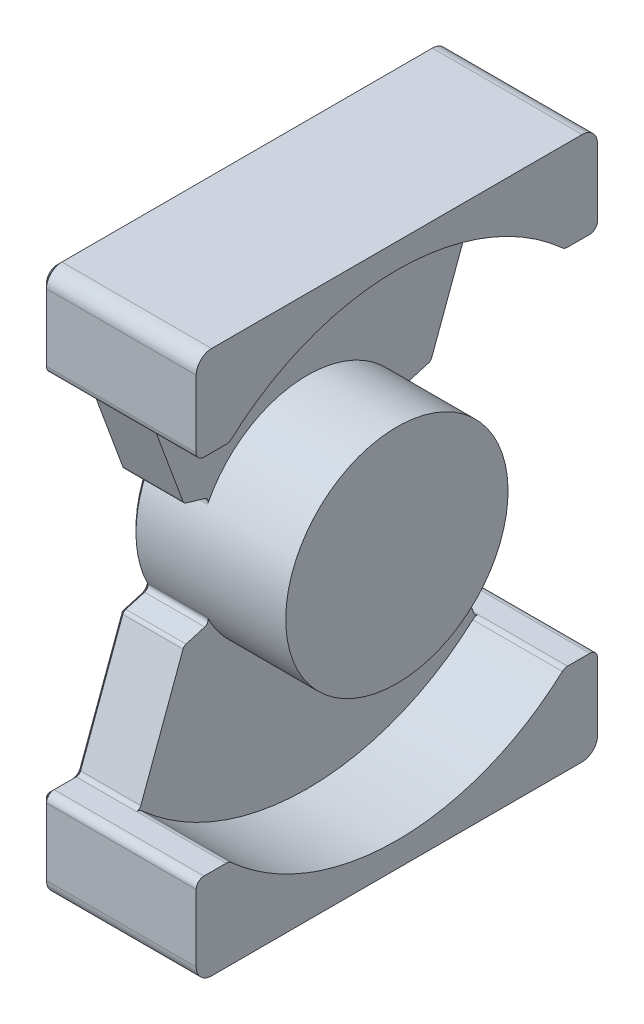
ISO-10303-21;
HEADER;
FILE_DESCRIPTION(('STEP AP214'),'2;1');
FILE_NAME('part.step','',(''),(''),'','','');
FILE_SCHEMA(('AUTOMOTIVE_DESIGN { 1 0 10303 214 1 1 1 1 }'));
ENDSEC;
DATA;
#1=APPLICATION_CONTEXT('core data for automotive mechanical design processes');
#2=APPLICATION_PROTOCOL_DEFINITION('international standard','automotive_design',2000,#1);
#3=PRODUCT_CONTEXT('',#1,'mechanical');
#4=PRODUCT('Part','Part','',(#3));
#5=PRODUCT_RELATED_PRODUCT_CATEGORY('part','',(#4));
#6=PRODUCT_DEFINITION_FORMATION('','',#4);
#7=PRODUCT_DEFINITION_CONTEXT('part definition',#1,'design');
#8=PRODUCT_DEFINITION('design','',#6,#7);
#9=PRODUCT_DEFINITION_SHAPE('','',#8);
#10=(LENGTH_UNIT() NAMED_UNIT(*) SI_UNIT(.MILLI.,.METRE.));
#11=(NAMED_UNIT(*) PLANE_ANGLE_UNIT() SI_UNIT($,.RADIAN.));
#12=(NAMED_UNIT(*) SI_UNIT($,.STERADIAN.) SOLID_ANGLE_UNIT());
#13=UNCERTAINTY_MEASURE_WITH_UNIT(LENGTH_MEASURE(1.E-05),#10,'distance_accuracy_value','');
#14=(GEOMETRIC_REPRESENTATION_CONTEXT(3) GLOBAL_UNCERTAINTY_ASSIGNED_CONTEXT((#13)) GLOBAL_UNIT_ASSIGNED_CONTEXT((#10,
#11,#12)) REPRESENTATION_CONTEXT('',''));
#15=CARTESIAN_POINT('',(0.,0.,0.));
#16=DIRECTION('',(0.,0.,1.));
#17=DIRECTION('',(1.,0.,0.));
#18=AXIS2_PLACEMENT_3D('',#15,#16,#17);
#19=CARTESIAN_POINT('',(47.26110984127,-19.,29.953845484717));
#20=DIRECTION('',(-1.,0.,0.));
#21=DIRECTION('',(0.,-1.,0.));
#22=AXIS2_PLACEMENT_3D('',#19,#20,#21);
#23=CYLINDRICAL_SURFACE('',#22,0.5);
#24=CARTESIAN_POINT('',(-1.35,-19.,29.953845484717));
#25=DIRECTION('',(1.,0.,0.));
#26=DIRECTION('',(0.,0.742424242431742,-0.669930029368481));
#27=AXIS2_PLACEMENT_3D('',#24,#25,#26);
#28=CIRCLE('',#27,0.499999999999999);
#29=CARTESIAN_POINT('',(-1.35,-18.6287878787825,29.6188804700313));
#30=VERTEX_POINT('',#29);
#31=CARTESIAN_POINT('',(-1.35,-18.4998135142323,29.9538543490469));
#32=VERTEX_POINT('',#31);
#33=EDGE_CURVE('E1041',#30,#32,#28,.T.);
#34=ORIENTED_EDGE('',*,*,#33,.T.);
#35=DIRECTION('',(-1.,0.,0.));
#36=VECTOR('',#35,1.);
#37=CARTESIAN_POINT('',(39.339196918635,-18.5,29.953845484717));
#38=LINE('',#37,#36);
#39=CARTESIAN_POINT('',(4.45,-18.5,29.953845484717));
#40=VERTEX_POINT('',#39);
#41=EDGE_CURVE('E804',#40,#32,#38,.T.);
#42=ORIENTED_EDGE('',*,*,#41,.F.);
#43=CARTESIAN_POINT('',(4.45,-19.,29.953845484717));
#44=DIRECTION('',(-1.,0.,0.));
#45=DIRECTION('',(0.,1.,0.));
#46=AXIS2_PLACEMENT_3D('',#43,#44,#45);
#47=CIRCLE('',#46,0.5);
#48=CARTESIAN_POINT('',(4.45,-18.6287878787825,29.6188804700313));
#49=VERTEX_POINT('',#48);
#50=EDGE_CURVE('E384',#40,#49,#47,.T.);
#51=ORIENTED_EDGE('',*,*,#50,.T.);
#52=DIRECTION('',(-1.,0.,0.));
#53=VECTOR('',#52,1.);
#54=CARTESIAN_POINT('',(47.26110984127,-18.6287878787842,29.6188804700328));
#55=LINE('',#54,#53);
#56=EDGE_CURVE('E1793',#49,#30,#55,.T.);
#57=ORIENTED_EDGE('',*,*,#56,.T.);
#58=EDGE_LOOP('',(#34,#42,#51,#57));
#59=FACE_BOUND('',#58,.T.);
#60=ADVANCED_FACE('F17',(#59),#23,.T.);
#61=CARTESIAN_POINT('',(47.26110984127,-19.,7.846154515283));
#62=DIRECTION('',(-1.,0.,0.));
#63=DIRECTION('',(0.,-1.,0.));
#64=AXIS2_PLACEMENT_3D('',#61,#62,#63);
#65=CYLINDRICAL_SURFACE('',#64,0.5);
#66=CARTESIAN_POINT('',(-1.35,-19.,7.84615451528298));
#67=DIRECTION('',(1.,0.,0.));
#68=DIRECTION('',(0.,1.,0.));
#69=AXIS2_PLACEMENT_3D('',#66,#67,#68);
#70=CIRCLE('',#69,0.499999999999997);
#71=CARTESIAN_POINT('',(-1.34999999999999,-18.4998146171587,7.84614587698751));
#72=VERTEX_POINT('',#71);
#73=CARTESIAN_POINT('',(-1.34999999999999,-18.6287878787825,8.18111952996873));
#74=VERTEX_POINT('',#73);
#75=EDGE_CURVE('E1020',#72,#74,#70,.T.);
#76=ORIENTED_EDGE('',*,*,#75,.T.);
#77=DIRECTION('',(-1.,0.,0.));
#78=VECTOR('',#77,1.);
#79=CARTESIAN_POINT('',(47.26110984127,-18.6287878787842,8.18111952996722));
#80=LINE('',#79,#78);
#81=CARTESIAN_POINT('',(4.45,-18.6287878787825,8.18111952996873));
#82=VERTEX_POINT('',#81);
#83=EDGE_CURVE('E3565',#74,#82,#80,.F.);
#84=ORIENTED_EDGE('',*,*,#83,.T.);
#85=CARTESIAN_POINT('',(4.45,-19.,7.84615451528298));
#86=DIRECTION('',(-1.,0.,0.));
#87=DIRECTION('',(0.,0.742424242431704,0.669930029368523));
#88=AXIS2_PLACEMENT_3D('',#85,#86,#87);
#89=CIRCLE('',#88,0.500000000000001);
#90=CARTESIAN_POINT('',(4.45,-18.5,7.846154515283));
#91=VERTEX_POINT('',#90);
#92=EDGE_CURVE('E1031',#82,#91,#89,.T.);
#93=ORIENTED_EDGE('',*,*,#92,.T.);
#94=DIRECTION('',(1.,0.,0.));
#95=VECTOR('',#94,1.);
#96=CARTESIAN_POINT('',(39.339196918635,-18.5,7.846154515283));
#97=LINE('',#96,#95);
#98=EDGE_CURVE('E833',#91,#72,#97,.F.);
#99=ORIENTED_EDGE('',*,*,#98,.T.);
#100=EDGE_LOOP('',(#76,#84,#93,#99));
#101=FACE_BOUND('',#100,.T.);
#102=ADVANCED_FACE('F1005',(#101),#65,.T.);
#103=CARTESIAN_POINT('',(47.26110984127,5.5,7.846154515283));
#104=DIRECTION('',(-1.,0.,0.));
#105=DIRECTION('',(0.,-1.,0.));
#106=AXIS2_PLACEMENT_3D('',#103,#104,#105);
#107=CYLINDRICAL_SURFACE('',#106,0.5);
#108=CARTESIAN_POINT('',(-1.35,5.49999999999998,7.84615451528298));
#109=DIRECTION('',(1.,0.,0.));
#110=DIRECTION('',(0.,-0.742424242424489,0.669930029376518));
#111=AXIS2_PLACEMENT_3D('',#108,#109,#110);
#112=CIRCLE('',#111,0.499999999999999);
#113=CARTESIAN_POINT('',(-1.35,5.12878787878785,8.18111952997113));
#114=VERTEX_POINT('',#113);
#115=CARTESIAN_POINT('',(-1.35,4.99981351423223,7.84614565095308));
#116=VERTEX_POINT('',#115);
#117=EDGE_CURVE('E346',#114,#116,#112,.T.);
#118=ORIENTED_EDGE('',*,*,#117,.T.);
#119=DIRECTION('',(-1.,0.,0.));
#120=VECTOR('',#119,1.);
#121=CARTESIAN_POINT('',(39.339196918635,5.,7.846154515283));
#122=LINE('',#121,#120);
#123=CARTESIAN_POINT('',(4.45,4.99999999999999,7.84615451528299));
#124=VERTEX_POINT('',#123);
#125=EDGE_CURVE('E936',#116,#124,#122,.F.);
#126=ORIENTED_EDGE('',*,*,#125,.T.);
#127=CARTESIAN_POINT('',(4.45,5.49999999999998,7.84615451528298));
#128=DIRECTION('',(-1.,0.,0.));
#129=DIRECTION('',(0.,-1.,0.));
#130=AXIS2_PLACEMENT_3D('',#127,#128,#129);
#131=CIRCLE('',#130,0.5);
#132=CARTESIAN_POINT('',(4.45000000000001,5.12878787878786,8.18111952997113));
#133=VERTEX_POINT('',#132);
#134=EDGE_CURVE('E2398',#124,#133,#131,.T.);
#135=ORIENTED_EDGE('',*,*,#134,.T.);
#136=DIRECTION('',(-1.,0.,0.));
#137=VECTOR('',#136,1.);
#138=CARTESIAN_POINT('',(47.26110984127,5.12878787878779,8.18111952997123));
#139=LINE('',#138,#137);
#140=EDGE_CURVE('E530',#133,#114,#139,.T.);
#141=ORIENTED_EDGE('',*,*,#140,.T.);
#142=EDGE_LOOP('',(#118,#126,#135,#141));
#143=FACE_BOUND('',#142,.T.);
#144=ADVANCED_FACE('F997',(#143),#107,.T.);
#145=CARTESIAN_POINT('',(47.26110984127,5.5,29.953845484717));
#146=DIRECTION('',(-1.,0.,0.));
#147=DIRECTION('',(0.,-1.,0.));
#148=AXIS2_PLACEMENT_3D('',#145,#146,#147);
#149=CYLINDRICAL_SURFACE('',#148,0.5);
#150=CARTESIAN_POINT('',(-1.35,5.49999999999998,29.953845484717));
#151=DIRECTION('',(1.,0.,0.));
#152=DIRECTION('',(0.,-1.,0.));
#153=AXIS2_PLACEMENT_3D('',#150,#151,#152);
#154=CIRCLE('',#153,0.5);
#155=CARTESIAN_POINT('',(-1.35,4.99973680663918,29.9538577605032));
#156=VERTEX_POINT('',#155);
#157=CARTESIAN_POINT('',(-1.35000000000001,5.12878787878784,29.6188804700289));
#158=VERTEX_POINT('',#157);
#159=EDGE_CURVE('E519',#156,#158,#154,.T.);
#160=ORIENTED_EDGE('',*,*,#159,.T.);
#161=DIRECTION('',(-1.,0.,0.));
#162=VECTOR('',#161,1.);
#163=CARTESIAN_POINT('',(47.26110984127,5.12878787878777,29.6188804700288));
#164=LINE('',#163,#162);
#165=CARTESIAN_POINT('',(4.45,5.12878787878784,29.6188804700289));
#166=VERTEX_POINT('',#165);
#167=EDGE_CURVE('E523',#158,#166,#164,.F.);
#168=ORIENTED_EDGE('',*,*,#167,.T.);
#169=CARTESIAN_POINT('',(4.45,5.49999999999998,29.953845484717));
#170=DIRECTION('',(-1.,0.,0.));
#171=DIRECTION('',(0.,-0.742424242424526,-0.669930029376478));
#172=AXIS2_PLACEMENT_3D('',#169,#170,#171);
#173=CIRCLE('',#172,0.500000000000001);
#174=CARTESIAN_POINT('',(4.45,4.99999999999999,29.953845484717));
#175=VERTEX_POINT('',#174);
#176=EDGE_CURVE('E506',#166,#175,#173,.T.);
#177=ORIENTED_EDGE('',*,*,#176,.T.);
#178=DIRECTION('',(1.,0.,0.));
#179=VECTOR('',#178,1.);
#180=CARTESIAN_POINT('',(39.339196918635,5.,29.953845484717));
#181=LINE('',#180,#179);
#182=EDGE_CURVE('E1303',#156,#175,#181,.T.);
#183=ORIENTED_EDGE('',*,*,#182,.F.);
#184=EDGE_LOOP('',(#160,#168,#177,#183));
#185=FACE_BOUND('',#184,.T.);
#186=ADVANCED_FACE('F524',(#185),#149,.T.);
#187=CARTESIAN_POINT('',(39.339196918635,5.,5.9));
#188=DIRECTION('',(0.,1.,0.));
#189=DIRECTION('',(-1.,0.,0.));
#190=AXIS2_PLACEMENT_3D('',#187,#188,#189);
#191=PLANE('',#190);
#192=DIRECTION('',(0.,0.,1.));
#193=VECTOR('',#192,1.);
#194=CARTESIAN_POINT('',(-5.25,4.99999999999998,5.9));
#195=LINE('',#194,#193);
#196=CARTESIAN_POINT('',(-5.25,4.99999999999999,6.4));
#197=VERTEX_POINT('',#196);
#198=CARTESIAN_POINT('',(-5.25,4.99999999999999,7.83102800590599));
#199=VERTEX_POINT('',#198);
#200=EDGE_CURVE('E834',#197,#199,#195,.T.);
#201=ORIENTED_EDGE('',*,*,#200,.F.);
#202=DIRECTION('',(-1.,0.,0.));
#203=VECTOR('',#202,1.);
#204=CARTESIAN_POINT('',(4.45,5.,6.4));
#205=LINE('',#204,#203);
#206=CARTESIAN_POINT('',(4.45,4.99999999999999,6.4));
#207=VERTEX_POINT('',#206);
#208=EDGE_CURVE('E1315',#207,#197,#205,.T.);
#209=ORIENTED_EDGE('',*,*,#208,.F.);
#210=DIRECTION('',(0.,0.,1.));
#211=VECTOR('',#210,1.);
#212=CARTESIAN_POINT('',(4.45,4.99999999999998,5.9));
#213=LINE('',#212,#211);
#214=EDGE_CURVE('E944',#124,#207,#213,.F.);
#215=ORIENTED_EDGE('',*,*,#214,.F.);
#216=ORIENTED_EDGE('',*,*,#125,.F.);
#217=CARTESIAN_POINT('',(-1.35,4.99999999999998,7.846154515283));
#218=DIRECTION('',(0.,0.,-1.));
#219=VECTOR('',#218,1.);
#220=LINE('',#217,#219);
#221=CARTESIAN_POINT('',(-1.35,4.99999999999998,7.83102800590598));
#222=VERTEX_POINT('',#221);
#223=EDGE_CURVE('E1322',#116,#222,#220,.T.);
#224=ORIENTED_EDGE('',*,*,#223,.T.);
#225=DIRECTION('',(1.,0.,0.));
#226=VECTOR('',#225,1.);
#227=CARTESIAN_POINT('',(39.339196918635,5.,7.831028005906));
#228=LINE('',#227,#226);
#229=EDGE_CURVE('E2372',#222,#199,#228,.F.);
#230=ORIENTED_EDGE('',*,*,#229,.T.);
#231=EDGE_LOOP('',(#201,#209,#215,#216,#224,#230));
#232=FACE_BOUND('',#231,.T.);
#233=ADVANCED_FACE('F920',(#232),#191,.F.);
#234=CARTESIAN_POINT('',(39.339196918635,-18.5,5.9));
#235=DIRECTION('',(0.,-1.,0.));
#236=DIRECTION('',(1.,0.,0.));
#237=AXIS2_PLACEMENT_3D('',#234,#235,#236);
#238=PLANE('',#237);
#239=DIRECTION('',(0.,0.,1.));
#240=VECTOR('',#239,1.);
#241=CARTESIAN_POINT('',(-5.25,-18.5,5.9));
#242=LINE('',#241,#240);
#243=CARTESIAN_POINT('',(-5.25,-18.5,7.831028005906));
#244=VERTEX_POINT('',#243);
#245=CARTESIAN_POINT('',(-5.25,-18.5,6.4));
#246=VERTEX_POINT('',#245);
#247=EDGE_CURVE('E837',#244,#246,#242,.F.);
#248=ORIENTED_EDGE('',*,*,#247,.F.);
#249=DIRECTION('',(1.,0.,0.));
#250=VECTOR('',#249,1.);
#251=CARTESIAN_POINT('',(39.339196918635,-18.5,7.83102800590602));
#252=LINE('',#251,#250);
#253=CARTESIAN_POINT('',(-1.35,-18.5,7.831028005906));
#254=VERTEX_POINT('',#253);
#255=EDGE_CURVE('E866',#244,#254,#252,.T.);
#256=ORIENTED_EDGE('',*,*,#255,.T.);
#257=CARTESIAN_POINT('',(-1.35,-18.5,7.831028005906));
#258=DIRECTION('',(0.,0.,1.));
#259=VECTOR('',#258,1.);
#260=LINE('',#257,#259);
#261=EDGE_CURVE('E902',#254,#72,#260,.T.);
#262=ORIENTED_EDGE('',*,*,#261,.T.);
#263=ORIENTED_EDGE('',*,*,#98,.F.);
#264=DIRECTION('',(0.,0.,1.));
#265=VECTOR('',#264,1.);
#266=CARTESIAN_POINT('',(4.45,-18.5,5.9));
#267=LINE('',#266,#265);
#268=CARTESIAN_POINT('',(4.45,-18.5,6.4));
#269=VERTEX_POINT('',#268);
#270=EDGE_CURVE('E825',#269,#91,#267,.T.);
#271=ORIENTED_EDGE('',*,*,#270,.F.);
#272=DIRECTION('',(-1.,0.,0.));
#273=VECTOR('',#272,1.);
#274=CARTESIAN_POINT('',(39.339196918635,-18.5,6.40000000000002));
#275=LINE('',#274,#273);
#276=EDGE_CURVE('E1741',#246,#269,#275,.F.);
#277=ORIENTED_EDGE('',*,*,#276,.F.);
#278=EDGE_LOOP('',(#248,#256,#262,#263,#271,#277));
#279=FACE_BOUND('',#278,.T.);
#280=ADVANCED_FACE('F909',(#279),#238,.F.);
#281=CARTESIAN_POINT('',(39.339196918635,-18.5,31.9));
#282=DIRECTION('',(0.,1.,0.));
#283=DIRECTION('',(-1.,0.,0.));
#284=AXIS2_PLACEMENT_3D('',#281,#282,#283);
#285=PLANE('',#284);
#286=ORIENTED_EDGE('',*,*,#41,.T.);
#287=CARTESIAN_POINT('',(-1.35,-18.5,29.953845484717));
#288=DIRECTION('',(0.,0.,1.));
#289=VECTOR('',#288,1.);
#290=LINE('',#287,#289);
#291=CARTESIAN_POINT('',(-1.35,-18.5,29.968971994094));
#292=VERTEX_POINT('',#291);
#293=EDGE_CURVE('E952',#32,#292,#290,.T.);
#294=ORIENTED_EDGE('',*,*,#293,.T.);
#295=DIRECTION('',(1.,0.,0.));
#296=VECTOR('',#295,1.);
#297=CARTESIAN_POINT('',(39.339196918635,-18.5,29.968971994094));
#298=LINE('',#297,#296);
#299=CARTESIAN_POINT('',(-5.25,-18.5,29.968971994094));
#300=VERTEX_POINT('',#299);
#301=EDGE_CURVE('E1823',#292,#300,#298,.F.);
#302=ORIENTED_EDGE('',*,*,#301,.T.);
#303=DIRECTION('',(0.,0.,1.));
#304=VECTOR('',#303,1.);
#305=CARTESIAN_POINT('',(-5.25,-18.5,31.9));
#306=LINE('',#305,#304);
#307=CARTESIAN_POINT('',(-5.25,-18.5,31.4));
#308=VERTEX_POINT('',#307);
#309=EDGE_CURVE('E840',#300,#308,#306,.T.);
#310=ORIENTED_EDGE('',*,*,#309,.T.);
#311=DIRECTION('',(1.,0.,0.));
#312=VECTOR('',#311,1.);
#313=CARTESIAN_POINT('',(4.45,-18.5,31.4));
#314=LINE('',#313,#312);
#315=CARTESIAN_POINT('',(4.45,-18.5,31.4));
#316=VERTEX_POINT('',#315);
#317=EDGE_CURVE('E735',#316,#308,#314,.F.);
#318=ORIENTED_EDGE('',*,*,#317,.F.);
#319=DIRECTION('',(0.,0.,1.));
#320=VECTOR('',#319,1.);
#321=CARTESIAN_POINT('',(4.45000000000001,-18.5,18.9));
#322=LINE('',#321,#320);
#323=EDGE_CURVE('E396',#40,#316,#322,.T.);
#324=ORIENTED_EDGE('',*,*,#323,.F.);
#325=EDGE_LOOP('',(#286,#294,#302,#310,#318,#324));
#326=FACE_BOUND('',#325,.T.);
#327=ADVANCED_FACE('F919',(#326),#285,.T.);
#328=CARTESIAN_POINT('',(39.339196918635,-10.75,26.9));
#329=DIRECTION('',(0.,0.959720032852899,0.280958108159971));
#330=DIRECTION('',(0.,-0.280958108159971,0.959720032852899));
#331=AXIS2_PLACEMENT_3D('',#328,#329,#330);
#332=PLANE('',#331);
#333=DIRECTION('',(-1.,0.,0.));
#334=VECTOR('',#333,1.);
#335=CARTESIAN_POINT('',(39.339196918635,-10.7075824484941,26.7551066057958));
#336=LINE('',#335,#334);
#337=CARTESIAN_POINT('',(-1.35,-10.7075824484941,26.7551066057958));
#338=VERTEX_POINT('',#337);
#339=CARTESIAN_POINT('',(-5.25,-10.7075824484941,26.7551066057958));
#340=VERTEX_POINT('',#339);
#341=EDGE_CURVE('E695',#338,#340,#336,.T.);
#342=ORIENTED_EDGE('',*,*,#341,.F.);
#343=DIRECTION('',(0.,-0.280958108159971,0.959720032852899));
#344=VECTOR('',#343,1.);
#345=CARTESIAN_POINT('',(-1.35,-10.75,26.9));
#346=LINE('',#345,#344);
#347=CARTESIAN_POINT('',(-1.35,-10.3528438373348,25.5433610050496));
#348=VERTEX_POINT('',#347);
#349=EDGE_CURVE('E1786',#338,#348,#346,.F.);
#350=ORIENTED_EDGE('',*,*,#349,.T.);
#351=DIRECTION('',(-1.,0.,0.));
#352=VECTOR('',#351,1.);
#353=CARTESIAN_POINT('',(47.26110984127,-10.3528438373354,25.5433610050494));
#354=LINE('',#353,#352);
#355=CARTESIAN_POINT('',(-5.25,-10.3528438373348,25.5433610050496));
#356=VERTEX_POINT('',#355);
#357=EDGE_CURVE('E585',#348,#356,#354,.T.);
#358=ORIENTED_EDGE('',*,*,#357,.T.);
#359=DIRECTION('',(0.,-0.280958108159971,0.959720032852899));
#360=VECTOR('',#359,1.);
#361=CARTESIAN_POINT('',(-5.25,-10.75,26.9));
#362=LINE('',#361,#360);
#363=EDGE_CURVE('E1794',#356,#340,#362,.T.);
#364=ORIENTED_EDGE('',*,*,#363,.T.);
#365=EDGE_LOOP('',(#342,#350,#358,#364));
#366=FACE_BOUND('',#365,.T.);
#367=ADVANCED_FACE('F1718',(#366),#332,.T.);
#368=CARTESIAN_POINT('',(47.26110984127,-6.75,18.9));
#369=DIRECTION('',(-1.,0.,0.));
#370=DIRECTION('',(0.,-1.,0.));
#371=AXIS2_PLACEMENT_3D('',#368,#369,#370);
#372=CYLINDRICAL_SURFACE('',#371,16.);
#373=ORIENTED_EDGE('',*,*,#83,.F.);
#374=CARTESIAN_POINT('',(-1.35,-6.75000000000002,18.9));
#375=DIRECTION('',(-1.,0.,0.));
#376=DIRECTION('',(0.,-0.742424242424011,-0.669930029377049));
#377=AXIS2_PLACEMENT_3D('',#374,#375,#376);
#378=CIRCLE('',#377,16.);
#379=EDGE_CURVE('E1161',#74,#30,#378,.T.);
#380=ORIENTED_EDGE('',*,*,#379,.T.);
#381=ORIENTED_EDGE('',*,*,#56,.F.);
#382=CARTESIAN_POINT('',(4.45000000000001,-18.62878787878,8.181119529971));
#383=CARTESIAN_POINT('',(4.45000000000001,-19.5560896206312,9.20876609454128));
#384=CARTESIAN_POINT('',(4.45000000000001,-20.2934019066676,10.3808295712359));
#385=CARTESIAN_POINT('',(4.45000000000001,-21.069019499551,11.613784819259));
#386=CARTESIAN_POINT('',(4.45000000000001,-21.6095387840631,12.9675378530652));
#387=CARTESIAN_POINT('',(4.45000000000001,-22.1692775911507,14.369426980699));
#388=CARTESIAN_POINT('',(4.45000000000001,-22.4570543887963,15.8523053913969));
#389=CARTESIAN_POINT('',(4.45000000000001,-22.7499508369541,17.3615647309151));
#390=CARTESIAN_POINT('',(4.45000000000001,-22.7499999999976,18.9));
#391=CARTESIAN_POINT('',(4.45000000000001,-22.750049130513,20.4374173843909));
#392=CARTESIAN_POINT('',(4.45000000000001,-22.4570543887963,21.9476946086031));
#393=CARTESIAN_POINT('',(4.45000000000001,-22.1695697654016,23.4295692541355));
#394=CARTESIAN_POINT('',(4.45,-21.6095387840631,24.8324621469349));
#395=CARTESIAN_POINT('',(4.45,-21.0694974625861,26.1852803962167));
#396=CARTESIAN_POINT('',(4.45,-20.2934019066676,27.4191704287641));
#397=CARTESIAN_POINT('',(4.45,-19.5564347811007,28.590851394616));
#398=CARTESIAN_POINT('',(4.45,-18.62878787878,29.618880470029));
#399=B_SPLINE_CURVE_WITH_KNOTS('',2,(#382,#383,#384,#385,#386,#387,#388,#389,#390,#391,#392,
#393,#394,#395,#396,#397,#398),.UNSPECIFIED.,.F.,.F.,(3,2,2,2,2,2,2,2,3),(0.,0.125,0.25,0.375,
0.5,0.625,0.75,0.875,1.),.UNSPECIFIED.);
#400=EDGE_CURVE('E1218',#82,#49,#399,.T.);
#401=ORIENTED_EDGE('',*,*,#400,.F.);
#402=EDGE_LOOP('',(#373,#380,#381,#401));
#403=FACE_BOUND('',#402,.T.);
#404=ADVANCED_FACE('F1715',(#403),#372,.F.);
#405=CARTESIAN_POINT('',(39.339196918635,-10.75,10.9));
#406=DIRECTION('',(0.,-0.959720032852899,0.280958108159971));
#407=DIRECTION('',(0.,-0.280958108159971,-0.959720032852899));
#408=AXIS2_PLACEMENT_3D('',#405,#406,#407);
#409=PLANE('',#408);
#410=DIRECTION('',(0.,-0.280958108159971,-0.959720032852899));
#411=VECTOR('',#410,1.);
#412=CARTESIAN_POINT('',(-5.25,-10.75,10.9));
#413=LINE('',#412,#411);
#414=CARTESIAN_POINT('',(-5.25,-10.3528438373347,12.2566389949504));
#415=VERTEX_POINT('',#414);
#416=CARTESIAN_POINT('',(-5.25,-10.707582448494,11.0448933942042));
#417=VERTEX_POINT('',#416);
#418=EDGE_CURVE('E3573',#415,#417,#413,.T.);
#419=ORIENTED_EDGE('',*,*,#418,.F.);
#420=DIRECTION('',(-1.,0.,0.));
#421=VECTOR('',#420,1.);
#422=CARTESIAN_POINT('',(47.26110984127,-10.3528438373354,12.2566389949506));
#423=LINE('',#422,#421);
#424=CARTESIAN_POINT('',(-1.35,-10.3528438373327,12.2566389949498));
#425=VERTEX_POINT('',#424);
#426=EDGE_CURVE('E593',#415,#425,#423,.F.);
#427=ORIENTED_EDGE('',*,*,#426,.T.);
#428=DIRECTION('',(0.,-0.280958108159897,-0.959720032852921));
#429=VECTOR('',#428,1.);
#430=CARTESIAN_POINT('',(-1.35,-10.35284383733,12.256638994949));
#431=LINE('',#430,#429);
#432=CARTESIAN_POINT('',(-1.35,-10.7075824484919,11.0448933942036));
#433=VERTEX_POINT('',#432);
#434=EDGE_CURVE('E1164',#425,#433,#431,.T.);
#435=ORIENTED_EDGE('',*,*,#434,.T.);
#436=DIRECTION('',(-1.,0.,0.));
#437=VECTOR('',#436,1.);
#438=CARTESIAN_POINT('',(39.339196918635,-10.7075824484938,11.0448933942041));
#439=LINE('',#438,#437);
#440=EDGE_CURVE('E1752',#417,#433,#439,.F.);
#441=ORIENTED_EDGE('',*,*,#440,.F.);
#442=EDGE_LOOP('',(#419,#427,#435,#441));
#443=FACE_BOUND('',#442,.T.);
#444=ADVANCED_FACE('F1711',(#443),#409,.F.);
#445=CARTESIAN_POINT('',(39.339196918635,-2.75,10.9));
#446=DIRECTION('',(0.,0.959720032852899,0.280958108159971));
#447=DIRECTION('',(0.,-0.280958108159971,0.959720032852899));
#448=AXIS2_PLACEMENT_3D('',#445,#446,#447);
#449=PLANE('',#448);
#450=DIRECTION('',(0.,-0.280958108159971,0.959720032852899));
#451=VECTOR('',#450,1.);
#452=CARTESIAN_POINT('',(-5.25,-2.75000000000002,10.9));
#453=LINE('',#452,#451);
#454=CARTESIAN_POINT('',(-5.25,-2.79241755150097,11.044893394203));
#455=VERTEX_POINT('',#454);
#456=CARTESIAN_POINT('',(-5.25,-3.14715616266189,12.256638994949));
#457=VERTEX_POINT('',#456);
#458=EDGE_CURVE('E2265',#455,#457,#453,.T.);
#459=ORIENTED_EDGE('',*,*,#458,.F.);
#460=DIRECTION('',(-1.,0.,0.));
#461=VECTOR('',#460,1.);
#462=CARTESIAN_POINT('',(39.339196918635,-2.79241755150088,11.044893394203));
#463=LINE('',#462,#461);
#464=CARTESIAN_POINT('',(-1.35,-2.79241755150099,11.044893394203));
#465=VERTEX_POINT('',#464);
#466=EDGE_CURVE('E596',#465,#455,#463,.T.);
#467=ORIENTED_EDGE('',*,*,#466,.F.);
#468=DIRECTION('',(0.,-0.280958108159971,0.959720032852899));
#469=VECTOR('',#468,1.);
#470=CARTESIAN_POINT('',(-1.35,-2.75000000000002,10.9));
#471=LINE('',#470,#469);
#472=CARTESIAN_POINT('',(-1.35,-3.14715616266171,12.2566389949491));
#473=VERTEX_POINT('',#472);
#474=EDGE_CURVE('E338',#473,#465,#471,.F.);
#475=ORIENTED_EDGE('',*,*,#474,.F.);
#476=DIRECTION('',(-1.,0.,0.));
#477=VECTOR('',#476,1.);
#478=CARTESIAN_POINT('',(47.26110984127,-3.14715616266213,12.256638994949));
#479=LINE('',#478,#477);
#480=EDGE_CURVE('E589',#473,#457,#479,.T.);
#481=ORIENTED_EDGE('',*,*,#480,.T.);
#482=EDGE_LOOP('',(#459,#467,#475,#481));
#483=FACE_BOUND('',#482,.T.);
#484=ADVANCED_FACE('F1707',(#483),#449,.F.);
#485=CARTESIAN_POINT('',(39.339196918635,-2.75,26.9));
#486=DIRECTION('',(0.,-0.959720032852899,0.280958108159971));
#487=DIRECTION('',(0.,-0.280958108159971,-0.959720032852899));
#488=AXIS2_PLACEMENT_3D('',#485,#486,#487);
#489=PLANE('',#488);
#490=DIRECTION('',(-1.,0.,0.));
#491=VECTOR('',#490,1.);
#492=CARTESIAN_POINT('',(47.26110984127,-3.14715616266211,25.5433610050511));
#493=LINE('',#492,#491);
#494=CARTESIAN_POINT('',(-5.25,-3.14715616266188,25.543361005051));
#495=VERTEX_POINT('',#494);
#496=CARTESIAN_POINT('',(-1.35,-3.1471561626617,25.5433610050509));
#497=VERTEX_POINT('',#496);
#498=EDGE_CURVE('E582',#495,#497,#493,.F.);
#499=ORIENTED_EDGE('',*,*,#498,.T.);
#500=DIRECTION('',(0.,-0.280958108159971,-0.959720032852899));
#501=VECTOR('',#500,1.);
#502=CARTESIAN_POINT('',(-1.35,-2.75000000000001,26.9));
#503=LINE('',#502,#501);
#504=CARTESIAN_POINT('',(-1.35,-2.79241755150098,26.7551066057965));
#505=VERTEX_POINT('',#504);
#506=EDGE_CURVE('E1309',#497,#505,#503,.F.);
#507=ORIENTED_EDGE('',*,*,#506,.T.);
#508=DIRECTION('',(-1.,0.,0.));
#509=VECTOR('',#508,1.);
#510=CARTESIAN_POINT('',(39.339196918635,-2.7924175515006,26.7551066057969));
#511=LINE('',#510,#509);
#512=CARTESIAN_POINT('',(-5.25,-2.79241755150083,26.7551066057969));
#513=VERTEX_POINT('',#512);
#514=EDGE_CURVE('E568',#513,#505,#511,.F.);
#515=ORIENTED_EDGE('',*,*,#514,.F.);
#516=DIRECTION('',(0.,-0.280958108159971,-0.959720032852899));
#517=VECTOR('',#516,1.);
#518=CARTESIAN_POINT('',(-5.25,-2.75000000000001,26.9));
#519=LINE('',#518,#517);
#520=EDGE_CURVE('E3581',#513,#495,#519,.T.);
#521=ORIENTED_EDGE('',*,*,#520,.T.);
#522=EDGE_LOOP('',(#499,#507,#515,#521));
#523=FACE_BOUND('',#522,.T.);
#524=ADVANCED_FACE('F1704',(#523),#489,.T.);
#525=CARTESIAN_POINT('',(47.26110984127,-6.75,18.9));
#526=DIRECTION('',(-1.,0.,0.));
#527=DIRECTION('',(0.,-1.,0.));
#528=AXIS2_PLACEMENT_3D('',#525,#526,#527);
#529=CYLINDRICAL_SURFACE('',#528,16.);
#530=ORIENTED_EDGE('',*,*,#167,.F.);
#531=CARTESIAN_POINT('',(-1.35,-6.75000000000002,18.9));
#532=DIRECTION('',(-1.,0.,0.));
#533=DIRECTION('',(0.,-1.,0.));
#534=AXIS2_PLACEMENT_3D('',#531,#532,#533);
#535=CIRCLE('',#534,16.);
#536=EDGE_CURVE('E562',#158,#114,#535,.T.);
#537=ORIENTED_EDGE('',*,*,#536,.T.);
#538=ORIENTED_EDGE('',*,*,#140,.F.);
#539=CARTESIAN_POINT('',(4.45000000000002,-6.75000000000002,18.9));
#540=DIRECTION('',(-1.,0.,0.));
#541=DIRECTION('',(0.,-1.,0.));
#542=AXIS2_PLACEMENT_3D('',#539,#540,#541);
#543=CIRCLE('',#542,16.);
#544=EDGE_CURVE('E511',#166,#133,#543,.T.);
#545=ORIENTED_EDGE('',*,*,#544,.F.);
#546=EDGE_LOOP('',(#530,#537,#538,#545));
#547=FACE_BOUND('',#546,.T.);
#548=ADVANCED_FACE('F533',(#547),#529,.F.);
#549=CARTESIAN_POINT('',(39.339196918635,5.,31.9));
#550=DIRECTION('',(0.,-1.,0.));
#551=DIRECTION('',(1.,0.,0.));
#552=AXIS2_PLACEMENT_3D('',#549,#550,#551);
#553=PLANE('',#552);
#554=ORIENTED_EDGE('',*,*,#182,.T.);
#555=DIRECTION('',(0.,0.,1.));
#556=VECTOR('',#555,1.);
#557=CARTESIAN_POINT('',(4.44999999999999,5.,18.9));
#558=LINE('',#557,#556);
#559=CARTESIAN_POINT('',(4.45,4.99999999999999,31.4));
#560=VERTEX_POINT('',#559);
#561=EDGE_CURVE('E514',#560,#175,#558,.F.);
#562=ORIENTED_EDGE('',*,*,#561,.F.);
#563=DIRECTION('',(1.,0.,0.));
#564=VECTOR('',#563,1.);
#565=CARTESIAN_POINT('',(39.339196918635,5.,31.4));
#566=LINE('',#565,#564);
#567=CARTESIAN_POINT('',(-5.25,4.99999999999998,31.4));
#568=VERTEX_POINT('',#567);
#569=EDGE_CURVE('E536',#568,#560,#566,.T.);
#570=ORIENTED_EDGE('',*,*,#569,.F.);
#571=DIRECTION('',(0.,0.,1.));
#572=VECTOR('',#571,1.);
#573=CARTESIAN_POINT('',(-5.25,4.99999999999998,31.9));
#574=LINE('',#573,#572);
#575=CARTESIAN_POINT('',(-5.25,4.99999999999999,29.968971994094));
#576=VERTEX_POINT('',#575);
#577=EDGE_CURVE('E529',#568,#576,#574,.F.);
#578=ORIENTED_EDGE('',*,*,#577,.T.);
#579=DIRECTION('',(1.,0.,0.));
#580=VECTOR('',#579,1.);
#581=CARTESIAN_POINT('',(39.339196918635,5.,29.968971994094));
#582=LINE('',#581,#580);
#583=CARTESIAN_POINT('',(-1.35,4.99999999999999,29.968971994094));
#584=VERTEX_POINT('',#583);
#585=EDGE_CURVE('E575',#576,#584,#582,.T.);
#586=ORIENTED_EDGE('',*,*,#585,.T.);
#587=CARTESIAN_POINT('',(-1.35000000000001,4.99999999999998,29.968971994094));
#588=DIRECTION('',(0.,0.,-1.));
#589=VECTOR('',#588,1.);
#590=LINE('',#587,#589);
#591=EDGE_CURVE('E564',#584,#156,#590,.T.);
#592=ORIENTED_EDGE('',*,*,#591,.T.);
#593=EDGE_LOOP('',(#554,#562,#570,#578,#586,#592));
#594=FACE_BOUND('',#593,.T.);
#595=ADVANCED_FACE('F1690',(#594),#553,.T.);
#596=CARTESIAN_POINT('',(4.45,9.85,6.9));
#597=DIRECTION('',(-1.,0.,0.));
#598=DIRECTION('',(0.,-1.,0.));
#599=AXIS2_PLACEMENT_3D('',#596,#597,#598);
#600=CYLINDRICAL_SURFACE('',#599,1.);
#601=DIRECTION('',(1.,0.,0.));
#602=VECTOR('',#601,1.);
#603=CARTESIAN_POINT('',(4.45,10.85,6.9));
#604=LINE('',#603,#602);
#605=CARTESIAN_POINT('',(-5.25,10.85,6.9));
#606=VERTEX_POINT('',#605);
#607=CARTESIAN_POINT('',(4.45,10.85,6.9));
#608=VERTEX_POINT('',#607);
#609=EDGE_CURVE('E1294',#606,#608,#604,.T.);
#610=ORIENTED_EDGE('',*,*,#609,.T.);
#611=CARTESIAN_POINT('',(4.45,9.85,6.9));
#612=DIRECTION('',(-1.,0.,0.));
#613=DIRECTION('',(0.,-1.,0.));
#614=AXIS2_PLACEMENT_3D('',#611,#612,#613);
#615=CIRCLE('',#614,1.);
#616=CARTESIAN_POINT('',(4.45,9.85,5.89999999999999));
#617=VERTEX_POINT('',#616);
#618=EDGE_CURVE('E538',#617,#608,#615,.F.);
#619=ORIENTED_EDGE('',*,*,#618,.F.);
#620=DIRECTION('',(1.,0.,0.));
#621=VECTOR('',#620,1.);
#622=CARTESIAN_POINT('',(4.45,9.85,5.89999999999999));
#623=LINE('',#622,#621);
#624=CARTESIAN_POINT('',(-5.25,9.85,5.9));
#625=VERTEX_POINT('',#624);
#626=EDGE_CURVE('E1293',#617,#625,#623,.F.);
#627=ORIENTED_EDGE('',*,*,#626,.T.);
#628=CARTESIAN_POINT('',(-5.25,9.84999999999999,6.9));
#629=DIRECTION('',(1.,0.,0.));
#630=DIRECTION('',(0.,0.,-1.));
#631=AXIS2_PLACEMENT_3D('',#628,#629,#630);
#632=CIRCLE('',#631,1.);
#633=EDGE_CURVE('E1313',#625,#606,#632,.T.);
#634=ORIENTED_EDGE('',*,*,#633,.T.);
#635=EDGE_LOOP('',(#610,#619,#627,#634));
#636=FACE_BOUND('',#635,.T.);
#637=ADVANCED_FACE('F1328',(#636),#600,.T.);
#638=CARTESIAN_POINT('',(4.45,5.5,6.4));
#639=DIRECTION('',(-1.,0.,0.));
#640=DIRECTION('',(0.,-1.,0.));
#641=AXIS2_PLACEMENT_3D('',#638,#639,#640);
#642=CYLINDRICAL_SURFACE('',#641,0.5);
#643=DIRECTION('',(1.,0.,0.));
#644=VECTOR('',#643,1.);
#645=CARTESIAN_POINT('',(4.45,5.5,5.89999999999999));
#646=LINE('',#645,#644);
#647=CARTESIAN_POINT('',(-5.25,5.5,5.9));
#648=VERTEX_POINT('',#647);
#649=CARTESIAN_POINT('',(4.45,5.5,5.89999999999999));
#650=VERTEX_POINT('',#649);
#651=EDGE_CURVE('E1289',#648,#650,#646,.T.);
#652=ORIENTED_EDGE('',*,*,#651,.T.);
#653=CARTESIAN_POINT('',(4.45,5.5,6.4));
#654=DIRECTION('',(-1.,0.,0.));
#655=DIRECTION('',(0.,-1.,0.));
#656=AXIS2_PLACEMENT_3D('',#653,#654,#655);
#657=CIRCLE('',#656,0.5);
#658=EDGE_CURVE('E545',#207,#650,#657,.F.);
#659=ORIENTED_EDGE('',*,*,#658,.F.);
#660=ORIENTED_EDGE('',*,*,#208,.T.);
#661=CARTESIAN_POINT('',(-5.25,5.5,6.4));
#662=DIRECTION('',(1.,0.,0.));
#663=DIRECTION('',(0.,-1.,0.));
#664=AXIS2_PLACEMENT_3D('',#661,#662,#663);
#665=CIRCLE('',#664,0.5);
#666=EDGE_CURVE('E1317',#197,#648,#665,.T.);
#667=ORIENTED_EDGE('',*,*,#666,.T.);
#668=EDGE_LOOP('',(#652,#659,#660,#667));
#669=FACE_BOUND('',#668,.T.);
#670=ADVANCED_FACE('F2362',(#669),#642,.T.);
#671=CARTESIAN_POINT('',(39.339196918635,4.7,7.831028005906));
#672=DIRECTION('',(1.,0.,0.));
#673=DIRECTION('',(0.,1.,0.));
#674=AXIS2_PLACEMENT_3D('',#671,#672,#673);
#675=CYLINDRICAL_SURFACE('',#674,0.3);
#676=CARTESIAN_POINT('',(-5.25,5.,7.831028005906));
#677=CARTESIAN_POINT('',(-5.25,5.,7.92465761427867));
#678=CARTESIAN_POINT('',(-5.25,4.94612800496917,8.00255352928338));
#679=CARTESIAN_POINT('',(-5.25,4.89280674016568,8.07965311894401));
#680=CARTESIAN_POINT('',(-5.25,4.803859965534,8.112476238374));
#681=B_SPLINE_CURVE_WITH_KNOTS('',2,(#676,#677,#678,#679,#680),.UNSPECIFIED.,.F.,.F.,(3,2,3),
(0.,0.5,1.),.UNSPECIFIED.);
#682=CARTESIAN_POINT('',(-5.25,4.80385996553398,8.11247623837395));
#683=VERTEX_POINT('',#682);
#684=EDGE_CURVE('E600',#199,#683,#681,.T.);
#685=ORIENTED_EDGE('',*,*,#684,.F.);
#686=ORIENTED_EDGE('',*,*,#229,.F.);
#687=ORIENTED_EDGE('',*,*,#223,.F.);
#688=CARTESIAN_POINT('',(-1.35,4.69999999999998,7.83102800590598));
#689=DIRECTION('',(1.,0.,0.));
#690=DIRECTION('',(0.,1.,0.));
#691=AXIS2_PLACEMENT_3D('',#688,#689,#690);
#692=CIRCLE('',#691,0.3);
#693=CARTESIAN_POINT('',(-1.35,4.80385996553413,8.1124762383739));
#694=VERTEX_POINT('',#693);
#695=EDGE_CURVE('E559',#116,#694,#692,.T.);
#696=ORIENTED_EDGE('',*,*,#695,.T.);
#697=DIRECTION('',(1.,0.,0.));
#698=VECTOR('',#697,1.);
#699=CARTESIAN_POINT('',(39.339196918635,4.80385996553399,8.11247623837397));
#700=LINE('',#699,#698);
#701=EDGE_CURVE('E1288',#694,#683,#700,.F.);
#702=ORIENTED_EDGE('',*,*,#701,.T.);
#703=EDGE_LOOP('',(#685,#686,#687,#696,#702));
#704=FACE_BOUND('',#703,.T.);
#705=ADVANCED_FACE('F2359',(#704),#675,.F.);
#706=CARTESIAN_POINT('',(39.339196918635,-2.504501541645,11.129180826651));
#707=DIRECTION('',(-1.,0.,0.));
#708=DIRECTION('',(0.,-1.,0.));
#709=AXIS2_PLACEMENT_3D('',#706,#707,#708);
#710=CYLINDRICAL_SURFACE('',#709,0.3);
#711=DIRECTION('',(1.,0.,0.));
#712=VECTOR('',#711,1.);
#713=CARTESIAN_POINT('',(39.339196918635,-2.60836150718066,10.8477325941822));
#714=LINE('',#713,#712);
#715=CARTESIAN_POINT('',(-5.25,-2.60836150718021,10.8477325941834));
#716=VERTEX_POINT('',#715);
#717=CARTESIAN_POINT('',(-1.35,-2.60836150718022,10.847732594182));
#718=VERTEX_POINT('',#717);
#719=EDGE_CURVE('E1282',#716,#718,#714,.T.);
#720=ORIENTED_EDGE('',*,*,#719,.T.);
#721=CARTESIAN_POINT('',(-1.35,-2.50450154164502,11.129180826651));
#722=DIRECTION('',(-1.,0.,0.));
#723=DIRECTION('',(0.,-1.,0.));
#724=AXIS2_PLACEMENT_3D('',#721,#722,#723);
#725=CIRCLE('',#724,0.3);
#726=EDGE_CURVE('E556',#718,#465,#725,.T.);
#727=ORIENTED_EDGE('',*,*,#726,.T.);
#728=ORIENTED_EDGE('',*,*,#466,.T.);
#729=CARTESIAN_POINT('',(-5.25,-2.50450154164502,11.129180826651));
#730=DIRECTION('',(1.,0.,0.));
#731=DIRECTION('',(0.,-0.959720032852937,-0.280958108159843));
#732=AXIS2_PLACEMENT_3D('',#729,#730,#731);
#733=CIRCLE('',#732,0.3);
#734=EDGE_CURVE('E599',#455,#716,#733,.T.);
#735=ORIENTED_EDGE('',*,*,#734,.T.);
#736=EDGE_LOOP('',(#720,#727,#728,#735));
#737=FACE_BOUND('',#736,.T.);
#738=ADVANCED_FACE('F2340',(#737),#710,.T.);
#739=CARTESIAN_POINT('',(39.339196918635,-10.99549845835,11.129180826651));
#740=DIRECTION('',(-1.,0.,0.));
#741=DIRECTION('',(0.,-1.,0.));
#742=AXIS2_PLACEMENT_3D('',#739,#740,#741);
#743=CYLINDRICAL_SURFACE('',#742,0.3);
#744=ORIENTED_EDGE('',*,*,#440,.T.);
#745=CARTESIAN_POINT('',(-1.35,-10.99549845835,11.129180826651));
#746=DIRECTION('',(-1.,0.,0.));
#747=DIRECTION('',(0.,0.959720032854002,-0.280958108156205));
#748=AXIS2_PLACEMENT_3D('',#745,#746,#747);
#749=CIRCLE('',#748,0.300000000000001);
#750=CARTESIAN_POINT('',(-1.35,-10.8916384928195,10.8477325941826));
#751=VERTEX_POINT('',#750);
#752=EDGE_CURVE('E1133',#433,#751,#749,.T.);
#753=ORIENTED_EDGE('',*,*,#752,.T.);
#754=DIRECTION('',(1.,0.,0.));
#755=VECTOR('',#754,1.);
#756=CARTESIAN_POINT('',(39.339196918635,-10.8916384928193,10.8477325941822));
#757=LINE('',#756,#755);
#758=CARTESIAN_POINT('',(-5.25,-10.8916384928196,10.847732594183));
#759=VERTEX_POINT('',#758);
#760=EDGE_CURVE('E1281',#751,#759,#757,.F.);
#761=ORIENTED_EDGE('',*,*,#760,.T.);
#762=CARTESIAN_POINT('',(-5.25,-10.99549845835,11.129180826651));
#763=DIRECTION('',(1.,0.,0.));
#764=DIRECTION('',(0.,0.346199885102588,-0.938160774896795));
#765=AXIS2_PLACEMENT_3D('',#762,#763,#764);
#766=CIRCLE('',#765,0.3);
#767=EDGE_CURVE('E1753',#759,#417,#766,.T.);
#768=ORIENTED_EDGE('',*,*,#767,.T.);
#769=EDGE_LOOP('',(#744,#753,#761,#768));
#770=FACE_BOUND('',#769,.T.);
#771=ADVANCED_FACE('F877',(#770),#743,.T.);
#772=CARTESIAN_POINT('',(39.339196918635,-18.2,7.831028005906));
#773=DIRECTION('',(1.,0.,0.));
#774=DIRECTION('',(0.,1.,0.));
#775=AXIS2_PLACEMENT_3D('',#772,#773,#774);
#776=CYLINDRICAL_SURFACE('',#775,0.3);
#777=CARTESIAN_POINT('',(-5.25,-18.30385996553,8.112476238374));
#778=CARTESIAN_POINT('',(-5.25,-18.3916995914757,8.08006167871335));
#779=CARTESIAN_POINT('',(-5.25,-18.4461280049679,8.00255352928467));
#780=CARTESIAN_POINT('',(-5.25,-18.5,7.92583774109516));
#781=CARTESIAN_POINT('',(-5.25,-18.5,7.831028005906));
#782=B_SPLINE_CURVE_WITH_KNOTS('',2,(#777,#778,#779,#780,#781),.UNSPECIFIED.,.F.,.F.,(3,2,3),
(0.,0.5,1.),.UNSPECIFIED.);
#783=CARTESIAN_POINT('',(-5.25,-18.3038599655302,8.1124762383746));
#784=VERTEX_POINT('',#783);
#785=EDGE_CURVE('E861',#784,#244,#782,.T.);
#786=ORIENTED_EDGE('',*,*,#785,.F.);
#787=DIRECTION('',(1.,0.,0.));
#788=VECTOR('',#787,1.);
#789=CARTESIAN_POINT('',(39.339196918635,-18.3038599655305,8.11247623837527));
#790=LINE('',#789,#788);
#791=CARTESIAN_POINT('',(-1.35,-18.3038599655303,8.11247623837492));
#792=VERTEX_POINT('',#791);
#793=EDGE_CURVE('E1160',#784,#792,#790,.T.);
#794=ORIENTED_EDGE('',*,*,#793,.T.);
#795=CARTESIAN_POINT('',(-1.35,-18.2,7.83102800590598));
#796=DIRECTION('',(1.,0.,0.));
#797=DIRECTION('',(0.,-0.346199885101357,0.938160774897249));
#798=AXIS2_PLACEMENT_3D('',#795,#796,#797);
#799=CIRCLE('',#798,0.299999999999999);
#800=EDGE_CURVE('E1156',#792,#72,#799,.T.);
#801=ORIENTED_EDGE('',*,*,#800,.T.);
#802=ORIENTED_EDGE('',*,*,#261,.F.);
#803=ORIENTED_EDGE('',*,*,#255,.F.);
#804=EDGE_LOOP('',(#786,#794,#801,#802,#803));
#805=FACE_BOUND('',#804,.T.);
#806=ADVANCED_FACE('F868',(#805),#776,.F.);
#807=CARTESIAN_POINT('',(39.339196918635,-19.,6.4));
#808=DIRECTION('',(-1.,0.,0.));
#809=DIRECTION('',(0.,-1.,0.));
#810=AXIS2_PLACEMENT_3D('',#807,#808,#809);
#811=CYLINDRICAL_SURFACE('',#810,0.5);
#812=ORIENTED_EDGE('',*,*,#276,.T.);
#813=CARTESIAN_POINT('',(4.45000000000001,-19.,5.9));
#814=CARTESIAN_POINT('',(4.45000000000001,-18.9048964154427,5.9));
#815=CARTESIAN_POINT('',(4.45000000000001,-18.8159526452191,5.93510584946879));
#816=CARTESIAN_POINT('',(4.45000000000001,-18.7201216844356,5.97293005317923));
#817=CARTESIAN_POINT('',(4.45000000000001,-18.6464466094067,6.04644660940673));
#818=CARTESIAN_POINT('',(4.45000000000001,-18.5735175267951,6.11921877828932));
#819=CARTESIAN_POINT('',(4.45000000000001,-18.5351058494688,6.21595264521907));
#820=CARTESIAN_POINT('',(4.45000000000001,-18.5,6.30436129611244));
#821=CARTESIAN_POINT('',(4.45000000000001,-18.5,6.4));
#822=B_SPLINE_CURVE_WITH_KNOTS('',2,(#813,#814,#815,#816,#817,#818,#819,#820,#821),
.UNSPECIFIED.,.F.,.F.,(3,2,2,2,3),(0.,0.25,0.5,0.75,1.),.UNSPECIFIED.);
#823=CARTESIAN_POINT('',(4.45,-19.,5.9));
#824=VERTEX_POINT('',#823);
#825=EDGE_CURVE('E1198',#824,#269,#822,.T.);
#826=ORIENTED_EDGE('',*,*,#825,.F.);
#827=DIRECTION('',(1.,0.,0.));
#828=VECTOR('',#827,1.);
#829=CARTESIAN_POINT('',(4.45,-19.,5.9));
#830=LINE('',#829,#828);
#831=CARTESIAN_POINT('',(-5.25,-19.,5.89999999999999));
#832=VERTEX_POINT('',#831);
#833=EDGE_CURVE('E1276',#824,#832,#830,.F.);
#834=ORIENTED_EDGE('',*,*,#833,.T.);
#835=CARTESIAN_POINT('',(-5.25,-19.,6.39999999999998));
#836=DIRECTION('',(1.,0.,0.));
#837=DIRECTION('',(0.,0.,-1.));
#838=AXIS2_PLACEMENT_3D('',#835,#836,#837);
#839=CIRCLE('',#838,0.5);
#840=EDGE_CURVE('E847',#832,#246,#839,.T.);
#841=ORIENTED_EDGE('',*,*,#840,.T.);
#842=EDGE_LOOP('',(#812,#826,#834,#841));
#843=FACE_BOUND('',#842,.T.);
#844=ADVANCED_FACE('F815',(#843),#811,.T.);
#845=CARTESIAN_POINT('',(4.45,-23.35,6.9));
#846=DIRECTION('',(-1.,0.,0.));
#847=DIRECTION('',(0.,-1.,0.));
#848=AXIS2_PLACEMENT_3D('',#845,#846,#847);
#849=CYLINDRICAL_SURFACE('',#848,1.);
#850=DIRECTION('',(1.,0.,0.));
#851=VECTOR('',#850,1.);
#852=CARTESIAN_POINT('',(4.45,-23.35,5.9));
#853=LINE('',#852,#851);
#854=CARTESIAN_POINT('',(-5.25,-23.35,5.9));
#855=VERTEX_POINT('',#854);
#856=CARTESIAN_POINT('',(4.45,-23.35,5.9));
#857=VERTEX_POINT('',#856);
#858=EDGE_CURVE('E1271',#855,#857,#853,.T.);
#859=ORIENTED_EDGE('',*,*,#858,.T.);
#860=CARTESIAN_POINT('',(4.45000000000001,-24.35,6.9));
#861=CARTESIAN_POINT('',(4.45000000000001,-24.35,6.70952430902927));
#862=CARTESIAN_POINT('',(4.45000000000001,-24.2797883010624,6.53190529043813));
#863=CARTESIAN_POINT('',(4.45000000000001,-24.2038468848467,6.33979144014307));
#864=CARTESIAN_POINT('',(4.45000000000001,-24.0571067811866,6.19289321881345));
#865=CARTESIAN_POINT('',(4.45000000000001,-23.9111114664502,6.04674058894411));
#866=CARTESIAN_POINT('',(4.45000000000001,-23.7180947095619,5.97021169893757));
#867=CARTESIAN_POINT('',(4.45000000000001,-23.5410108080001,5.9));
#868=CARTESIAN_POINT('',(4.45000000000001,-23.35,5.9));
#869=B_SPLINE_CURVE_WITH_KNOTS('',2,(#860,#861,#862,#863,#864,#865,#866,#867,#868),
.UNSPECIFIED.,.F.,.F.,(3,2,2,2,3),(0.,0.25,0.5,0.75,1.),.UNSPECIFIED.);
#870=CARTESIAN_POINT('',(4.45,-24.35,6.9));
#871=VERTEX_POINT('',#870);
#872=EDGE_CURVE('E799',#871,#857,#869,.T.);
#873=ORIENTED_EDGE('',*,*,#872,.F.);
#874=DIRECTION('',(-1.,0.,0.));
#875=VECTOR('',#874,1.);
#876=CARTESIAN_POINT('',(4.45,-24.35,6.9));
#877=LINE('',#876,#875);
#878=CARTESIAN_POINT('',(-5.25,-24.35,6.9));
#879=VERTEX_POINT('',#878);
#880=EDGE_CURVE('E1270',#871,#879,#877,.T.);
#881=ORIENTED_EDGE('',*,*,#880,.T.);
#882=CARTESIAN_POINT('',(-5.25,-23.35,6.9));
#883=DIRECTION('',(1.,0.,0.));
#884=DIRECTION('',(0.,-1.,0.));
#885=AXIS2_PLACEMENT_3D('',#882,#883,#884);
#886=CIRCLE('',#885,1.);
#887=EDGE_CURVE('E1747',#879,#855,#886,.T.);
#888=ORIENTED_EDGE('',*,*,#887,.T.);
#889=EDGE_LOOP('',(#859,#873,#881,#888));
#890=FACE_BOUND('',#889,.T.);
#891=ADVANCED_FACE('F806',(#890),#849,.T.);
#892=CARTESIAN_POINT('',(4.45,-6.75,18.9));
#893=DIRECTION('',(1.,0.,0.));
#894=DIRECTION('',(0.,1.,0.));
#895=AXIS2_PLACEMENT_3D('',#892,#893,#894);
#896=PLANE('',#895);
#897=DIRECTION('',(0.,0.,1.));
#898=VECTOR('',#897,1.);
#899=CARTESIAN_POINT('',(4.45,-24.35,31.9));
#900=LINE('',#899,#898);
#901=CARTESIAN_POINT('',(4.45,-24.35,30.9));
#902=VERTEX_POINT('',#901);
#903=EDGE_CURVE('E1268',#902,#871,#900,.F.);
#904=ORIENTED_EDGE('',*,*,#903,.T.);
#905=ORIENTED_EDGE('',*,*,#872,.T.);
#906=DIRECTION('',(0.,1.,0.));
#907=VECTOR('',#906,1.);
#908=CARTESIAN_POINT('',(4.45,-24.35,5.9));
#909=LINE('',#908,#907);
#910=EDGE_CURVE('E1274',#857,#824,#909,.T.);
#911=ORIENTED_EDGE('',*,*,#910,.T.);
#912=ORIENTED_EDGE('',*,*,#825,.T.);
#913=ORIENTED_EDGE('',*,*,#270,.T.);
#914=ORIENTED_EDGE('',*,*,#92,.F.);
#915=ORIENTED_EDGE('',*,*,#400,.T.);
#916=ORIENTED_EDGE('',*,*,#50,.F.);
#917=ORIENTED_EDGE('',*,*,#323,.T.);
#918=CARTESIAN_POINT('',(4.45,-19.,31.4));
#919=DIRECTION('',(-1.,0.,0.));
#920=DIRECTION('',(0.,0.,1.));
#921=AXIS2_PLACEMENT_3D('',#918,#919,#920);
#922=CIRCLE('',#921,0.5);
#923=CARTESIAN_POINT('',(4.45,-19.,31.9));
#924=VERTEX_POINT('',#923);
#925=EDGE_CURVE('E730',#924,#316,#922,.T.);
#926=ORIENTED_EDGE('',*,*,#925,.F.);
#927=DIRECTION('',(0.,1.,0.));
#928=VECTOR('',#927,1.);
#929=CARTESIAN_POINT('',(4.45,10.85,31.9));
#930=LINE('',#929,#928);
#931=CARTESIAN_POINT('',(4.45,-23.35,31.9));
#932=VERTEX_POINT('',#931);
#933=EDGE_CURVE('E1188',#924,#932,#930,.F.);
#934=ORIENTED_EDGE('',*,*,#933,.T.);
#935=CARTESIAN_POINT('',(4.45,-23.35,30.9));
#936=DIRECTION('',(-1.,0.,0.));
#937=DIRECTION('',(0.,-1.,0.));
#938=AXIS2_PLACEMENT_3D('',#935,#936,#937);
#939=CIRCLE('',#938,1.);
#940=EDGE_CURVE('E743',#902,#932,#939,.T.);
#941=ORIENTED_EDGE('',*,*,#940,.F.);
#942=EDGE_LOOP('',(#904,#905,#911,#912,#913,#914,#915,#916,#917,#926,#934,#941));
#943=FACE_BOUND('',#942,.T.);
#944=ADVANCED_FACE('F781',(#943),#896,.T.);
#945=CARTESIAN_POINT('',(4.45,-23.35,30.9));
#946=DIRECTION('',(-1.,0.,0.));
#947=DIRECTION('',(0.,-1.,0.));
#948=AXIS2_PLACEMENT_3D('',#945,#946,#947);
#949=CYLINDRICAL_SURFACE('',#948,1.);
#950=DIRECTION('',(-1.,0.,0.));
#951=VECTOR('',#950,1.);
#952=CARTESIAN_POINT('',(4.45,-24.35,30.9));
#953=LINE('',#952,#951);
#954=CARTESIAN_POINT('',(-5.25000000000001,-24.35,30.9));
#955=VERTEX_POINT('',#954);
#956=EDGE_CURVE('E1192',#955,#902,#953,.F.);
#957=ORIENTED_EDGE('',*,*,#956,.T.);
#958=ORIENTED_EDGE('',*,*,#940,.T.);
#959=DIRECTION('',(-1.,0.,0.));
#960=VECTOR('',#959,1.);
#961=CARTESIAN_POINT('',(4.45,-23.35,31.9));
#962=LINE('',#961,#960);
#963=CARTESIAN_POINT('',(-5.25000000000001,-23.35,31.9));
#964=VERTEX_POINT('',#963);
#965=EDGE_CURVE('E1191',#932,#964,#962,.T.);
#966=ORIENTED_EDGE('',*,*,#965,.T.);
#967=CARTESIAN_POINT('',(-5.25,-23.35,30.9));
#968=DIRECTION('',(1.,0.,0.));
#969=DIRECTION('',(0.,0.,1.));
#970=AXIS2_PLACEMENT_3D('',#967,#968,#969);
#971=CIRCLE('',#970,1.);
#972=EDGE_CURVE('E2302',#964,#955,#971,.T.);
#973=ORIENTED_EDGE('',*,*,#972,.T.);
#974=EDGE_LOOP('',(#957,#958,#966,#973));
#975=FACE_BOUND('',#974,.T.);
#976=ADVANCED_FACE('F772',(#975),#949,.T.);
#977=CARTESIAN_POINT('',(4.45,-19.,31.4));
#978=DIRECTION('',(1.,0.,0.));
#979=DIRECTION('',(0.,1.,0.));
#980=AXIS2_PLACEMENT_3D('',#977,#978,#979);
#981=CYLINDRICAL_SURFACE('',#980,0.5);
#982=DIRECTION('',(-1.,0.,0.));
#983=VECTOR('',#982,1.);
#984=CARTESIAN_POINT('',(4.45,-19.,31.9));
#985=LINE('',#984,#983);
#986=CARTESIAN_POINT('',(-5.25000000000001,-19.,31.9));
#987=VERTEX_POINT('',#986);
#988=EDGE_CURVE('E1467',#987,#924,#985,.F.);
#989=ORIENTED_EDGE('',*,*,#988,.T.);
#990=ORIENTED_EDGE('',*,*,#925,.T.);
#991=ORIENTED_EDGE('',*,*,#317,.T.);
#992=CARTESIAN_POINT('',(-5.25,-19.,31.4));
#993=DIRECTION('',(1.,0.,0.));
#994=DIRECTION('',(0.,1.,0.));
#995=AXIS2_PLACEMENT_3D('',#992,#993,#994);
#996=CIRCLE('',#995,0.5);
#997=EDGE_CURVE('E742',#308,#987,#996,.T.);
#998=ORIENTED_EDGE('',*,*,#997,.T.);
#999=EDGE_LOOP('',(#989,#990,#991,#998));
#1000=FACE_BOUND('',#999,.T.);
#1001=ADVANCED_FACE('F708',(#1000),#981,.T.);
#1002=CARTESIAN_POINT('',(39.339196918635,-10.99549845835,26.670819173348));
#1003=DIRECTION('',(-1.,0.,0.));
#1004=DIRECTION('',(0.,-1.,0.));
#1005=AXIS2_PLACEMENT_3D('',#1002,#1003,#1004);
#1006=CYLINDRICAL_SURFACE('',#1005,0.3);
#1007=DIRECTION('',(1.,0.,0.));
#1008=VECTOR('',#1007,1.);
#1009=CARTESIAN_POINT('',(39.339196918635,-10.8916384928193,26.9522674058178));
#1010=LINE('',#1009,#1008);
#1011=CARTESIAN_POINT('',(-1.35,-10.8916384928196,26.9522674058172));
#1012=VERTEX_POINT('',#1011);
#1013=CARTESIAN_POINT('',(-5.25,-10.8916384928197,26.9522674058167));
#1014=VERTEX_POINT('',#1013);
#1015=EDGE_CURVE('E1462',#1012,#1014,#1010,.F.);
#1016=ORIENTED_EDGE('',*,*,#1015,.F.);
#1017=CARTESIAN_POINT('',(-1.35,-10.99549845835,26.670819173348));
#1018=DIRECTION('',(-1.,0.,0.));
#1019=DIRECTION('',(0.,0.346199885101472,0.938160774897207));
#1020=AXIS2_PLACEMENT_3D('',#1017,#1018,#1019);
#1021=CIRCLE('',#1020,0.3);
#1022=EDGE_CURVE('E690',#1012,#338,#1021,.T.);
#1023=ORIENTED_EDGE('',*,*,#1022,.T.);
#1024=ORIENTED_EDGE('',*,*,#341,.T.);
#1025=CARTESIAN_POINT('',(-5.25,-10.99549845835,26.670819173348));
#1026=DIRECTION('',(1.,0.,0.));
#1027=DIRECTION('',(0.,0.959720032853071,0.280958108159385));
#1028=AXIS2_PLACEMENT_3D('',#1025,#1026,#1027);
#1029=CIRCLE('',#1028,0.300000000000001);
#1030=EDGE_CURVE('E3525',#340,#1014,#1029,.T.);
#1031=ORIENTED_EDGE('',*,*,#1030,.T.);
#1032=EDGE_LOOP('',(#1016,#1023,#1024,#1031));
#1033=FACE_BOUND('',#1032,.T.);
#1034=ADVANCED_FACE('F697',(#1033),#1006,.T.);
#1035=CARTESIAN_POINT('',(39.339196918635,-18.2,29.968971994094));
#1036=DIRECTION('',(1.,0.,0.));
#1037=DIRECTION('',(0.,1.,0.));
#1038=AXIS2_PLACEMENT_3D('',#1035,#1036,#1037);
#1039=CYLINDRICAL_SURFACE('',#1038,0.3);
#1040=CARTESIAN_POINT('',(-5.25000000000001,-18.5,29.968971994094));
#1041=CARTESIAN_POINT('',(-5.25000000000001,-18.5,29.8753423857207));
#1042=CARTESIAN_POINT('',(-5.25000000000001,-18.4461280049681,29.7974464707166));
#1043=CARTESIAN_POINT('',(-5.25000000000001,-18.3928067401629,29.7203468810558));
#1044=CARTESIAN_POINT('',(-5.25000000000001,-18.30385996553,29.687523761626));
#1045=B_SPLINE_CURVE_WITH_KNOTS('',2,(#1040,#1041,#1042,#1043,#1044),.UNSPECIFIED.,.F.,.F.,(3,2,
3),(0.,0.5,1.),.UNSPECIFIED.);
#1046=CARTESIAN_POINT('',(-5.25,-18.3038599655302,29.6875237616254));
#1047=VERTEX_POINT('',#1046);
#1048=EDGE_CURVE('E1819',#300,#1047,#1045,.T.);
#1049=ORIENTED_EDGE('',*,*,#1048,.F.);
#1050=ORIENTED_EDGE('',*,*,#301,.F.);
#1051=ORIENTED_EDGE('',*,*,#293,.F.);
#1052=CARTESIAN_POINT('',(-1.35,-18.2,29.968971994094));
#1053=DIRECTION('',(1.,0.,0.));
#1054=DIRECTION('',(0.,-0.998731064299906,-0.0503613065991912));
#1055=AXIS2_PLACEMENT_3D('',#1052,#1053,#1054);
#1056=CIRCLE('',#1055,0.300000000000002);
#1057=CARTESIAN_POINT('',(-1.35,-18.3038599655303,29.6875237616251));
#1058=VERTEX_POINT('',#1057);
#1059=EDGE_CURVE('E1163',#32,#1058,#1056,.T.);
#1060=ORIENTED_EDGE('',*,*,#1059,.T.);
#1061=DIRECTION('',(1.,0.,0.));
#1062=VECTOR('',#1061,1.);
#1063=CARTESIAN_POINT('',(39.339196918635,-18.3038599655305,29.6875237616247));
#1064=LINE('',#1063,#1062);
#1065=EDGE_CURVE('E1185',#1047,#1058,#1064,.T.);
#1066=ORIENTED_EDGE('',*,*,#1065,.F.);
#1067=EDGE_LOOP('',(#1049,#1050,#1051,#1060,#1066));
#1068=FACE_BOUND('',#1067,.T.);
#1069=ADVANCED_FACE('F707',(#1068),#1039,.F.);
#1070=CARTESIAN_POINT('',(47.26110984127,-3.435072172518,25.627648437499));
#1071=DIRECTION('',(-1.,0.,0.));
#1072=DIRECTION('',(0.,-1.,0.));
#1073=AXIS2_PLACEMENT_3D('',#1070,#1071,#1072);
#1074=CYLINDRICAL_SURFACE('',#1073,0.3);
#1075=CARTESIAN_POINT('',(-5.25000000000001,-3.567669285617,25.358542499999));
#1076=CARTESIAN_POINT('',(-5.25000000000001,-3.50878384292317,25.3295277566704));
#1077=CARTESIAN_POINT('',(-5.25000000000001,-3.4416300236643,25.3277201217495));
#1078=CARTESIAN_POINT('',(-5.25000000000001,-3.3766832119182,25.3259718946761));
#1079=CARTESIAN_POINT('',(-5.25000000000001,-3.31436401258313,25.3530040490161));
#1080=CARTESIAN_POINT('',(-5.25000000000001,-3.25476413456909,25.3788566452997));
#1081=CARTESIAN_POINT('',(-5.25000000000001,-3.20967836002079,25.4296645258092));
#1082=CARTESIAN_POINT('',(-5.25000000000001,-3.1660464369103,25.4788340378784));
#1083=CARTESIAN_POINT('',(-5.25000000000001,-3.147156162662,25.543361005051));
#1084=B_SPLINE_CURVE_WITH_KNOTS('',2,(#1075,#1076,#1077,#1078,#1079,#1080,#1081,#1082,#1083),
.UNSPECIFIED.,.F.,.F.,(3,2,2,2,3),(0.,0.25,0.5,0.75,1.),.UNSPECIFIED.);
#1085=CARTESIAN_POINT('',(-5.25,-3.567669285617,25.358542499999));
#1086=VERTEX_POINT('',#1085);
#1087=EDGE_CURVE('E586',#1086,#495,#1084,.T.);
#1088=ORIENTED_EDGE('',*,*,#1087,.F.);
#1089=DIRECTION('',(-1.,0.,0.));
#1090=VECTOR('',#1089,1.);
#1091=CARTESIAN_POINT('',(47.26110984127,-3.56766928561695,25.3585424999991));
#1092=LINE('',#1091,#1090);
#1093=CARTESIAN_POINT('',(-1.35,-3.56766928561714,25.358542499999));
#1094=VERTEX_POINT('',#1093);
#1095=EDGE_CURVE('E1184',#1094,#1086,#1092,.T.);
#1096=ORIENTED_EDGE('',*,*,#1095,.F.);
#1097=CARTESIAN_POINT('',(-1.35,-3.43507217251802,25.627648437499));
#1098=DIRECTION('',(-1.,0.,0.));
#1099=DIRECTION('',(0.,-1.,0.));
#1100=AXIS2_PLACEMENT_3D('',#1097,#1098,#1099);
#1101=CIRCLE('',#1100,0.3);
#1102=EDGE_CURVE('E550',#1094,#497,#1101,.F.);
#1103=ORIENTED_EDGE('',*,*,#1102,.T.);
#1104=ORIENTED_EDGE('',*,*,#498,.F.);
#1105=EDGE_LOOP('',(#1088,#1096,#1103,#1104));
#1106=FACE_BOUND('',#1105,.T.);
#1107=ADVANCED_FACE('F1777',(#1106),#1074,.F.);
#1108=CARTESIAN_POINT('',(47.26110984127,-10.06492782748,25.627648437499));
#1109=DIRECTION('',(-1.,0.,0.));
#1110=DIRECTION('',(0.,-1.,0.));
#1111=AXIS2_PLACEMENT_3D('',#1108,#1109,#1110);
#1112=CYLINDRICAL_SURFACE('',#1111,0.3);
#1113=CARTESIAN_POINT('',(-5.25000000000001,-10.35284383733,25.543361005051));
#1114=CARTESIAN_POINT('',(-5.25000000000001,-10.3344001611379,25.4803595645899));
#1115=CARTESIAN_POINT('',(-5.25000000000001,-10.2903216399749,25.4296645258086));
#1116=CARTESIAN_POINT('',(-5.25000000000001,-10.2476917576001,25.3806355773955));
#1117=CARTESIAN_POINT('',(-5.25000000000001,-10.185635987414,25.3530040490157));
#1118=CARTESIAN_POINT('',(-5.25000000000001,-10.1262880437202,25.3265782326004));
#1119=CARTESIAN_POINT('',(-5.25000000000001,-10.0583699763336,25.3277201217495));
#1120=CARTESIAN_POINT('',(-5.25000000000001,-9.99264201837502,25.3288251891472));
#1121=CARTESIAN_POINT('',(-5.25000000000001,-9.932330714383,25.358542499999));
#1122=B_SPLINE_CURVE_WITH_KNOTS('',2,(#1113,#1114,#1115,#1116,#1117,#1118,#1119,#1120,#1121),
.UNSPECIFIED.,.F.,.F.,(3,2,2,2,3),(0.,0.25,0.5,0.75,1.),.UNSPECIFIED.);
#1123=CARTESIAN_POINT('',(-5.25,-9.93233071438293,25.3585424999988));
#1124=VERTEX_POINT('',#1123);
#1125=EDGE_CURVE('E1173',#356,#1124,#1122,.T.);
#1126=ORIENTED_EDGE('',*,*,#1125,.F.);
#1127=ORIENTED_EDGE('',*,*,#357,.F.);
#1128=CARTESIAN_POINT('',(-1.35,-10.06492782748,25.627648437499));
#1129=DIRECTION('',(1.,0.,0.));
#1130=DIRECTION('',(0.,-0.95972003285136,-0.280958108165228));
#1131=AXIS2_PLACEMENT_3D('',#1128,#1129,#1130);
#1132=CIRCLE('',#1131,0.299999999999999);
#1133=CARTESIAN_POINT('',(-1.35,-9.93233071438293,25.3585424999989));
#1134=VERTEX_POINT('',#1133);
#1135=EDGE_CURVE('E1107',#348,#1134,#1132,.T.);
#1136=ORIENTED_EDGE('',*,*,#1135,.T.);
#1137=DIRECTION('',(-1.,0.,0.));
#1138=VECTOR('',#1137,1.);
#1139=CARTESIAN_POINT('',(47.26110984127,-9.93233071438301,25.3585424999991));
#1140=LINE('',#1139,#1138);
#1141=EDGE_CURVE('E1452',#1124,#1134,#1140,.F.);
#1142=ORIENTED_EDGE('',*,*,#1141,.F.);
#1143=EDGE_LOOP('',(#1126,#1127,#1136,#1142));
#1144=FACE_BOUND('',#1143,.T.);
#1145=ADVANCED_FACE('F1769',(#1144),#1112,.F.);
#1146=CARTESIAN_POINT('',(-1.35,-6.75,18.9));
#1147=DIRECTION('',(-1.,0.,0.));
#1148=DIRECTION('',(0.,-1.,0.));
#1149=AXIS2_PLACEMENT_3D('',#1146,#1147,#1148);
#1150=PLANE('',#1149);
#1151=ORIENTED_EDGE('',*,*,#1022,.F.);
#1152=DIRECTION('',(0.,-0.938160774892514,0.34619988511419));
#1153=VECTOR('',#1152,1.);
#1154=CARTESIAN_POINT('',(-1.35,-18.5,29.759903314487));
#1155=LINE('',#1154,#1153);
#1156=EDGE_CURVE('E1181',#1058,#1012,#1155,.F.);
#1157=ORIENTED_EDGE('',*,*,#1156,.F.);
#1158=ORIENTED_EDGE('',*,*,#1059,.F.);
#1159=ORIENTED_EDGE('',*,*,#33,.F.);
#1160=ORIENTED_EDGE('',*,*,#379,.F.);
#1161=ORIENTED_EDGE('',*,*,#75,.F.);
#1162=ORIENTED_EDGE('',*,*,#800,.F.);
#1163=DIRECTION('',(0.,-0.938160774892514,-0.34619988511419));
#1164=VECTOR('',#1163,1.);
#1165=CARTESIAN_POINT('',(-1.35,-18.5,8.04009668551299));
#1166=LINE('',#1165,#1164);
#1167=EDGE_CURVE('E1279',#792,#751,#1166,.F.);
#1168=ORIENTED_EDGE('',*,*,#1167,.T.);
#1169=ORIENTED_EDGE('',*,*,#752,.F.);
#1170=ORIENTED_EDGE('',*,*,#434,.F.);
#1171=CARTESIAN_POINT('',(-1.35,-10.35284383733,12.256638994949));
#1172=CARTESIAN_POINT('',(-1.35,-10.3339535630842,12.3211659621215));
#1173=CARTESIAN_POINT('',(-1.35,-10.2903216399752,12.370335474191));
#1174=CARTESIAN_POINT('',(-1.35,-10.2452358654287,12.4211433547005));
#1175=CARTESIAN_POINT('',(-1.35,-10.1856359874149,12.4469959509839));
#1176=CARTESIAN_POINT('',(-1.35,-10.1233167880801,12.4740281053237));
#1177=CARTESIAN_POINT('',(-1.35,-10.0583699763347,12.4722798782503));
#1178=CARTESIAN_POINT('',(-1.35,-9.99121615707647,12.4704722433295));
#1179=CARTESIAN_POINT('',(-1.35,-9.932330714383,12.441457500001));
#1180=B_SPLINE_CURVE_WITH_KNOTS('',2,(#1171,#1172,#1173,#1174,#1175,#1176,#1177,#1178,#1179),
.UNSPECIFIED.,.F.,.F.,(3,2,2,2,3),(0.,0.25,0.5,0.75,1.),.UNSPECIFIED.);
#1181=CARTESIAN_POINT('',(-1.35,-9.93233071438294,12.4414575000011));
#1182=VERTEX_POINT('',#1181);
#1183=EDGE_CURVE('E1119',#425,#1182,#1180,.T.);
#1184=ORIENTED_EDGE('',*,*,#1183,.T.);
#1185=CARTESIAN_POINT('',(-1.35,-6.75000000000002,18.9));
#1186=DIRECTION('',(-1.,0.,0.));
#1187=DIRECTION('',(0.,-1.,0.));
#1188=AXIS2_PLACEMENT_3D('',#1185,#1186,#1187);
#1189=CIRCLE('',#1188,7.2);
#1190=EDGE_CURVE('E1457',#1134,#1182,#1189,.F.);
#1191=ORIENTED_EDGE('',*,*,#1190,.F.);
#1192=ORIENTED_EDGE('',*,*,#1135,.F.);
#1193=ORIENTED_EDGE('',*,*,#349,.F.);
#1194=EDGE_LOOP('',(#1151,#1157,#1158,#1159,#1160,#1161,#1162,#1168,#1169,#1170,#1184,#1191,
#1192,#1193));
#1195=FACE_BOUND('',#1194,.T.);
#1196=ADVANCED_FACE('F662',(#1195),#1150,.F.);
#1197=CARTESIAN_POINT('',(47.26110984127,-10.06492782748,12.172351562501));
#1198=DIRECTION('',(-1.,0.,0.));
#1199=DIRECTION('',(0.,-1.,0.));
#1200=AXIS2_PLACEMENT_3D('',#1197,#1198,#1199);
#1201=CYLINDRICAL_SURFACE('',#1200,0.3);
#1202=CARTESIAN_POINT('',(-5.25,-9.932330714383,12.441457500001));
#1203=CARTESIAN_POINT('',(-5.25,-9.99121615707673,12.4704722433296));
#1204=CARTESIAN_POINT('',(-5.25,-10.0583699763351,12.4722798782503));
#1205=CARTESIAN_POINT('',(-5.25,-10.1233167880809,12.4740281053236));
#1206=CARTESIAN_POINT('',(-5.25,-10.1856359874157,12.4469959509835));
#1207=CARTESIAN_POINT('',(-5.25,-10.2452358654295,12.4211433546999));
#1208=CARTESIAN_POINT('',(-5.25,-10.2903216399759,12.3703354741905));
#1209=CARTESIAN_POINT('',(-5.25,-10.3339535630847,12.3211659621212));
#1210=CARTESIAN_POINT('',(-5.25,-10.35284383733,12.256638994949));
#1211=B_SPLINE_CURVE_WITH_KNOTS('',2,(#1202,#1203,#1204,#1205,#1206,#1207,#1208,#1209,#1210),
.UNSPECIFIED.,.F.,.F.,(3,2,2,2,3),(0.,0.25,0.5,0.75,1.),.UNSPECIFIED.);
#1212=CARTESIAN_POINT('',(-5.25,-9.93233071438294,12.4414575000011));
#1213=VERTEX_POINT('',#1212);
#1214=EDGE_CURVE('E2273',#1213,#415,#1211,.T.);
#1215=ORIENTED_EDGE('',*,*,#1214,.F.);
#1216=DIRECTION('',(-1.,0.,0.));
#1217=VECTOR('',#1216,1.);
#1218=CARTESIAN_POINT('',(47.26110984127,-9.93233071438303,12.4414575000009));
#1219=LINE('',#1218,#1217);
#1220=EDGE_CURVE('E1494',#1182,#1213,#1219,.T.);
#1221=ORIENTED_EDGE('',*,*,#1220,.F.);
#1222=ORIENTED_EDGE('',*,*,#1183,.F.);
#1223=ORIENTED_EDGE('',*,*,#426,.F.);
#1224=EDGE_LOOP('',(#1215,#1221,#1222,#1223));
#1225=FACE_BOUND('',#1224,.T.);
#1226=ADVANCED_FACE('F658',(#1225),#1201,.F.);
#1227=CARTESIAN_POINT('',(47.26110984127,-3.435072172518,12.172351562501));
#1228=DIRECTION('',(-1.,0.,0.));
#1229=DIRECTION('',(0.,-1.,0.));
#1230=AXIS2_PLACEMENT_3D('',#1227,#1228,#1229);
#1231=CYLINDRICAL_SURFACE('',#1230,0.3);
#1232=CARTESIAN_POINT('',(-5.25,-3.147156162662,12.256638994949));
#1233=CARTESIAN_POINT('',(-5.25,-3.16559983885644,12.3196404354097));
#1234=CARTESIAN_POINT('',(-5.25,-3.20967836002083,12.3703354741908));
#1235=CARTESIAN_POINT('',(-5.25,-3.2523082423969,12.4193644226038));
#1236=CARTESIAN_POINT('',(-5.25,-3.31436401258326,12.4469959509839));
#1237=CARTESIAN_POINT('',(-5.25,-3.37371195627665,12.4734217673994));
#1238=CARTESIAN_POINT('',(-5.25,-3.44163002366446,12.4722798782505));
#1239=CARTESIAN_POINT('',(-5.25,-3.50735798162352,12.471174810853));
#1240=CARTESIAN_POINT('',(-5.25,-3.567669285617,12.441457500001));
#1241=B_SPLINE_CURVE_WITH_KNOTS('',2,(#1232,#1233,#1234,#1235,#1236,#1237,#1238,#1239,#1240),
.UNSPECIFIED.,.F.,.F.,(3,2,2,2,3),(0.,0.25,0.5,0.75,1.),.UNSPECIFIED.);
#1242=CARTESIAN_POINT('',(-5.25,-3.56766928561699,12.441457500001));
#1243=VERTEX_POINT('',#1242);
#1244=EDGE_CURVE('E592',#457,#1243,#1241,.T.);
#1245=ORIENTED_EDGE('',*,*,#1244,.F.);
#1246=ORIENTED_EDGE('',*,*,#480,.F.);
#1247=CARTESIAN_POINT('',(-1.35,-3.43507217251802,12.172351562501));
#1248=DIRECTION('',(-1.,0.,0.));
#1249=DIRECTION('',(0.,-1.,0.));
#1250=AXIS2_PLACEMENT_3D('',#1247,#1248,#1249);
#1251=CIRCLE('',#1250,0.3);
#1252=CARTESIAN_POINT('',(-1.35,-3.56766928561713,12.4414575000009));
#1253=VERTEX_POINT('',#1252);
#1254=EDGE_CURVE('E553',#473,#1253,#1251,.F.);
#1255=ORIENTED_EDGE('',*,*,#1254,.T.);
#1256=DIRECTION('',(-1.,0.,0.));
#1257=VECTOR('',#1256,1.);
#1258=CARTESIAN_POINT('',(47.26110984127,-3.56766928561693,12.4414575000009));
#1259=LINE('',#1258,#1257);
#1260=EDGE_CURVE('E1497',#1243,#1253,#1259,.F.);
#1261=ORIENTED_EDGE('',*,*,#1260,.F.);
#1262=EDGE_LOOP('',(#1245,#1246,#1255,#1261));
#1263=FACE_BOUND('',#1262,.T.);
#1264=ADVANCED_FACE('F649',(#1263),#1231,.F.);
#1265=CARTESIAN_POINT('',(4.45,-6.75,18.9));
#1266=DIRECTION('',(1.,0.,0.));
#1267=DIRECTION('',(0.,1.,0.));
#1268=AXIS2_PLACEMENT_3D('',#1265,#1266,#1267);
#1269=PLANE('',#1268);
#1270=CARTESIAN_POINT('',(4.45,-6.75000000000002,18.9));
#1271=DIRECTION('',(-1.,0.,0.));
#1272=DIRECTION('',(0.,-1.,0.));
#1273=AXIS2_PLACEMENT_3D('',#1270,#1271,#1272);
#1274=CIRCLE('',#1273,7.2);
#1275=CARTESIAN_POINT('',(4.45000000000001,-13.95,18.9));
#1276=VERTEX_POINT('',#1275);
#1277=EDGE_CURVE('E1447',#1276,#1276,#1274,.T.);
#1278=ORIENTED_EDGE('',*,*,#1277,.F.);
#1279=EDGE_LOOP('',(#1278));
#1280=FACE_BOUND('',#1279,.T.);
#1281=ADVANCED_FACE('F622',(#1280),#1269,.T.);
#1282=CARTESIAN_POINT('',(39.339196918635,4.7,29.968971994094));
#1283=DIRECTION('',(1.,0.,0.));
#1284=DIRECTION('',(0.,1.,0.));
#1285=AXIS2_PLACEMENT_3D('',#1282,#1283,#1284);
#1286=CYLINDRICAL_SURFACE('',#1285,0.3);
#1287=CARTESIAN_POINT('',(-5.25000000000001,4.803859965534,29.687523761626));
#1288=CARTESIAN_POINT('',(-5.25000000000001,4.89169959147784,29.7199383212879));
#1289=CARTESIAN_POINT('',(-5.25000000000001,4.94612800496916,29.7974464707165));
#1290=CARTESIAN_POINT('',(-5.25000000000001,5.,29.8741622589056));
#1291=CARTESIAN_POINT('',(-5.25000000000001,5.,29.968971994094));
#1292=B_SPLINE_CURVE_WITH_KNOTS('',2,(#1287,#1288,#1289,#1290,#1291),.UNSPECIFIED.,.F.,.F.,(3,2,
3),(0.,0.5,1.),.UNSPECIFIED.);
#1293=CARTESIAN_POINT('',(-5.25,4.80385996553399,29.687523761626));
#1294=VERTEX_POINT('',#1293);
#1295=EDGE_CURVE('E2260',#1294,#576,#1292,.T.);
#1296=ORIENTED_EDGE('',*,*,#1295,.F.);
#1297=DIRECTION('',(1.,0.,0.));
#1298=VECTOR('',#1297,1.);
#1299=CARTESIAN_POINT('',(39.339196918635,4.80385996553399,29.687523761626));
#1300=LINE('',#1299,#1298);
#1301=CARTESIAN_POINT('',(-1.35,4.80385996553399,29.687523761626));
#1302=VERTEX_POINT('',#1301);
#1303=EDGE_CURVE('E1442',#1302,#1294,#1300,.F.);
#1304=ORIENTED_EDGE('',*,*,#1303,.F.);
#1305=CARTESIAN_POINT('',(-1.35,4.69999999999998,29.968971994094));
#1306=DIRECTION('',(1.,0.,0.));
#1307=DIRECTION('',(0.,0.346199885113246,-0.938160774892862));
#1308=AXIS2_PLACEMENT_3D('',#1305,#1306,#1307);
#1309=CIRCLE('',#1308,0.299999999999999);
#1310=EDGE_CURVE('E36',#1302,#156,#1309,.T.);
#1311=ORIENTED_EDGE('',*,*,#1310,.T.);
#1312=ORIENTED_EDGE('',*,*,#591,.F.);
#1313=ORIENTED_EDGE('',*,*,#585,.F.);
#1314=EDGE_LOOP('',(#1296,#1304,#1311,#1312,#1313));
#1315=FACE_BOUND('',#1314,.T.);
#1316=ADVANCED_FACE('F611',(#1315),#1286,.F.);
#1317=CARTESIAN_POINT('',(39.339196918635,-2.504501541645,26.670819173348));
#1318=DIRECTION('',(-1.,0.,0.));
#1319=DIRECTION('',(0.,-1.,0.));
#1320=AXIS2_PLACEMENT_3D('',#1317,#1318,#1319);
#1321=CYLINDRICAL_SURFACE('',#1320,0.3);
#1322=ORIENTED_EDGE('',*,*,#514,.T.);
#1323=CARTESIAN_POINT('',(-1.35,-2.50450154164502,26.670819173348));
#1324=DIRECTION('',(-1.,0.,0.));
#1325=DIRECTION('',(0.,-1.,0.));
#1326=AXIS2_PLACEMENT_3D('',#1323,#1324,#1325);
#1327=CIRCLE('',#1326,0.3);
#1328=CARTESIAN_POINT('',(-1.35,-2.60836150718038,26.9522674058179));
#1329=VERTEX_POINT('',#1328);
#1330=EDGE_CURVE('E547',#505,#1329,#1327,.T.);
#1331=ORIENTED_EDGE('',*,*,#1330,.T.);
#1332=DIRECTION('',(1.,0.,0.));
#1333=VECTOR('',#1332,1.);
#1334=CARTESIAN_POINT('',(39.339196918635,-2.60836150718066,26.9522674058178));
#1335=LINE('',#1334,#1333);
#1336=CARTESIAN_POINT('',(-5.25,-2.60836150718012,26.9522674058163));
#1337=VERTEX_POINT('',#1336);
#1338=EDGE_CURVE('E1099',#1337,#1329,#1335,.T.);
#1339=ORIENTED_EDGE('',*,*,#1338,.F.);
#1340=CARTESIAN_POINT('',(-5.25,-2.50450154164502,26.670819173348));
#1341=DIRECTION('',(1.,0.,0.));
#1342=DIRECTION('',(0.,-0.346199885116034,0.938160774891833));
#1343=AXIS2_PLACEMENT_3D('',#1340,#1341,#1342);
#1344=CIRCLE('',#1343,0.300000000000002);
#1345=EDGE_CURVE('E570',#1337,#513,#1344,.T.);
#1346=ORIENTED_EDGE('',*,*,#1345,.T.);
#1347=EDGE_LOOP('',(#1322,#1331,#1339,#1346));
#1348=FACE_BOUND('',#1347,.T.);
#1349=ADVANCED_FACE('F621',(#1348),#1321,.T.);
#1350=CARTESIAN_POINT('',(-1.35,-6.75,18.9));
#1351=DIRECTION('',(-1.,0.,0.));
#1352=DIRECTION('',(0.,-1.,0.));
#1353=AXIS2_PLACEMENT_3D('',#1350,#1351,#1352);
#1354=PLANE('',#1353);
#1355=ORIENTED_EDGE('',*,*,#1330,.F.);
#1356=ORIENTED_EDGE('',*,*,#506,.F.);
#1357=ORIENTED_EDGE('',*,*,#1102,.F.);
#1358=CARTESIAN_POINT('',(-1.35,-6.75000000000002,18.9));
#1359=DIRECTION('',(-1.,0.,0.));
#1360=DIRECTION('',(0.,-1.,0.));
#1361=AXIS2_PLACEMENT_3D('',#1358,#1359,#1360);
#1362=CIRCLE('',#1361,7.2);
#1363=EDGE_CURVE('E1501',#1253,#1094,#1362,.F.);
#1364=ORIENTED_EDGE('',*,*,#1363,.F.);
#1365=ORIENTED_EDGE('',*,*,#1254,.F.);
#1366=ORIENTED_EDGE('',*,*,#474,.T.);
#1367=ORIENTED_EDGE('',*,*,#726,.F.);
#1368=DIRECTION('',(0.,-0.938160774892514,0.34619988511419));
#1369=VECTOR('',#1368,1.);
#1370=CARTESIAN_POINT('',(-1.35,4.99999999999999,8.04009668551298));
#1371=LINE('',#1370,#1369);
#1372=EDGE_CURVE('E1285',#718,#694,#1371,.F.);
#1373=ORIENTED_EDGE('',*,*,#1372,.T.);
#1374=ORIENTED_EDGE('',*,*,#695,.F.);
#1375=ORIENTED_EDGE('',*,*,#117,.F.);
#1376=ORIENTED_EDGE('',*,*,#536,.F.);
#1377=ORIENTED_EDGE('',*,*,#159,.F.);
#1378=ORIENTED_EDGE('',*,*,#1310,.F.);
#1379=DIRECTION('',(0.,-0.938160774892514,-0.34619988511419));
#1380=VECTOR('',#1379,1.);
#1381=CARTESIAN_POINT('',(-1.35,5.,29.759903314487));
#1382=LINE('',#1381,#1380);
#1383=EDGE_CURVE('E1091',#1329,#1302,#1382,.F.);
#1384=ORIENTED_EDGE('',*,*,#1383,.F.);
#1385=EDGE_LOOP('',(#1355,#1356,#1357,#1364,#1365,#1366,#1367,#1373,#1374,#1375,#1376,#1377,
#1378,#1384));
#1386=FACE_BOUND('',#1385,.T.);
#1387=ADVANCED_FACE('F1067',(#1386),#1354,.F.);
#1388=CARTESIAN_POINT('',(4.45,-6.75,18.9));
#1389=DIRECTION('',(1.,0.,0.));
#1390=DIRECTION('',(0.,1.,0.));
#1391=AXIS2_PLACEMENT_3D('',#1388,#1389,#1390);
#1392=PLANE('',#1391);
#1393=ORIENTED_EDGE('',*,*,#544,.T.);
#1394=ORIENTED_EDGE('',*,*,#134,.F.);
#1395=ORIENTED_EDGE('',*,*,#214,.T.);
#1396=ORIENTED_EDGE('',*,*,#658,.T.);
#1397=DIRECTION('',(0.,1.,0.));
#1398=VECTOR('',#1397,1.);
#1399=CARTESIAN_POINT('',(4.45,-24.35,5.9));
#1400=LINE('',#1399,#1398);
#1401=EDGE_CURVE('E1290',#650,#617,#1400,.T.);
#1402=ORIENTED_EDGE('',*,*,#1401,.T.);
#1403=ORIENTED_EDGE('',*,*,#618,.T.);
#1404=DIRECTION('',(0.,0.,1.));
#1405=VECTOR('',#1404,1.);
#1406=CARTESIAN_POINT('',(4.45,10.85,5.9));
#1407=LINE('',#1406,#1405);
#1408=CARTESIAN_POINT('',(4.45,10.85,30.9));
#1409=VERTEX_POINT('',#1408);
#1410=EDGE_CURVE('E1295',#608,#1409,#1407,.T.);
#1411=ORIENTED_EDGE('',*,*,#1410,.T.);
#1412=CARTESIAN_POINT('',(4.45,9.85,30.9));
#1413=DIRECTION('',(-1.,0.,0.));
#1414=DIRECTION('',(0.,-1.,0.));
#1415=AXIS2_PLACEMENT_3D('',#1412,#1413,#1414);
#1416=CIRCLE('',#1415,1.);
#1417=CARTESIAN_POINT('',(4.45,9.85,31.9));
#1418=VERTEX_POINT('',#1417);
#1419=EDGE_CURVE('E1299',#1418,#1409,#1416,.T.);
#1420=ORIENTED_EDGE('',*,*,#1419,.F.);
#1421=DIRECTION('',(0.,1.,0.));
#1422=VECTOR('',#1421,1.);
#1423=CARTESIAN_POINT('',(4.45,10.85,31.9));
#1424=LINE('',#1423,#1422);
#1425=CARTESIAN_POINT('',(4.45,5.49999999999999,31.9));
#1426=VERTEX_POINT('',#1425);
#1427=EDGE_CURVE('E1098',#1418,#1426,#1424,.F.);
#1428=ORIENTED_EDGE('',*,*,#1427,.T.);
#1429=CARTESIAN_POINT('',(4.45,5.49999999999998,31.4));
#1430=DIRECTION('',(1.,0.,0.));
#1431=DIRECTION('',(0.,1.,0.));
#1432=AXIS2_PLACEMENT_3D('',#1429,#1430,#1431);
#1433=CIRCLE('',#1432,0.5);
#1434=EDGE_CURVE('E1301',#560,#1426,#1433,.F.);
#1435=ORIENTED_EDGE('',*,*,#1434,.F.);
#1436=ORIENTED_EDGE('',*,*,#561,.T.);
#1437=ORIENTED_EDGE('',*,*,#176,.F.);
#1438=EDGE_LOOP('',(#1393,#1394,#1395,#1396,#1402,#1403,#1411,#1420,#1428,#1435,#1436,#1437));
#1439=FACE_BOUND('',#1438,.T.);
#1440=ADVANCED_FACE('F509',(#1439),#1392,.T.);
#1441=CARTESIAN_POINT('',(39.339196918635,5.5,31.4));
#1442=DIRECTION('',(1.,0.,0.));
#1443=DIRECTION('',(0.,1.,0.));
#1444=AXIS2_PLACEMENT_3D('',#1441,#1442,#1443);
#1445=CYLINDRICAL_SURFACE('',#1444,0.5);
#1446=ORIENTED_EDGE('',*,*,#569,.T.);
#1447=ORIENTED_EDGE('',*,*,#1434,.T.);
#1448=DIRECTION('',(-1.,0.,0.));
#1449=VECTOR('',#1448,1.);
#1450=CARTESIAN_POINT('',(4.45,5.5,31.9));
#1451=LINE('',#1450,#1449);
#1452=CARTESIAN_POINT('',(-5.25,5.49999999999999,31.9));
#1453=VERTEX_POINT('',#1452);
#1454=EDGE_CURVE('E1354',#1426,#1453,#1451,.T.);
#1455=ORIENTED_EDGE('',*,*,#1454,.T.);
#1456=CARTESIAN_POINT('',(-5.25,5.49999999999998,31.4));
#1457=DIRECTION('',(1.,0.,0.));
#1458=DIRECTION('',(0.,1.,0.));
#1459=AXIS2_PLACEMENT_3D('',#1456,#1457,#1458);
#1460=CIRCLE('',#1459,0.5);
#1461=EDGE_CURVE('E534',#1453,#568,#1460,.T.);
#1462=ORIENTED_EDGE('',*,*,#1461,.T.);
#1463=EDGE_LOOP('',(#1446,#1447,#1455,#1462));
#1464=FACE_BOUND('',#1463,.T.);
#1465=ADVANCED_FACE('F1530',(#1464),#1445,.T.);
#1466=CARTESIAN_POINT('',(4.45,9.85,30.9));
#1467=DIRECTION('',(-1.,0.,0.));
#1468=DIRECTION('',(0.,-1.,0.));
#1469=AXIS2_PLACEMENT_3D('',#1466,#1467,#1468);
#1470=CYLINDRICAL_SURFACE('',#1469,1.);
#1471=DIRECTION('',(-1.,0.,0.));
#1472=VECTOR('',#1471,1.);
#1473=CARTESIAN_POINT('',(4.45,9.85,31.9));
#1474=LINE('',#1473,#1472);
#1475=CARTESIAN_POINT('',(-5.25000000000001,9.85,31.9));
#1476=VERTEX_POINT('',#1475);
#1477=EDGE_CURVE('E1349',#1476,#1418,#1474,.F.);
#1478=ORIENTED_EDGE('',*,*,#1477,.T.);
#1479=ORIENTED_EDGE('',*,*,#1419,.T.);
#1480=DIRECTION('',(1.,0.,0.));
#1481=VECTOR('',#1480,1.);
#1482=CARTESIAN_POINT('',(4.45,10.85,30.9));
#1483=LINE('',#1482,#1481);
#1484=CARTESIAN_POINT('',(-5.25000000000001,10.85,30.9));
#1485=VERTEX_POINT('',#1484);
#1486=EDGE_CURVE('E1298',#1409,#1485,#1483,.F.);
#1487=ORIENTED_EDGE('',*,*,#1486,.T.);
#1488=CARTESIAN_POINT('',(-5.25,9.84999999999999,30.9));
#1489=DIRECTION('',(-1.,0.,0.));
#1490=DIRECTION('',(0.,-1.,0.));
#1491=AXIS2_PLACEMENT_3D('',#1488,#1489,#1490);
#1492=CIRCLE('',#1491,1.);
#1493=EDGE_CURVE('E1346',#1485,#1476,#1492,.F.);
#1494=ORIENTED_EDGE('',*,*,#1493,.T.);
#1495=EDGE_LOOP('',(#1478,#1479,#1487,#1494));
#1496=FACE_BOUND('',#1495,.T.);
#1497=ADVANCED_FACE('F3296',(#1496),#1470,.T.);
#1498=CARTESIAN_POINT('',(4.45,10.85,5.9));
#1499=DIRECTION('',(0.,-1.,0.));
#1500=DIRECTION('',(1.,0.,0.));
#1501=AXIS2_PLACEMENT_3D('',#1498,#1499,#1500);
#1502=PLANE('',#1501);
#1503=DIRECTION('',(0.,0.,1.));
#1504=VECTOR('',#1503,1.);
#1505=CARTESIAN_POINT('',(-5.25,10.85,6.9));
#1506=LINE('',#1505,#1504);
#1507=EDGE_CURVE('E1342',#1485,#606,#1506,.F.);
#1508=ORIENTED_EDGE('',*,*,#1507,.F.);
#1509=ORIENTED_EDGE('',*,*,#1486,.F.);
#1510=ORIENTED_EDGE('',*,*,#1410,.F.);
#1511=ORIENTED_EDGE('',*,*,#609,.F.);
#1512=EDGE_LOOP('',(#1508,#1509,#1510,#1511));
#1513=FACE_BOUND('',#1512,.T.);
#1514=ADVANCED_FACE('F1340',(#1513),#1502,.F.);
#1515=CARTESIAN_POINT('',(4.45,-24.35,5.9));
#1516=DIRECTION('',(0.,0.,1.));
#1517=DIRECTION('',(1.,0.,0.));
#1518=AXIS2_PLACEMENT_3D('',#1515,#1516,#1517);
#1519=PLANE('',#1518);
#1520=DIRECTION('',(0.,1.,0.));
#1521=VECTOR('',#1520,1.);
#1522=CARTESIAN_POINT('',(-5.25,10.75,5.9));
#1523=LINE('',#1522,#1521);
#1524=EDGE_CURVE('E1348',#625,#648,#1523,.F.);
#1525=ORIENTED_EDGE('',*,*,#1524,.F.);
#1526=ORIENTED_EDGE('',*,*,#626,.F.);
#1527=ORIENTED_EDGE('',*,*,#1401,.F.);
#1528=ORIENTED_EDGE('',*,*,#651,.F.);
#1529=EDGE_LOOP('',(#1525,#1526,#1527,#1528));
#1530=FACE_BOUND('',#1529,.T.);
#1531=ADVANCED_FACE('F2401',(#1530),#1519,.F.);
#1532=CARTESIAN_POINT('',(39.339196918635,5.,8.040096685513));
#1533=DIRECTION('',(0.,0.34619988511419,0.938160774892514));
#1534=DIRECTION('',(0.,-0.938160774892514,0.34619988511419));
#1535=AXIS2_PLACEMENT_3D('',#1532,#1533,#1534);
#1536=PLANE('',#1535);
#1537=DIRECTION('',(0.,-0.938160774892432,0.346199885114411));
#1538=VECTOR('',#1537,1.);
#1539=CARTESIAN_POINT('',(-5.25,4.803859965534,8.112476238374));
#1540=LINE('',#1539,#1538);
#1541=EDGE_CURVE('E1351',#683,#716,#1540,.T.);
#1542=ORIENTED_EDGE('',*,*,#1541,.F.);
#1543=ORIENTED_EDGE('',*,*,#701,.F.);
#1544=ORIENTED_EDGE('',*,*,#1372,.F.);
#1545=ORIENTED_EDGE('',*,*,#719,.F.);
#1546=EDGE_LOOP('',(#1542,#1543,#1544,#1545));
#1547=FACE_BOUND('',#1546,.T.);
#1548=ADVANCED_FACE('F2337',(#1547),#1536,.F.);
#1549=CARTESIAN_POINT('',(39.339196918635,-18.5,8.040096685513));
#1550=DIRECTION('',(0.,-0.34619988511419,0.938160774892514));
#1551=DIRECTION('',(0.,-0.938160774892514,-0.34619988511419));
#1552=AXIS2_PLACEMENT_3D('',#1549,#1550,#1551);
#1553=PLANE('',#1552);
#1554=DIRECTION('',(0.,-0.938160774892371,-0.346199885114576));
#1555=VECTOR('',#1554,1.);
#1556=CARTESIAN_POINT('',(-5.25,-10.89163849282,10.847732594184));
#1557=LINE('',#1556,#1555);
#1558=EDGE_CURVE('E1549',#759,#784,#1557,.T.);
#1559=ORIENTED_EDGE('',*,*,#1558,.F.);
#1560=ORIENTED_EDGE('',*,*,#760,.F.);
#1561=ORIENTED_EDGE('',*,*,#1167,.F.);
#1562=ORIENTED_EDGE('',*,*,#793,.F.);
#1563=EDGE_LOOP('',(#1559,#1560,#1561,#1562));
#1564=FACE_BOUND('',#1563,.T.);
#1565=ADVANCED_FACE('F3285',(#1564),#1553,.F.);
#1566=CARTESIAN_POINT('',(4.45,-24.35,5.9));
#1567=DIRECTION('',(0.,0.,1.));
#1568=DIRECTION('',(1.,0.,0.));
#1569=AXIS2_PLACEMENT_3D('',#1566,#1567,#1568);
#1570=PLANE('',#1569);
#1571=DIRECTION('',(0.,1.,0.));
#1572=VECTOR('',#1571,1.);
#1573=CARTESIAN_POINT('',(-5.25,10.75,5.9));
#1574=LINE('',#1573,#1572);
#1575=EDGE_CURVE('E2313',#832,#855,#1574,.F.);
#1576=ORIENTED_EDGE('',*,*,#1575,.F.);
#1577=ORIENTED_EDGE('',*,*,#833,.F.);
#1578=ORIENTED_EDGE('',*,*,#910,.F.);
#1579=ORIENTED_EDGE('',*,*,#858,.F.);
#1580=EDGE_LOOP('',(#1576,#1577,#1578,#1579));
#1581=FACE_BOUND('',#1580,.T.);
#1582=ADVANCED_FACE('F3281',(#1581),#1570,.F.);
#1583=CARTESIAN_POINT('',(4.45,-24.35,31.9));
#1584=DIRECTION('',(0.,1.,0.));
#1585=DIRECTION('',(-1.,0.,0.));
#1586=AXIS2_PLACEMENT_3D('',#1583,#1584,#1585);
#1587=PLANE('',#1586);
#1588=DIRECTION('',(0.,0.,1.));
#1589=VECTOR('',#1588,1.);
#1590=CARTESIAN_POINT('',(-5.25,-24.35,6.9));
#1591=LINE('',#1590,#1589);
#1592=EDGE_CURVE('E2306',#879,#955,#1591,.T.);
#1593=ORIENTED_EDGE('',*,*,#1592,.F.);
#1594=ORIENTED_EDGE('',*,*,#880,.F.);
#1595=ORIENTED_EDGE('',*,*,#903,.F.);
#1596=ORIENTED_EDGE('',*,*,#956,.F.);
#1597=EDGE_LOOP('',(#1593,#1594,#1595,#1596));
#1598=FACE_BOUND('',#1597,.T.);
#1599=ADVANCED_FACE('F3278',(#1598),#1587,.F.);
#1600=CARTESIAN_POINT('',(4.45,10.85,31.9));
#1601=DIRECTION('',(0.,0.,-1.));
#1602=DIRECTION('',(-1.,0.,0.));
#1603=AXIS2_PLACEMENT_3D('',#1600,#1601,#1602);
#1604=PLANE('',#1603);
#1605=DIRECTION('',(0.,1.,0.));
#1606=VECTOR('',#1605,1.);
#1607=CARTESIAN_POINT('',(-5.25000000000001,10.75,31.9));
#1608=LINE('',#1607,#1606);
#1609=EDGE_CURVE('E2304',#964,#987,#1608,.T.);
#1610=ORIENTED_EDGE('',*,*,#1609,.F.);
#1611=ORIENTED_EDGE('',*,*,#965,.F.);
#1612=ORIENTED_EDGE('',*,*,#933,.F.);
#1613=ORIENTED_EDGE('',*,*,#988,.F.);
#1614=EDGE_LOOP('',(#1610,#1611,#1612,#1613));
#1615=FACE_BOUND('',#1614,.T.);
#1616=ADVANCED_FACE('F2309',(#1615),#1604,.F.);
#1617=CARTESIAN_POINT('',(39.339196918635,-18.5,29.759903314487));
#1618=DIRECTION('',(0.,0.34619988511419,0.938160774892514));
#1619=DIRECTION('',(0.,-0.938160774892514,0.34619988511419));
#1620=AXIS2_PLACEMENT_3D('',#1617,#1618,#1619);
#1621=PLANE('',#1620);
#1622=ORIENTED_EDGE('',*,*,#1065,.T.);
#1623=ORIENTED_EDGE('',*,*,#1156,.T.);
#1624=ORIENTED_EDGE('',*,*,#1015,.T.);
#1625=DIRECTION('',(0.,0.938160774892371,-0.346199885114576));
#1626=VECTOR('',#1625,1.);
#1627=CARTESIAN_POINT('',(-5.25000000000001,-18.30385996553,29.687523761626));
#1628=LINE('',#1627,#1626);
#1629=EDGE_CURVE('E1556',#1047,#1014,#1628,.T.);
#1630=ORIENTED_EDGE('',*,*,#1629,.F.);
#1631=EDGE_LOOP('',(#1622,#1623,#1624,#1630));
#1632=FACE_BOUND('',#1631,.T.);
#1633=ADVANCED_FACE('F3271',(#1632),#1621,.T.);
#1634=CARTESIAN_POINT('',(47.26110984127,-6.75,18.9));
#1635=DIRECTION('',(-1.,0.,0.));
#1636=DIRECTION('',(0.,-1.,0.));
#1637=AXIS2_PLACEMENT_3D('',#1634,#1635,#1636);
#1638=CYLINDRICAL_SURFACE('',#1637,7.2);
#1639=ORIENTED_EDGE('',*,*,#1277,.T.);
#1640=EDGE_LOOP('',(#1639));
#1641=FACE_BOUND('',#1640,.T.);
#1642=ORIENTED_EDGE('',*,*,#1363,.T.);
#1643=ORIENTED_EDGE('',*,*,#1095,.T.);
#1644=CARTESIAN_POINT('',(-5.25,-6.75000000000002,18.9));
#1645=DIRECTION('',(-1.,0.,0.));
#1646=DIRECTION('',(0.,-1.,0.));
#1647=AXIS2_PLACEMENT_3D('',#1644,#1645,#1646);
#1648=CIRCLE('',#1647,7.2);
#1649=EDGE_CURVE('E1552',#1124,#1086,#1648,.T.);
#1650=ORIENTED_EDGE('',*,*,#1649,.F.);
#1651=ORIENTED_EDGE('',*,*,#1141,.T.);
#1652=ORIENTED_EDGE('',*,*,#1190,.T.);
#1653=ORIENTED_EDGE('',*,*,#1220,.T.);
#1654=CARTESIAN_POINT('',(-5.25,-6.75000000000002,18.9));
#1655=DIRECTION('',(-1.,0.,0.));
#1656=DIRECTION('',(0.,-1.,0.));
#1657=AXIS2_PLACEMENT_3D('',#1654,#1655,#1656);
#1658=CIRCLE('',#1657,7.2);
#1659=EDGE_CURVE('E1546',#1243,#1213,#1658,.T.);
#1660=ORIENTED_EDGE('',*,*,#1659,.F.);
#1661=ORIENTED_EDGE('',*,*,#1260,.T.);
#1662=EDGE_LOOP('',(#1642,#1643,#1650,#1651,#1652,#1653,#1660,#1661));
#1663=FACE_BOUND('',#1662,.T.);
#1664=ADVANCED_FACE('F2269',(#1641,#1663),#1638,.T.);
#1665=CARTESIAN_POINT('',(39.339196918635,5.,29.759903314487));
#1666=DIRECTION('',(0.,-0.34619988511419,0.938160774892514));
#1667=DIRECTION('',(0.,-0.938160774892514,-0.34619988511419));
#1668=AXIS2_PLACEMENT_3D('',#1665,#1666,#1667);
#1669=PLANE('',#1668);
#1670=ORIENTED_EDGE('',*,*,#1338,.T.);
#1671=ORIENTED_EDGE('',*,*,#1383,.T.);
#1672=ORIENTED_EDGE('',*,*,#1303,.T.);
#1673=DIRECTION('',(0.,0.938160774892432,0.346199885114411));
#1674=VECTOR('',#1673,1.);
#1675=CARTESIAN_POINT('',(-5.25000000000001,-2.60836150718,26.952267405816));
#1676=LINE('',#1675,#1674);
#1677=EDGE_CURVE('E1555',#1337,#1294,#1676,.T.);
#1678=ORIENTED_EDGE('',*,*,#1677,.F.);
#1679=EDGE_LOOP('',(#1670,#1671,#1672,#1678));
#1680=FACE_BOUND('',#1679,.T.);
#1681=ADVANCED_FACE('F2406',(#1680),#1669,.T.);
#1682=CARTESIAN_POINT('',(4.45,10.85,31.9));
#1683=DIRECTION('',(0.,0.,-1.));
#1684=DIRECTION('',(-1.,0.,0.));
#1685=AXIS2_PLACEMENT_3D('',#1682,#1683,#1684);
#1686=PLANE('',#1685);
#1687=DIRECTION('',(0.,1.,0.));
#1688=VECTOR('',#1687,1.);
#1689=CARTESIAN_POINT('',(-5.25000000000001,10.75,31.9));
#1690=LINE('',#1689,#1688);
#1691=EDGE_CURVE('E1528',#1453,#1476,#1690,.T.);
#1692=ORIENTED_EDGE('',*,*,#1691,.F.);
#1693=ORIENTED_EDGE('',*,*,#1454,.F.);
#1694=ORIENTED_EDGE('',*,*,#1427,.F.);
#1695=ORIENTED_EDGE('',*,*,#1477,.F.);
#1696=EDGE_LOOP('',(#1692,#1693,#1694,#1695));
#1697=FACE_BOUND('',#1696,.T.);
#1698=ADVANCED_FACE('F1527',(#1697),#1686,.F.);
#1699=CARTESIAN_POINT('',(-5.55,-10.99549845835,11.129180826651));
#1700=DIRECTION('',(1.,0.,0.));
#1701=DIRECTION('',(0.,1.,0.));
#1702=AXIS2_PLACEMENT_3D('',#1699,#1700,#1701);
#1703=CYLINDRICAL_SURFACE('',#1702,0.2);
#1704=DIRECTION('',(1.,0.,0.));
#1705=VECTOR('',#1704,1.);
#1706=CARTESIAN_POINT('',(-5.55,-10.80355445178,11.072989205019));
#1707=LINE('',#1706,#1705);
#1708=CARTESIAN_POINT('',(-5.25,-10.80355445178,11.0729892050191));
#1709=VERTEX_POINT('',#1708);
#1710=CARTESIAN_POINT('',(-5.35000000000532,-10.8035544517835,11.07298920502));
#1711=VERTEX_POINT('',#1710);
#1712=EDGE_CURVE('E1434',#1709,#1711,#1707,.F.);
#1713=ORIENTED_EDGE('',*,*,#1712,.F.);
#1714=CARTESIAN_POINT('',(-5.25,-10.99549845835,11.129180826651));
#1715=DIRECTION('',(1.,0.,0.));
#1716=DIRECTION('',(0.,1.,0.));
#1717=AXIS2_PLACEMENT_3D('',#1714,#1715,#1716);
#1718=CIRCLE('',#1717,0.2);
#1719=CARTESIAN_POINT('',(-5.25,-10.9262584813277,10.9415486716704));
#1720=VERTEX_POINT('',#1719);
#1721=EDGE_CURVE('E1563',#1720,#1709,#1718,.T.);
#1722=ORIENTED_EDGE('',*,*,#1721,.F.);
#1723=DIRECTION('',(1.,0.,0.));
#1724=VECTOR('',#1723,1.);
#1725=CARTESIAN_POINT('',(-5.55,-10.9262584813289,10.9415486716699));
#1726=LINE('',#1725,#1724);
#1727=CARTESIAN_POINT('',(-5.35000000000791,-10.9262584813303,10.9415486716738));
#1728=VERTEX_POINT('',#1727);
#1729=EDGE_CURVE('E1438',#1728,#1720,#1726,.T.);
#1730=ORIENTED_EDGE('',*,*,#1729,.F.);
#1731=CARTESIAN_POINT('',(-5.35000000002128,-10.99549845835,11.129180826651));
#1732=DIRECTION('',(1.,0.,0.));
#1733=DIRECTION('',(0.,-1.,0.));
#1734=AXIS2_PLACEMENT_3D('',#1731,#1732,#1733);
#1735=CIRCLE('',#1734,0.199999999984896);
#1736=EDGE_CURVE('E1433',#1711,#1728,#1735,.F.);
#1737=ORIENTED_EDGE('',*,*,#1736,.F.);
#1738=EDGE_LOOP('',(#1713,#1722,#1730,#1737));
#1739=FACE_BOUND('',#1738,.T.);
#1740=ADVANCED_FACE('F3214',(#1739),#1703,.T.);
#1741=CARTESIAN_POINT('',(-5.55,-2.504501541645,11.129180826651));
#1742=DIRECTION('',(1.,0.,0.));
#1743=DIRECTION('',(0.,1.,0.));
#1744=AXIS2_PLACEMENT_3D('',#1741,#1742,#1743);
#1745=CYLINDRICAL_SURFACE('',#1744,0.2);
#1746=DIRECTION('',(1.,0.,0.));
#1747=VECTOR('',#1746,1.);
#1748=CARTESIAN_POINT('',(-5.55,-2.573741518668,10.941548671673));
#1749=LINE('',#1748,#1747);
#1750=CARTESIAN_POINT('',(-5.25,-2.57374151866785,10.9415486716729));
#1751=VERTEX_POINT('',#1750);
#1752=CARTESIAN_POINT('',(-5.35000000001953,-2.5737415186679,10.9415486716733));
#1753=VERTEX_POINT('',#1752);
#1754=EDGE_CURVE('E1425',#1751,#1753,#1749,.F.);
#1755=ORIENTED_EDGE('',*,*,#1754,.F.);
#1756=CARTESIAN_POINT('',(-5.25,-2.504501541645,11.129180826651));
#1757=DIRECTION('',(1.,0.,0.));
#1758=DIRECTION('',(0.,1.,0.));
#1759=AXIS2_PLACEMENT_3D('',#1756,#1757,#1758);
#1760=CIRCLE('',#1759,0.2);
#1761=CARTESIAN_POINT('',(-5.25,-2.69644554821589,11.072989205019));
#1762=VERTEX_POINT('',#1761);
#1763=EDGE_CURVE('E1565',#1762,#1751,#1760,.T.);
#1764=ORIENTED_EDGE('',*,*,#1763,.F.);
#1765=DIRECTION('',(1.,0.,0.));
#1766=VECTOR('',#1765,1.);
#1767=CARTESIAN_POINT('',(-5.55,-2.69644554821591,11.072989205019));
#1768=LINE('',#1767,#1766);
#1769=CARTESIAN_POINT('',(-5.35000000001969,-2.69644554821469,11.0729892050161));
#1770=VERTEX_POINT('',#1769);
#1771=EDGE_CURVE('E1429',#1770,#1762,#1768,.T.);
#1772=ORIENTED_EDGE('',*,*,#1771,.F.);
#1773=CARTESIAN_POINT('',(-5.35000000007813,-2.504501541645,11.129180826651));
#1774=DIRECTION('',(1.,0.,0.));
#1775=DIRECTION('',(0.,-1.,0.));
#1776=AXIS2_PLACEMENT_3D('',#1773,#1774,#1775);
#1777=CIRCLE('',#1776,0.199999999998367);
#1778=EDGE_CURVE('E1424',#1753,#1770,#1777,.F.);
#1779=ORIENTED_EDGE('',*,*,#1778,.F.);
#1780=EDGE_LOOP('',(#1755,#1764,#1772,#1779));
#1781=FACE_BOUND('',#1780,.T.);
#1782=ADVANCED_FACE('F3233',(#1781),#1745,.T.);
#1783=CARTESIAN_POINT('',(-5.55,-2.504501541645,26.670819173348));
#1784=DIRECTION('',(1.,0.,0.));
#1785=DIRECTION('',(0.,1.,0.));
#1786=AXIS2_PLACEMENT_3D('',#1783,#1784,#1785);
#1787=CYLINDRICAL_SURFACE('',#1786,0.2);
#1788=DIRECTION('',(1.,0.,0.));
#1789=VECTOR('',#1788,1.);
#1790=CARTESIAN_POINT('',(-5.55,-2.696445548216,26.727010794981));
#1791=LINE('',#1790,#1789);
#1792=CARTESIAN_POINT('',(-5.25,-2.69644554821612,26.7270107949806));
#1793=VERTEX_POINT('',#1792);
#1794=CARTESIAN_POINT('',(-5.35000000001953,-2.69644554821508,26.7270107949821));
#1795=VERTEX_POINT('',#1794);
#1796=EDGE_CURVE('E1390',#1793,#1795,#1791,.F.);
#1797=ORIENTED_EDGE('',*,*,#1796,.F.);
#1798=CARTESIAN_POINT('',(-5.25,-2.504501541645,26.670819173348));
#1799=DIRECTION('',(1.,0.,0.));
#1800=DIRECTION('',(0.,1.,0.));
#1801=AXIS2_PLACEMENT_3D('',#1798,#1799,#1800);
#1802=CIRCLE('',#1801,0.2);
#1803=CARTESIAN_POINT('',(-5.25,-2.57374151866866,26.8584513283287));
#1804=VERTEX_POINT('',#1803);
#1805=EDGE_CURVE('E1557',#1804,#1793,#1802,.T.);
#1806=ORIENTED_EDGE('',*,*,#1805,.F.);
#1807=DIRECTION('',(1.,0.,0.));
#1808=VECTOR('',#1807,1.);
#1809=CARTESIAN_POINT('',(-5.55,-2.57374151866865,26.8584513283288));
#1810=LINE('',#1809,#1808);
#1811=CARTESIAN_POINT('',(-5.35000000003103,-2.57374151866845,26.8584513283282));
#1812=VERTEX_POINT('',#1811);
#1813=EDGE_CURVE('E1395',#1812,#1804,#1810,.T.);
#1814=ORIENTED_EDGE('',*,*,#1813,.F.);
#1815=CARTESIAN_POINT('',(-5.35000000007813,-2.504501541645,26.670819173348));
#1816=DIRECTION('',(1.,0.,0.));
#1817=DIRECTION('',(0.,-1.,0.));
#1818=AXIS2_PLACEMENT_3D('',#1815,#1816,#1817);
#1819=CIRCLE('',#1818,0.199999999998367);
#1820=EDGE_CURVE('E1394',#1795,#1812,#1819,.F.);
#1821=ORIENTED_EDGE('',*,*,#1820,.F.);
#1822=EDGE_LOOP('',(#1797,#1806,#1814,#1821));
#1823=FACE_BOUND('',#1822,.T.);
#1824=ADVANCED_FACE('F3152',(#1823),#1787,.T.);
#1825=CARTESIAN_POINT('',(-5.55,-10.99549845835,26.670819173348));
#1826=DIRECTION('',(1.,0.,0.));
#1827=DIRECTION('',(0.,1.,0.));
#1828=AXIS2_PLACEMENT_3D('',#1825,#1826,#1827);
#1829=CYLINDRICAL_SURFACE('',#1828,0.2);
#1830=DIRECTION('',(1.,0.,0.));
#1831=VECTOR('',#1830,1.);
#1832=CARTESIAN_POINT('',(-5.55,-10.92625848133,26.858451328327));
#1833=LINE('',#1832,#1831);
#1834=CARTESIAN_POINT('',(-5.25,-10.9262584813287,26.8584513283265));
#1835=VERTEX_POINT('',#1834);
#1836=CARTESIAN_POINT('',(-5.35000000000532,-10.9262584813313,26.8584513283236));
#1837=VERTEX_POINT('',#1836);
#1838=EDGE_CURVE('E1380',#1835,#1837,#1833,.F.);
#1839=ORIENTED_EDGE('',*,*,#1838,.F.);
#1840=CARTESIAN_POINT('',(-5.25,-10.99549845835,26.670819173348));
#1841=DIRECTION('',(1.,0.,0.));
#1842=DIRECTION('',(0.,1.,0.));
#1843=AXIS2_PLACEMENT_3D('',#1840,#1841,#1842);
#1844=CIRCLE('',#1843,0.2);
#1845=CARTESIAN_POINT('',(-5.25,-10.8035544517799,26.7270107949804));
#1846=VERTEX_POINT('',#1845);
#1847=EDGE_CURVE('E1559',#1846,#1835,#1844,.T.);
#1848=ORIENTED_EDGE('',*,*,#1847,.F.);
#1849=DIRECTION('',(1.,0.,0.));
#1850=VECTOR('',#1849,1.);
#1851=CARTESIAN_POINT('',(-5.55,-10.8035544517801,26.727010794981));
#1852=LINE('',#1851,#1850);
#1853=CARTESIAN_POINT('',(-5.35000000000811,-10.8035544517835,26.72701079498));
#1854=VERTEX_POINT('',#1853);
#1855=EDGE_CURVE('E1385',#1854,#1846,#1852,.T.);
#1856=ORIENTED_EDGE('',*,*,#1855,.F.);
#1857=CARTESIAN_POINT('',(-5.35000000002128,-10.99549845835,26.670819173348));
#1858=DIRECTION('',(1.,0.,0.));
#1859=DIRECTION('',(0.,-1.,0.));
#1860=AXIS2_PLACEMENT_3D('',#1857,#1858,#1859);
#1861=CIRCLE('',#1860,0.199999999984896);
#1862=EDGE_CURVE('E1384',#1837,#1854,#1861,.F.);
#1863=ORIENTED_EDGE('',*,*,#1862,.F.);
#1864=EDGE_LOOP('',(#1839,#1848,#1856,#1863));
#1865=FACE_BOUND('',#1864,.T.);
#1866=ADVANCED_FACE('F2153',(#1865),#1829,.T.);
#1867=CARTESIAN_POINT('',(-5.25,10.75,6.9));
#1868=DIRECTION('',(-1.,0.,0.));
#1869=DIRECTION('',(0.,0.,1.));
#1870=AXIS2_PLACEMENT_3D('',#1867,#1868,#1869);
#1871=PLANE('',#1870);
#1872=CARTESIAN_POINT('',(-5.25,9.85,6.9));
#1873=DIRECTION('',(1.,0.,0.));
#1874=DIRECTION('',(0.,1.,0.));
#1875=AXIS2_PLACEMENT_3D('',#1872,#1873,#1874);
#1876=CIRCLE('',#1875,0.9);
#1877=CARTESIAN_POINT('',(-5.25,10.75,6.9));
#1878=VERTEX_POINT('',#1877);
#1879=CARTESIAN_POINT('',(-5.25,9.85,6.));
#1880=VERTEX_POINT('',#1879);
#1881=EDGE_CURVE('E1587',#1878,#1880,#1876,.F.);
#1882=ORIENTED_EDGE('',*,*,#1881,.F.);
#1883=DIRECTION('',(0.,0.,1.));
#1884=VECTOR('',#1883,1.);
#1885=CARTESIAN_POINT('',(-5.25,10.75,6.9));
#1886=LINE('',#1885,#1884);
#1887=CARTESIAN_POINT('',(-5.25,10.75,30.9));
#1888=VERTEX_POINT('',#1887);
#1889=EDGE_CURVE('E1406',#1888,#1878,#1886,.F.);
#1890=ORIENTED_EDGE('',*,*,#1889,.F.);
#1891=CARTESIAN_POINT('',(-5.25,9.85,30.9));
#1892=DIRECTION('',(1.,0.,0.));
#1893=DIRECTION('',(0.,1.,0.));
#1894=AXIS2_PLACEMENT_3D('',#1891,#1892,#1893);
#1895=CIRCLE('',#1894,0.9);
#1896=CARTESIAN_POINT('',(-5.25,9.85,31.8));
#1897=VERTEX_POINT('',#1896);
#1898=EDGE_CURVE('E1590',#1897,#1888,#1895,.F.);
#1899=ORIENTED_EDGE('',*,*,#1898,.F.);
#1900=DIRECTION('',(0.,1.,0.));
#1901=VECTOR('',#1900,1.);
#1902=CARTESIAN_POINT('',(-5.25,9.85,31.8));
#1903=LINE('',#1902,#1901);
#1904=CARTESIAN_POINT('',(-5.25,5.5,31.8));
#1905=VERTEX_POINT('',#1904);
#1906=EDGE_CURVE('E1401',#1905,#1897,#1903,.T.);
#1907=ORIENTED_EDGE('',*,*,#1906,.F.);
#1908=CARTESIAN_POINT('',(-5.25,5.5,31.4));
#1909=DIRECTION('',(1.,0.,0.));
#1910=DIRECTION('',(0.,1.,0.));
#1911=AXIS2_PLACEMENT_3D('',#1908,#1909,#1910);
#1912=CIRCLE('',#1911,0.4);
#1913=CARTESIAN_POINT('',(-5.25,5.1,31.4));
#1914=VERTEX_POINT('',#1913);
#1915=EDGE_CURVE('E1593',#1914,#1905,#1912,.F.);
#1916=ORIENTED_EDGE('',*,*,#1915,.F.);
#1917=DIRECTION('',(0.,0.,1.));
#1918=VECTOR('',#1917,1.);
#1919=CARTESIAN_POINT('',(-5.25,5.1,31.4));
#1920=LINE('',#1919,#1918);
#1921=CARTESIAN_POINT('',(-5.25,5.1,29.968971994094));
#1922=VERTEX_POINT('',#1921);
#1923=EDGE_CURVE('E1396',#1922,#1914,#1920,.T.);
#1924=ORIENTED_EDGE('',*,*,#1923,.F.);
#1925=CARTESIAN_POINT('',(-5.25,4.7,29.968971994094));
#1926=DIRECTION('',(-1.,0.,0.));
#1927=DIRECTION('',(0.,-1.,0.));
#1928=AXIS2_PLACEMENT_3D('',#1925,#1926,#1927);
#1929=CIRCLE('',#1928,0.4);
#1930=CARTESIAN_POINT('',(-5.25,4.83847995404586,29.5937076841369));
#1931=VERTEX_POINT('',#1930);
#1932=EDGE_CURVE('E1399',#1922,#1931,#1929,.T.);
#1933=ORIENTED_EDGE('',*,*,#1932,.T.);
#1934=DIRECTION('',(0.,-0.938160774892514,-0.34619988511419));
#1935=VECTOR('',#1934,1.);
#1936=CARTESIAN_POINT('',(-5.25,4.838479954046,29.593707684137));
#1937=LINE('',#1936,#1935);
#1938=EDGE_CURVE('E1391',#1804,#1931,#1937,.F.);
#1939=ORIENTED_EDGE('',*,*,#1938,.F.);
#1940=ORIENTED_EDGE('',*,*,#1805,.T.);
#1941=DIRECTION('',(0.,-0.280958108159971,-0.959720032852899));
#1942=VECTOR('',#1941,1.);
#1943=CARTESIAN_POINT('',(-5.25,-2.696445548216,26.727010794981));
#1944=LINE('',#1943,#1942);
#1945=CARTESIAN_POINT('',(-5.25,-3.05118415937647,25.515265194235));
#1946=VERTEX_POINT('',#1945);
#1947=EDGE_CURVE('E1386',#1946,#1793,#1944,.F.);
#1948=ORIENTED_EDGE('',*,*,#1947,.F.);
#1949=CARTESIAN_POINT('',(-5.25,-3.435072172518,25.627648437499));
#1950=DIRECTION('',(-1.,0.,0.));
#1951=DIRECTION('',(0.,-1.,0.));
#1952=AXIS2_PLACEMENT_3D('',#1949,#1950,#1951);
#1953=CIRCLE('',#1952,0.4);
#1954=CARTESIAN_POINT('',(-5.25,-3.61186832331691,25.2688405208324));
#1955=VERTEX_POINT('',#1954);
#1956=EDGE_CURVE('E1389',#1946,#1955,#1953,.T.);
#1957=ORIENTED_EDGE('',*,*,#1956,.T.);
#1958=CARTESIAN_POINT('',(-5.25,-6.75,18.9));
#1959=DIRECTION('',(1.,0.,0.));
#1960=DIRECTION('',(0.,1.,0.));
#1961=AXIS2_PLACEMENT_3D('',#1958,#1959,#1960);
#1962=CIRCLE('',#1961,7.1);
#1963=CARTESIAN_POINT('',(-5.25,-9.88813167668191,25.2688405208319));
#1964=VERTEX_POINT('',#1963);
#1965=EDGE_CURVE('E1600',#1964,#1955,#1962,.F.);
#1966=ORIENTED_EDGE('',*,*,#1965,.F.);
#1967=CARTESIAN_POINT('',(-5.25,-10.06492782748,25.627648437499));
#1968=DIRECTION('',(-1.,0.,0.));
#1969=DIRECTION('',(0.,-1.,0.));
#1970=AXIS2_PLACEMENT_3D('',#1967,#1968,#1969);
#1971=CIRCLE('',#1970,0.4);
#1972=CARTESIAN_POINT('',(-5.25,-10.44881584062,25.5152651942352));
#1973=VERTEX_POINT('',#1972);
#1974=EDGE_CURVE('E1603',#1964,#1973,#1971,.T.);
#1975=ORIENTED_EDGE('',*,*,#1974,.T.);
#1976=DIRECTION('',(0.,-0.280958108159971,0.959720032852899));
#1977=VECTOR('',#1976,1.);
#1978=CARTESIAN_POINT('',(-5.25,-10.44881584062,25.515265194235));
#1979=LINE('',#1978,#1977);
#1980=EDGE_CURVE('E1381',#1846,#1973,#1979,.F.);
#1981=ORIENTED_EDGE('',*,*,#1980,.F.);
#1982=ORIENTED_EDGE('',*,*,#1847,.T.);
#1983=DIRECTION('',(0.,-0.938160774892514,0.34619988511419));
#1984=VECTOR('',#1983,1.);
#1985=CARTESIAN_POINT('',(-5.25,-10.92625848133,26.858451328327));
#1986=LINE('',#1985,#1984);
#1987=CARTESIAN_POINT('',(-5.25,-18.3384799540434,29.5937076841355));
#1988=VERTEX_POINT('',#1987);
#1989=EDGE_CURVE('E1376',#1988,#1835,#1986,.F.);
#1990=ORIENTED_EDGE('',*,*,#1989,.F.);
#1991=CARTESIAN_POINT('',(-5.25,-18.2,29.968971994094));
#1992=DIRECTION('',(-1.,0.,0.));
#1993=DIRECTION('',(0.,-1.,0.));
#1994=AXIS2_PLACEMENT_3D('',#1991,#1992,#1993);
#1995=CIRCLE('',#1994,0.4);
#1996=CARTESIAN_POINT('',(-5.25,-18.6,29.968971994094));
#1997=VERTEX_POINT('',#1996);
#1998=EDGE_CURVE('E1379',#1988,#1997,#1995,.T.);
#1999=ORIENTED_EDGE('',*,*,#1998,.T.);
#2000=DIRECTION('',(0.,0.,1.));
#2001=VECTOR('',#2000,1.);
#2002=CARTESIAN_POINT('',(-5.25,-18.6,29.968971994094));
#2003=LINE('',#2002,#2001);
#2004=CARTESIAN_POINT('',(-5.25,-18.6,31.4));
#2005=VERTEX_POINT('',#2004);
#2006=EDGE_CURVE('E1371',#2005,#1997,#2003,.F.);
#2007=ORIENTED_EDGE('',*,*,#2006,.F.);
#2008=CARTESIAN_POINT('',(-5.25,-19.,31.4));
#2009=DIRECTION('',(1.,0.,0.));
#2010=DIRECTION('',(0.,1.,0.));
#2011=AXIS2_PLACEMENT_3D('',#2008,#2009,#2010);
#2012=CIRCLE('',#2011,0.4);
#2013=CARTESIAN_POINT('',(-5.25,-19.,31.8));
#2014=VERTEX_POINT('',#2013);
#2015=EDGE_CURVE('E1609',#2014,#2005,#2012,.F.);
#2016=ORIENTED_EDGE('',*,*,#2015,.F.);
#2017=DIRECTION('',(0.,1.,0.));
#2018=VECTOR('',#2017,1.);
#2019=CARTESIAN_POINT('',(-5.25,-19.,31.8));
#2020=LINE('',#2019,#2018);
#2021=CARTESIAN_POINT('',(-5.25,-23.35,31.8));
#2022=VERTEX_POINT('',#2021);
#2023=EDGE_CURVE('E1366',#2022,#2014,#2020,.T.);
#2024=ORIENTED_EDGE('',*,*,#2023,.F.);
#2025=CARTESIAN_POINT('',(-5.25,-23.35,30.9));
#2026=DIRECTION('',(1.,0.,0.));
#2027=DIRECTION('',(0.,1.,0.));
#2028=AXIS2_PLACEMENT_3D('',#2025,#2026,#2027);
#2029=CIRCLE('',#2028,0.9);
#2030=CARTESIAN_POINT('',(-5.25,-24.25,30.9));
#2031=VERTEX_POINT('',#2030);
#2032=EDGE_CURVE('E1612',#2031,#2022,#2029,.F.);
#2033=ORIENTED_EDGE('',*,*,#2032,.F.);
#2034=DIRECTION('',(0.,0.,1.));
#2035=VECTOR('',#2034,1.);
#2036=CARTESIAN_POINT('',(-5.25,-24.25,30.9));
#2037=LINE('',#2036,#2035);
#2038=CARTESIAN_POINT('',(-5.25,-24.25,6.9));
#2039=VERTEX_POINT('',#2038);
#2040=EDGE_CURVE('E1361',#2039,#2031,#2037,.T.);
#2041=ORIENTED_EDGE('',*,*,#2040,.F.);
#2042=CARTESIAN_POINT('',(-5.25,-23.35,6.9));
#2043=DIRECTION('',(1.,0.,0.));
#2044=DIRECTION('',(0.,1.,0.));
#2045=AXIS2_PLACEMENT_3D('',#2042,#2043,#2044);
#2046=CIRCLE('',#2045,0.9);
#2047=CARTESIAN_POINT('',(-5.25,-23.35,6.));
#2048=VERTEX_POINT('',#2047);
#2049=EDGE_CURVE('E1615',#2048,#2039,#2046,.F.);
#2050=ORIENTED_EDGE('',*,*,#2049,.F.);
#2051=DIRECTION('',(0.,1.,0.));
#2052=VECTOR('',#2051,1.);
#2053=CARTESIAN_POINT('',(-5.25,-23.35,6.));
#2054=LINE('',#2053,#2052);
#2055=CARTESIAN_POINT('',(-5.25,-19.,6.));
#2056=VERTEX_POINT('',#2055);
#2057=EDGE_CURVE('E2817',#2056,#2048,#2054,.F.);
#2058=ORIENTED_EDGE('',*,*,#2057,.F.);
#2059=CARTESIAN_POINT('',(-5.25,-19.,6.4));
#2060=DIRECTION('',(1.,0.,0.));
#2061=DIRECTION('',(0.,1.,0.));
#2062=AXIS2_PLACEMENT_3D('',#2059,#2060,#2061);
#2063=CIRCLE('',#2062,0.4);
#2064=CARTESIAN_POINT('',(-5.25,-18.6,6.4));
#2065=VERTEX_POINT('',#2064);
#2066=EDGE_CURVE('E1561',#2056,#2065,#2063,.T.);
#2067=ORIENTED_EDGE('',*,*,#2066,.T.);
#2068=DIRECTION('',(0.,0.,1.));
#2069=VECTOR('',#2068,1.);
#2070=CARTESIAN_POINT('',(-5.25,-18.6,6.4));
#2071=LINE('',#2070,#2069);
#2072=CARTESIAN_POINT('',(-5.25,-18.6,7.831028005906));
#2073=VERTEX_POINT('',#2072);
#2074=EDGE_CURVE('E1567',#2073,#2065,#2071,.F.);
#2075=ORIENTED_EDGE('',*,*,#2074,.F.);
#2076=CARTESIAN_POINT('',(-5.25,-18.2,7.831028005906));
#2077=DIRECTION('',(-1.,0.,0.));
#2078=DIRECTION('',(0.,-1.,0.));
#2079=AXIS2_PLACEMENT_3D('',#2076,#2077,#2078);
#2080=CIRCLE('',#2079,0.4);
#2081=CARTESIAN_POINT('',(-5.25,-18.3384799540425,8.20629231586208));
#2082=VERTEX_POINT('',#2081);
#2083=EDGE_CURVE('E1568',#2073,#2082,#2080,.T.);
#2084=ORIENTED_EDGE('',*,*,#2083,.T.);
#2085=DIRECTION('',(0.,0.938160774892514,0.34619988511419));
#2086=VECTOR('',#2085,1.);
#2087=CARTESIAN_POINT('',(-5.25,-18.33847995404,8.206292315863));
#2088=LINE('',#2087,#2086);
#2089=EDGE_CURVE('E1435',#1720,#2082,#2088,.F.);
#2090=ORIENTED_EDGE('',*,*,#2089,.F.);
#2091=ORIENTED_EDGE('',*,*,#1721,.T.);
#2092=DIRECTION('',(0.,0.280958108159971,0.959720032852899));
#2093=VECTOR('',#2092,1.);
#2094=CARTESIAN_POINT('',(-5.25,-10.80355445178,11.072989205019));
#2095=LINE('',#2094,#2093);
#2096=CARTESIAN_POINT('',(-5.25,-10.4488158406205,12.284734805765));
#2097=VERTEX_POINT('',#2096);
#2098=EDGE_CURVE('E1430',#2097,#1709,#2095,.F.);
#2099=ORIENTED_EDGE('',*,*,#2098,.F.);
#2100=CARTESIAN_POINT('',(-5.25,-10.06492782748,12.172351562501));
#2101=DIRECTION('',(-1.,0.,0.));
#2102=DIRECTION('',(0.,-1.,0.));
#2103=AXIS2_PLACEMENT_3D('',#2100,#2101,#2102);
#2104=CIRCLE('',#2103,0.4);
#2105=CARTESIAN_POINT('',(-5.25,-9.88813167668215,12.5311594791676));
#2106=VERTEX_POINT('',#2105);
#2107=EDGE_CURVE('E1571',#2097,#2106,#2104,.T.);
#2108=ORIENTED_EDGE('',*,*,#2107,.T.);
#2109=CARTESIAN_POINT('',(-5.25,-6.75,18.9));
#2110=DIRECTION('',(1.,0.,0.));
#2111=DIRECTION('',(0.,1.,0.));
#2112=AXIS2_PLACEMENT_3D('',#2109,#2110,#2111);
#2113=CIRCLE('',#2112,7.1);
#2114=CARTESIAN_POINT('',(-5.25,-3.61186832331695,12.5311594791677));
#2115=VERTEX_POINT('',#2114);
#2116=EDGE_CURVE('E1574',#2115,#2106,#2113,.F.);
#2117=ORIENTED_EDGE('',*,*,#2116,.F.);
#2118=CARTESIAN_POINT('',(-5.25,-3.435072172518,12.172351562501));
#2119=DIRECTION('',(-1.,0.,0.));
#2120=DIRECTION('',(0.,-1.,0.));
#2121=AXIS2_PLACEMENT_3D('',#2118,#2119,#2120);
#2122=CIRCLE('',#2121,0.4);
#2123=CARTESIAN_POINT('',(-5.25,-3.05118415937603,12.2847348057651));
#2124=VERTEX_POINT('',#2123);
#2125=EDGE_CURVE('E1577',#2115,#2124,#2122,.T.);
#2126=ORIENTED_EDGE('',*,*,#2125,.T.);
#2127=DIRECTION('',(0.,0.280958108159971,-0.959720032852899));
#2128=VECTOR('',#2127,1.);
#2129=CARTESIAN_POINT('',(-5.25,-3.051184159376,12.284734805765));
#2130=LINE('',#2129,#2128);
#2131=EDGE_CURVE('E1426',#1762,#2124,#2130,.F.);
#2132=ORIENTED_EDGE('',*,*,#2131,.F.);
#2133=ORIENTED_EDGE('',*,*,#1763,.T.);
#2134=DIRECTION('',(0.,0.938160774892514,-0.34619988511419));
#2135=VECTOR('',#2134,1.);
#2136=CARTESIAN_POINT('',(-5.25,-2.573741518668,10.941548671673));
#2137=LINE('',#2136,#2135);
#2138=CARTESIAN_POINT('',(-5.25,4.83847995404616,8.20629231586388));
#2139=VERTEX_POINT('',#2138);
#2140=EDGE_CURVE('E1421',#2139,#1751,#2137,.F.);
#2141=ORIENTED_EDGE('',*,*,#2140,.F.);
#2142=CARTESIAN_POINT('',(-5.25,4.7,7.831028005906));
#2143=DIRECTION('',(-1.,0.,0.));
#2144=DIRECTION('',(0.,-1.,0.));
#2145=AXIS2_PLACEMENT_3D('',#2142,#2143,#2144);
#2146=CIRCLE('',#2145,0.4);
#2147=CARTESIAN_POINT('',(-5.25,5.1,7.831028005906));
#2148=VERTEX_POINT('',#2147);
#2149=EDGE_CURVE('E1581',#2139,#2148,#2146,.T.);
#2150=ORIENTED_EDGE('',*,*,#2149,.T.);
#2151=DIRECTION('',(0.,0.,1.));
#2152=VECTOR('',#2151,1.);
#2153=CARTESIAN_POINT('',(-5.25,5.1,7.831028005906));
#2154=LINE('',#2153,#2152);
#2155=CARTESIAN_POINT('',(-5.25,5.1,6.4));
#2156=VERTEX_POINT('',#2155);
#2157=EDGE_CURVE('E1416',#2156,#2148,#2154,.T.);
#2158=ORIENTED_EDGE('',*,*,#2157,.F.);
#2159=CARTESIAN_POINT('',(-5.25,5.5,6.4));
#2160=DIRECTION('',(1.,0.,0.));
#2161=DIRECTION('',(0.,1.,0.));
#2162=AXIS2_PLACEMENT_3D('',#2159,#2160,#2161);
#2163=CIRCLE('',#2162,0.4);
#2164=CARTESIAN_POINT('',(-5.25,5.5,6.));
#2165=VERTEX_POINT('',#2164);
#2166=EDGE_CURVE('E1584',#2165,#2156,#2163,.F.);
#2167=ORIENTED_EDGE('',*,*,#2166,.F.);
#2168=DIRECTION('',(0.,1.,0.));
#2169=VECTOR('',#2168,1.);
#2170=CARTESIAN_POINT('',(-5.25,5.5,6.));
#2171=LINE('',#2170,#2169);
#2172=EDGE_CURVE('E1411',#1880,#2165,#2171,.F.);
#2173=ORIENTED_EDGE('',*,*,#2172,.F.);
#2174=EDGE_LOOP('',(#1882,#1890,#1899,#1907,#1916,#1924,#1933,#1939,#1940,#1948,#1957,#1966,
#1975,#1981,#1982,#1990,#1999,#2007,#2016,#2024,#2033,#2041,#2050,#2058,#2067,#2075,#2084,#2090,
#2091,#2099,#2108,#2117,#2126,#2132,#2133,#2141,#2150,#2158,#2167,#2173));
#2175=FACE_BOUND('',#2174,.T.);
#2176=ORIENTED_EDGE('',*,*,#1691,.T.);
#2177=ORIENTED_EDGE('',*,*,#1493,.F.);
#2178=ORIENTED_EDGE('',*,*,#1507,.T.);
#2179=ORIENTED_EDGE('',*,*,#633,.F.);
#2180=ORIENTED_EDGE('',*,*,#1524,.T.);
#2181=ORIENTED_EDGE('',*,*,#666,.F.);
#2182=ORIENTED_EDGE('',*,*,#200,.T.);
#2183=ORIENTED_EDGE('',*,*,#684,.T.);
#2184=ORIENTED_EDGE('',*,*,#1541,.T.);
#2185=ORIENTED_EDGE('',*,*,#734,.F.);
#2186=ORIENTED_EDGE('',*,*,#458,.T.);
#2187=ORIENTED_EDGE('',*,*,#1244,.T.);
#2188=ORIENTED_EDGE('',*,*,#1659,.T.);
#2189=ORIENTED_EDGE('',*,*,#1214,.T.);
#2190=ORIENTED_EDGE('',*,*,#418,.T.);
#2191=ORIENTED_EDGE('',*,*,#767,.F.);
#2192=ORIENTED_EDGE('',*,*,#1558,.T.);
#2193=ORIENTED_EDGE('',*,*,#785,.T.);
#2194=ORIENTED_EDGE('',*,*,#247,.T.);
#2195=ORIENTED_EDGE('',*,*,#840,.F.);
#2196=ORIENTED_EDGE('',*,*,#1575,.T.);
#2197=ORIENTED_EDGE('',*,*,#887,.F.);
#2198=ORIENTED_EDGE('',*,*,#1592,.T.);
#2199=ORIENTED_EDGE('',*,*,#972,.F.);
#2200=ORIENTED_EDGE('',*,*,#1609,.T.);
#2201=ORIENTED_EDGE('',*,*,#997,.F.);
#2202=ORIENTED_EDGE('',*,*,#309,.F.);
#2203=ORIENTED_EDGE('',*,*,#1048,.T.);
#2204=ORIENTED_EDGE('',*,*,#1629,.T.);
#2205=ORIENTED_EDGE('',*,*,#1030,.F.);
#2206=ORIENTED_EDGE('',*,*,#363,.F.);
#2207=ORIENTED_EDGE('',*,*,#1125,.T.);
#2208=ORIENTED_EDGE('',*,*,#1649,.T.);
#2209=ORIENTED_EDGE('',*,*,#1087,.T.);
#2210=ORIENTED_EDGE('',*,*,#520,.F.);
#2211=ORIENTED_EDGE('',*,*,#1345,.F.);
#2212=ORIENTED_EDGE('',*,*,#1677,.T.);
#2213=ORIENTED_EDGE('',*,*,#1295,.T.);
#2214=ORIENTED_EDGE('',*,*,#577,.F.);
#2215=ORIENTED_EDGE('',*,*,#1461,.F.);
#2216=EDGE_LOOP('',(#2176,#2177,#2178,#2179,#2180,#2181,#2182,#2183,#2184,#2185,#2186,#2187,
#2188,#2189,#2190,#2191,#2192,#2193,#2194,#2195,#2196,#2197,#2198,#2199,#2200,#2201,#2202,#2203,
#2204,#2205,#2206,#2207,#2208,#2209,#2210,#2211,#2212,#2213,#2214,#2215));
#2217=FACE_BOUND('',#2216,.T.);
#2218=ADVANCED_FACE('F1345',(#2175,#2217),#1871,.T.);
#2219=CARTESIAN_POINT('',(-5.55,-18.6,6.4));
#2220=DIRECTION('',(0.,1.,0.));
#2221=DIRECTION('',(-1.,0.,0.));
#2222=AXIS2_PLACEMENT_3D('',#2219,#2220,#2221);
#2223=PLANE('',#2222);
#2224=DIRECTION('',(-1.,0.,0.));
#2225=VECTOR('',#2224,1.);
#2226=CARTESIAN_POINT('',(-5.55,-18.6,7.831028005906));
#2227=LINE('',#2226,#2225);
#2228=CARTESIAN_POINT('',(-5.35000000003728,-18.5999999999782,7.831028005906));
#2229=VERTEX_POINT('',#2228);
#2230=EDGE_CURVE('E1570',#2229,#2073,#2227,.F.);
#2231=ORIENTED_EDGE('',*,*,#2230,.T.);
#2232=ORIENTED_EDGE('',*,*,#2074,.T.);
#2233=DIRECTION('',(1.,0.,0.));
#2234=VECTOR('',#2233,1.);
#2235=CARTESIAN_POINT('',(-5.55,-18.6,6.4));
#2236=LINE('',#2235,#2234);
#2237=CARTESIAN_POINT('',(-5.35000000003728,-18.600000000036,6.4));
#2238=VERTEX_POINT('',#2237);
#2239=EDGE_CURVE('E2816',#2238,#2065,#2236,.T.);
#2240=ORIENTED_EDGE('',*,*,#2239,.F.);
#2241=DIRECTION('',(0.,0.,1.));
#2242=VECTOR('',#2241,1.);
#2243=CARTESIAN_POINT('',(-5.35,-18.6,6.4));
#2244=LINE('',#2243,#2242);
#2245=EDGE_CURVE('E2803',#2229,#2238,#2244,.F.);
#2246=ORIENTED_EDGE('',*,*,#2245,.F.);
#2247=EDGE_LOOP('',(#2231,#2232,#2240,#2246));
#2248=FACE_BOUND('',#2247,.T.);
#2249=ADVANCED_FACE('F2145',(#2248),#2223,.T.);
#2250=CARTESIAN_POINT('',(-5.55,-18.2,7.831028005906));
#2251=DIRECTION('',(-1.,0.,0.));
#2252=DIRECTION('',(0.,-1.,0.));
#2253=AXIS2_PLACEMENT_3D('',#2250,#2251,#2252);
#2254=CYLINDRICAL_SURFACE('',#2253,0.4);
#2255=CARTESIAN_POINT('',(-5.35000000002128,-18.2,7.831028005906));
#2256=DIRECTION('',(-1.,0.,0.));
#2257=DIRECTION('',(0.,1.,0.));
#2258=AXIS2_PLACEMENT_3D('',#2255,#2256,#2257);
#2259=CIRCLE('',#2258,0.399999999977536);
#2260=CARTESIAN_POINT('',(-5.35000000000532,-18.3384799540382,8.20629231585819));
#2261=VERTEX_POINT('',#2260);
#2262=EDGE_CURVE('E2797',#2229,#2261,#2259,.T.);
#2263=ORIENTED_EDGE('',*,*,#2262,.T.);
#2264=DIRECTION('',(1.,0.,0.));
#2265=VECTOR('',#2264,1.);
#2266=CARTESIAN_POINT('',(-5.55,-18.33847995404,8.206292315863));
#2267=LINE('',#2266,#2265);
#2268=EDGE_CURVE('E3084',#2082,#2261,#2267,.F.);
#2269=ORIENTED_EDGE('',*,*,#2268,.F.);
#2270=ORIENTED_EDGE('',*,*,#2083,.F.);
#2271=ORIENTED_EDGE('',*,*,#2230,.F.);
#2272=EDGE_LOOP('',(#2263,#2269,#2270,#2271));
#2273=FACE_BOUND('',#2272,.T.);
#2274=ADVANCED_FACE('F2141',(#2273),#2254,.F.);
#2275=CARTESIAN_POINT('',(-5.55,-18.33847995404,8.206292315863));
#2276=DIRECTION('',(0.,0.34619988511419,-0.938160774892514));
#2277=DIRECTION('',(0.,0.938160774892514,0.34619988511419));
#2278=AXIS2_PLACEMENT_3D('',#2275,#2276,#2277);
#2279=PLANE('',#2278);
#2280=ORIENTED_EDGE('',*,*,#1729,.T.);
#2281=ORIENTED_EDGE('',*,*,#2089,.T.);
#2282=ORIENTED_EDGE('',*,*,#2268,.T.);
#2283=DIRECTION('',(4.37698823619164E-13,-0.938160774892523,-0.346199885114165));
#2284=VECTOR('',#2283,1.);
#2285=CARTESIAN_POINT('',(-5.35000000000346,-10.9262584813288,10.9415486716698));
#2286=LINE('',#2285,#2284);
#2287=EDGE_CURVE('E2791',#1728,#2261,#2286,.T.);
#2288=ORIENTED_EDGE('',*,*,#2287,.F.);
#2289=EDGE_LOOP('',(#2280,#2281,#2282,#2288));
#2290=FACE_BOUND('',#2289,.T.);
#2291=ADVANCED_FACE('F2137',(#2290),#2279,.T.);
#2292=CARTESIAN_POINT('',(-5.55,-10.80355445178,11.072989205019));
#2293=DIRECTION('',(0.,0.959720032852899,-0.280958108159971));
#2294=DIRECTION('',(0.,0.280958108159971,0.959720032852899));
#2295=AXIS2_PLACEMENT_3D('',#2292,#2293,#2294);
#2296=PLANE('',#2295);
#2297=DIRECTION('',(-1.,0.,0.));
#2298=VECTOR('',#2297,1.);
#2299=CARTESIAN_POINT('',(-5.55,-10.4488158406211,12.2847348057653));
#2300=LINE('',#2299,#2298);
#2301=CARTESIAN_POINT('',(-5.35000000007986,-10.4488158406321,12.2847348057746));
#2302=VERTEX_POINT('',#2301);
#2303=EDGE_CURVE('E1573',#2302,#2097,#2300,.F.);
#2304=ORIENTED_EDGE('',*,*,#2303,.T.);
#2305=ORIENTED_EDGE('',*,*,#2098,.T.);
#2306=ORIENTED_EDGE('',*,*,#1712,.T.);
#2307=DIRECTION('',(-1.64871128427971E-13,-0.280958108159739,-0.959720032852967));
#2308=VECTOR('',#2307,1.);
#2309=CARTESIAN_POINT('',(-5.34999999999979,-10.4488158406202,12.2847348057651));
#2310=LINE('',#2309,#2308);
#2311=EDGE_CURVE('E2786',#2302,#1711,#2310,.T.);
#2312=ORIENTED_EDGE('',*,*,#2311,.F.);
#2313=EDGE_LOOP('',(#2304,#2305,#2306,#2312));
#2314=FACE_BOUND('',#2313,.T.);
#2315=ADVANCED_FACE('F2133',(#2314),#2296,.T.);
#2316=CARTESIAN_POINT('',(-5.35000000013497,-10.99549845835,11.129180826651));
#2317=DIRECTION('',(1.,0.,0.));
#2318=DIRECTION('',(0.,1.,0.));
#2319=AXIS2_PLACEMENT_3D('',#2316,#2317,#2318);
#2320=CONICAL_SURFACE('',#2319,0.199999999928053,0.785398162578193);
#2321=ORIENTED_EDGE('',*,*,#1736,.T.);
#2322=DIRECTION('',(0.707106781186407,0.244800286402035,-0.663379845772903));
#2323=VECTOR('',#2322,1.);
#2324=CARTESIAN_POINT('',(-5.55000000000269,-10.9954984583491,11.1291808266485));
#2325=LINE('',#2324,#2323);
#2326=CARTESIAN_POINT('',(-5.55000000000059,-10.9954984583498,11.1291808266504));
#2327=VERTEX_POINT('',#2326);
#2328=EDGE_CURVE('E2794',#2327,#1728,#2325,.T.);
#2329=ORIENTED_EDGE('',*,*,#2328,.F.);
#2330=DIRECTION('',(-0.707106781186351,-0.678624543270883,0.198667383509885));
#2331=VECTOR('',#2330,1.);
#2332=CARTESIAN_POINT('',(-5.35,-10.80355445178,11.072989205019));
#2333=LINE('',#2332,#2331);
#2334=EDGE_CURVE('E2782',#1711,#2327,#2333,.T.);
#2335=ORIENTED_EDGE('',*,*,#2334,.F.);
#2336=EDGE_LOOP('',(#2321,#2329,#2335));
#2337=FACE_BOUND('',#2336,.T.);
#2338=ADVANCED_FACE('F2129',(#2337),#2320,.T.);
#2339=CARTESIAN_POINT('',(-5.55,-10.06492782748,12.172351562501));
#2340=DIRECTION('',(-1.,0.,0.));
#2341=DIRECTION('',(0.,-1.,0.));
#2342=AXIS2_PLACEMENT_3D('',#2339,#2340,#2341);
#2343=CYLINDRICAL_SURFACE('',#2342,0.4);
#2344=CARTESIAN_POINT('',(-5.35000000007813,-10.06492782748,12.172351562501));
#2345=DIRECTION('',(-1.,0.,0.));
#2346=DIRECTION('',(0.,1.,0.));
#2347=AXIS2_PLACEMENT_3D('',#2344,#2345,#2346);
#2348=CIRCLE('',#2347,0.399999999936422);
#2349=CARTESIAN_POINT('',(-5.35000000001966,-9.88813167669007,12.5311594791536));
#2350=VERTEX_POINT('',#2349);
#2351=EDGE_CURVE('E2781',#2302,#2350,#2348,.T.);
#2352=ORIENTED_EDGE('',*,*,#2351,.T.);
#2353=DIRECTION('',(1.,0.,0.));
#2354=VECTOR('',#2353,1.);
#2355=CARTESIAN_POINT('',(-5.55,-9.88813167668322,12.5311594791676));
#2356=LINE('',#2355,#2354);
#2357=EDGE_CURVE('E1578',#2106,#2350,#2356,.F.);
#2358=ORIENTED_EDGE('',*,*,#2357,.F.);
#2359=ORIENTED_EDGE('',*,*,#2107,.F.);
#2360=ORIENTED_EDGE('',*,*,#2303,.F.);
#2361=EDGE_LOOP('',(#2352,#2358,#2359,#2360));
#2362=FACE_BOUND('',#2361,.T.);
#2363=ADVANCED_FACE('F2125',(#2362),#2343,.F.);
#2364=CARTESIAN_POINT('',(-5.55,-6.75,18.9));
#2365=DIRECTION('',(1.,0.,0.));
#2366=DIRECTION('',(0.,1.,0.));
#2367=AXIS2_PLACEMENT_3D('',#2364,#2365,#2366);
#2368=CYLINDRICAL_SURFACE('',#2367,7.1);
#2369=DIRECTION('',(-1.,0.,0.));
#2370=VECTOR('',#2369,1.);
#2371=CARTESIAN_POINT('',(-5.55,-3.61186832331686,12.5311594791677));
#2372=LINE('',#2371,#2370);
#2373=CARTESIAN_POINT('',(-5.34999999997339,-3.6118683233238,12.5311594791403));
#2374=VERTEX_POINT('',#2373);
#2375=EDGE_CURVE('E1580',#2374,#2115,#2372,.F.);
#2376=ORIENTED_EDGE('',*,*,#2375,.T.);
#2377=ORIENTED_EDGE('',*,*,#2116,.T.);
#2378=ORIENTED_EDGE('',*,*,#2357,.T.);
#2379=CARTESIAN_POINT('',(-5.35000000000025,-6.75,18.9));
#2380=DIRECTION('',(1.,0.,0.));
#2381=DIRECTION('',(0.,-1.,0.));
#2382=AXIS2_PLACEMENT_3D('',#2379,#2380,#2381);
#2383=CIRCLE('',#2382,7.09999999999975);
#2384=EDGE_CURVE('E2775',#2374,#2350,#2383,.F.);
#2385=ORIENTED_EDGE('',*,*,#2384,.F.);
#2386=EDGE_LOOP('',(#2376,#2377,#2378,#2385));
#2387=FACE_BOUND('',#2386,.T.);
#2388=ADVANCED_FACE('F2121',(#2387),#2368,.T.);
#2389=CARTESIAN_POINT('',(-5.55,-3.435072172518,12.172351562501));
#2390=DIRECTION('',(-1.,0.,0.));
#2391=DIRECTION('',(0.,-1.,0.));
#2392=AXIS2_PLACEMENT_3D('',#2389,#2390,#2391);
#2393=CYLINDRICAL_SURFACE('',#2392,0.4);
#2394=CARTESIAN_POINT('',(-5.35000000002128,-3.435072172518,12.172351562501));
#2395=DIRECTION('',(-1.,0.,0.));
#2396=DIRECTION('',(0.,1.,0.));
#2397=AXIS2_PLACEMENT_3D('',#2394,#2395,#2396);
#2398=CIRCLE('',#2397,0.400000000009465);
#2399=CARTESIAN_POINT('',(-5.35000000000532,-3.05118415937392,12.2847348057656));
#2400=VERTEX_POINT('',#2399);
#2401=EDGE_CURVE('E2765',#2374,#2400,#2398,.T.);
#2402=ORIENTED_EDGE('',*,*,#2401,.T.);
#2403=DIRECTION('',(1.,0.,0.));
#2404=VECTOR('',#2403,1.);
#2405=CARTESIAN_POINT('',(-5.55,-3.051184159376,12.284734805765));
#2406=LINE('',#2405,#2404);
#2407=EDGE_CURVE('E3040',#2124,#2400,#2406,.F.);
#2408=ORIENTED_EDGE('',*,*,#2407,.F.);
#2409=ORIENTED_EDGE('',*,*,#2125,.F.);
#2410=ORIENTED_EDGE('',*,*,#2375,.F.);
#2411=EDGE_LOOP('',(#2402,#2408,#2409,#2410));
#2412=FACE_BOUND('',#2411,.T.);
#2413=ADVANCED_FACE('F2117',(#2412),#2393,.F.);
#2414=CARTESIAN_POINT('',(-5.55,-3.051184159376,12.284734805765));
#2415=DIRECTION('',(0.,-0.959720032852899,-0.280958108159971));
#2416=DIRECTION('',(0.,0.280958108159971,-0.959720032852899));
#2417=AXIS2_PLACEMENT_3D('',#2414,#2415,#2416);
#2418=PLANE('',#2417);
#2419=ORIENTED_EDGE('',*,*,#1771,.T.);
#2420=ORIENTED_EDGE('',*,*,#2131,.T.);
#2421=ORIENTED_EDGE('',*,*,#2407,.T.);
#2422=DIRECTION('',(1.64871128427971E-13,-0.280958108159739,0.959720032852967));
#2423=VECTOR('',#2422,1.);
#2424=CARTESIAN_POINT('',(-5.35000000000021,-2.6964455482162,11.0729892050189));
#2425=LINE('',#2424,#2423);
#2426=EDGE_CURVE('E2759',#1770,#2400,#2425,.T.);
#2427=ORIENTED_EDGE('',*,*,#2426,.F.);
#2428=EDGE_LOOP('',(#2419,#2420,#2421,#2427));
#2429=FACE_BOUND('',#2428,.T.);
#2430=ADVANCED_FACE('F2113',(#2429),#2418,.T.);
#2431=CARTESIAN_POINT('',(-5.55,-2.573741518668,10.941548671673));
#2432=DIRECTION('',(0.,-0.34619988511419,-0.938160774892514));
#2433=DIRECTION('',(0.,0.938160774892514,-0.34619988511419));
#2434=AXIS2_PLACEMENT_3D('',#2431,#2432,#2433);
#2435=PLANE('',#2434);
#2436=DIRECTION('',(-1.,0.,0.));
#2437=VECTOR('',#2436,1.);
#2438=CARTESIAN_POINT('',(-5.55,4.83847995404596,8.2062923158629));
#2439=LINE('',#2438,#2437);
#2440=CARTESIAN_POINT('',(-5.34999999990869,4.83847995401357,8.20629231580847));
#2441=VERTEX_POINT('',#2440);
#2442=EDGE_CURVE('E1583',#2441,#2139,#2439,.F.);
#2443=ORIENTED_EDGE('',*,*,#2442,.T.);
#2444=ORIENTED_EDGE('',*,*,#2140,.T.);
#2445=ORIENTED_EDGE('',*,*,#1754,.T.);
#2446=DIRECTION('',(-3.50093189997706E-13,-0.938160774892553,0.346199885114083));
#2447=VECTOR('',#2446,1.);
#2448=CARTESIAN_POINT('',(-5.34999999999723,4.83847995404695,8.20629231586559));
#2449=LINE('',#2448,#2447);
#2450=EDGE_CURVE('E2754',#2441,#1753,#2449,.T.);
#2451=ORIENTED_EDGE('',*,*,#2450,.F.);
#2452=EDGE_LOOP('',(#2443,#2444,#2445,#2451));
#2453=FACE_BOUND('',#2452,.T.);
#2454=ADVANCED_FACE('F2109',(#2453),#2435,.T.);
#2455=CARTESIAN_POINT('',(-5.35000000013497,-2.504501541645,11.129180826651));
#2456=DIRECTION('',(1.,0.,0.));
#2457=DIRECTION('',(0.,1.,0.));
#2458=AXIS2_PLACEMENT_3D('',#2455,#2456,#2457);
#2459=CONICAL_SURFACE('',#2458,0.199999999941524,0.785398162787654);
#2460=ORIENTED_EDGE('',*,*,#1778,.T.);
#2461=DIRECTION('',(0.707106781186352,-0.678624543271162,-0.198667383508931));
#2462=VECTOR('',#2461,1.);
#2463=CARTESIAN_POINT('',(-5.55000000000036,-2.50450154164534,11.1291808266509));
#2464=LINE('',#2463,#2462);
#2465=CARTESIAN_POINT('',(-5.55000000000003,-2.50450154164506,11.129180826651));
#2466=VERTEX_POINT('',#2465);
#2467=EDGE_CURVE('E2762',#2466,#1770,#2464,.T.);
#2468=ORIENTED_EDGE('',*,*,#2467,.F.);
#2469=DIRECTION('',(-0.707106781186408,0.244800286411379,0.663379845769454));
#2470=VECTOR('',#2469,1.);
#2471=CARTESIAN_POINT('',(-5.35,-2.573741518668,10.941548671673));
#2472=LINE('',#2471,#2470);
#2473=EDGE_CURVE('E2750',#1753,#2466,#2472,.T.);
#2474=ORIENTED_EDGE('',*,*,#2473,.F.);
#2475=EDGE_LOOP('',(#2460,#2468,#2474));
#2476=FACE_BOUND('',#2475,.T.);
#2477=ADVANCED_FACE('F2105',(#2476),#2459,.T.);
#2478=CARTESIAN_POINT('',(-5.55,4.7,7.831028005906));
#2479=DIRECTION('',(-1.,0.,0.));
#2480=DIRECTION('',(0.,-1.,0.));
#2481=AXIS2_PLACEMENT_3D('',#2478,#2479,#2480);
#2482=CYLINDRICAL_SURFACE('',#2481,0.4);
#2483=CARTESIAN_POINT('',(-5.34999999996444,4.7,7.831028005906));
#2484=DIRECTION('',(-1.,0.,0.));
#2485=DIRECTION('',(0.,1.,0.));
#2486=AXIS2_PLACEMENT_3D('',#2483,#2484,#2485);
#2487=CIRCLE('',#2486,0.39999999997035);
#2488=CARTESIAN_POINT('',(-5.34999999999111,5.09999999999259,7.831028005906));
#2489=VERTEX_POINT('',#2488);
#2490=EDGE_CURVE('E2749',#2441,#2489,#2487,.T.);
#2491=ORIENTED_EDGE('',*,*,#2490,.T.);
#2492=DIRECTION('',(1.,0.,0.));
#2493=VECTOR('',#2492,1.);
#2494=CARTESIAN_POINT('',(-5.55,5.1,7.831028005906));
#2495=LINE('',#2494,#2493);
#2496=EDGE_CURVE('E1420',#2148,#2489,#2495,.F.);
#2497=ORIENTED_EDGE('',*,*,#2496,.F.);
#2498=ORIENTED_EDGE('',*,*,#2149,.F.);
#2499=ORIENTED_EDGE('',*,*,#2442,.F.);
#2500=EDGE_LOOP('',(#2491,#2497,#2498,#2499));
#2501=FACE_BOUND('',#2500,.T.);
#2502=ADVANCED_FACE('F2101',(#2501),#2482,.F.);
#2503=CARTESIAN_POINT('',(-5.55,5.1,7.831028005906));
#2504=DIRECTION('',(0.,-1.,0.));
#2505=DIRECTION('',(1.,0.,0.));
#2506=AXIS2_PLACEMENT_3D('',#2503,#2504,#2505);
#2507=PLANE('',#2506);
#2508=DIRECTION('',(1.,0.,0.));
#2509=VECTOR('',#2508,1.);
#2510=CARTESIAN_POINT('',(-5.55,5.1,6.4));
#2511=LINE('',#2510,#2509);
#2512=CARTESIAN_POINT('',(-5.35000000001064,5.1000000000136,6.4));
#2513=VERTEX_POINT('',#2512);
#2514=EDGE_CURVE('E1419',#2156,#2513,#2511,.F.);
#2515=ORIENTED_EDGE('',*,*,#2514,.F.);
#2516=ORIENTED_EDGE('',*,*,#2157,.T.);
#2517=ORIENTED_EDGE('',*,*,#2496,.T.);
#2518=DIRECTION('',(0.,0.,1.));
#2519=VECTOR('',#2518,1.);
#2520=CARTESIAN_POINT('',(-5.35,5.1,7.831028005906));
#2521=LINE('',#2520,#2519);
#2522=EDGE_CURVE('E2743',#2513,#2489,#2521,.T.);
#2523=ORIENTED_EDGE('',*,*,#2522,.F.);
#2524=EDGE_LOOP('',(#2515,#2516,#2517,#2523));
#2525=FACE_BOUND('',#2524,.T.);
#2526=ADVANCED_FACE('F2097',(#2525),#2507,.T.);
#2527=CARTESIAN_POINT('',(-5.55,5.5,6.4));
#2528=DIRECTION('',(1.,0.,0.));
#2529=DIRECTION('',(0.,1.,0.));
#2530=AXIS2_PLACEMENT_3D('',#2527,#2528,#2529);
#2531=CYLINDRICAL_SURFACE('',#2530,0.4);
#2532=DIRECTION('',(-1.,0.,0.));
#2533=VECTOR('',#2532,1.);
#2534=CARTESIAN_POINT('',(-5.55,5.5,6.));
#2535=LINE('',#2534,#2533);
#2536=CARTESIAN_POINT('',(-5.35000000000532,5.5,6.0000000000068));
#2537=VERTEX_POINT('',#2536);
#2538=EDGE_CURVE('E1415',#2165,#2537,#2535,.T.);
#2539=ORIENTED_EDGE('',*,*,#2538,.F.);
#2540=ORIENTED_EDGE('',*,*,#2166,.T.);
#2541=ORIENTED_EDGE('',*,*,#2514,.T.);
#2542=CARTESIAN_POINT('',(-5.35000000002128,5.5,6.4));
#2543=DIRECTION('',(1.,0.,0.));
#2544=DIRECTION('',(0.,-1.,0.));
#2545=AXIS2_PLACEMENT_3D('',#2542,#2543,#2544);
#2546=CIRCLE('',#2545,0.399999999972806);
#2547=EDGE_CURVE('E2738',#2537,#2513,#2546,.F.);
#2548=ORIENTED_EDGE('',*,*,#2547,.F.);
#2549=EDGE_LOOP('',(#2539,#2540,#2541,#2548));
#2550=FACE_BOUND('',#2549,.T.);
#2551=ADVANCED_FACE('F2093',(#2550),#2531,.T.);
#2552=CARTESIAN_POINT('',(-5.55,5.5,6.));
#2553=DIRECTION('',(0.,0.,-1.));
#2554=DIRECTION('',(-1.,0.,0.));
#2555=AXIS2_PLACEMENT_3D('',#2552,#2553,#2554);
#2556=PLANE('',#2555);
#2557=DIRECTION('',(1.,0.,0.));
#2558=VECTOR('',#2557,1.);
#2559=CARTESIAN_POINT('',(-5.55,9.85,6.));
#2560=LINE('',#2559,#2558);
#2561=CARTESIAN_POINT('',(-5.35000000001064,9.85,5.99999999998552));
#2562=VERTEX_POINT('',#2561);
#2563=EDGE_CURVE('E1414',#1880,#2562,#2560,.F.);
#2564=ORIENTED_EDGE('',*,*,#2563,.F.);
#2565=ORIENTED_EDGE('',*,*,#2172,.T.);
#2566=ORIENTED_EDGE('',*,*,#2538,.T.);
#2567=DIRECTION('',(0.,1.,0.));
#2568=VECTOR('',#2567,1.);
#2569=CARTESIAN_POINT('',(-5.35,5.5,6.));
#2570=LINE('',#2569,#2568);
#2571=EDGE_CURVE('E2733',#2562,#2537,#2570,.F.);
#2572=ORIENTED_EDGE('',*,*,#2571,.F.);
#2573=EDGE_LOOP('',(#2564,#2565,#2566,#2572));
#2574=FACE_BOUND('',#2573,.T.);
#2575=ADVANCED_FACE('F2089',(#2574),#2556,.T.);
#2576=CARTESIAN_POINT('',(-5.55,9.85,6.9));
#2577=DIRECTION('',(1.,0.,0.));
#2578=DIRECTION('',(0.,1.,0.));
#2579=AXIS2_PLACEMENT_3D('',#2576,#2577,#2578);
#2580=CYLINDRICAL_SURFACE('',#2579,0.9);
#2581=DIRECTION('',(-1.,0.,0.));
#2582=VECTOR('',#2581,1.);
#2583=CARTESIAN_POINT('',(-5.55,10.75,6.9));
#2584=LINE('',#2583,#2582);
#2585=CARTESIAN_POINT('',(-5.35000000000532,10.7500000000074,6.9));
#2586=VERTEX_POINT('',#2585);
#2587=EDGE_CURVE('E1410',#1878,#2586,#2584,.T.);
#2588=ORIENTED_EDGE('',*,*,#2587,.F.);
#2589=ORIENTED_EDGE('',*,*,#1881,.T.);
#2590=ORIENTED_EDGE('',*,*,#2563,.T.);
#2591=CARTESIAN_POINT('',(-5.35000000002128,9.85,6.9));
#2592=DIRECTION('',(1.,0.,0.));
#2593=DIRECTION('',(0.,-1.,0.));
#2594=AXIS2_PLACEMENT_3D('',#2591,#2592,#2593);
#2595=CIRCLE('',#2594,0.90000000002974);
#2596=EDGE_CURVE('E2728',#2586,#2562,#2595,.F.);
#2597=ORIENTED_EDGE('',*,*,#2596,.F.);
#2598=EDGE_LOOP('',(#2588,#2589,#2590,#2597));
#2599=FACE_BOUND('',#2598,.T.);
#2600=ADVANCED_FACE('F2085',(#2599),#2580,.T.);
#2601=CARTESIAN_POINT('',(-5.55,10.75,6.9));
#2602=DIRECTION('',(0.,1.,0.));
#2603=DIRECTION('',(-1.,0.,0.));
#2604=AXIS2_PLACEMENT_3D('',#2601,#2602,#2603);
#2605=PLANE('',#2604);
#2606=DIRECTION('',(1.,0.,0.));
#2607=VECTOR('',#2606,1.);
#2608=CARTESIAN_POINT('',(-5.55,10.75,30.9));
#2609=LINE('',#2608,#2607);
#2610=CARTESIAN_POINT('',(-5.34999999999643,10.7500000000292,30.9));
#2611=VERTEX_POINT('',#2610);
#2612=EDGE_CURVE('E1409',#1888,#2611,#2609,.F.);
#2613=ORIENTED_EDGE('',*,*,#2612,.F.);
#2614=ORIENTED_EDGE('',*,*,#1889,.T.);
#2615=ORIENTED_EDGE('',*,*,#2587,.T.);
#2616=DIRECTION('',(0.,0.,1.));
#2617=VECTOR('',#2616,1.);
#2618=CARTESIAN_POINT('',(-5.35,10.75,6.9));
#2619=LINE('',#2618,#2617);
#2620=EDGE_CURVE('E2723',#2611,#2586,#2619,.F.);
#2621=ORIENTED_EDGE('',*,*,#2620,.F.);
#2622=EDGE_LOOP('',(#2613,#2614,#2615,#2621));
#2623=FACE_BOUND('',#2622,.T.);
#2624=ADVANCED_FACE('F2081',(#2623),#2605,.T.);
#2625=CARTESIAN_POINT('',(-5.55,9.85,30.9));
#2626=DIRECTION('',(1.,0.,0.));
#2627=DIRECTION('',(0.,1.,0.));
#2628=AXIS2_PLACEMENT_3D('',#2625,#2626,#2627);
#2629=CYLINDRICAL_SURFACE('',#2628,0.9);
#2630=DIRECTION('',(1.,0.,0.));
#2631=VECTOR('',#2630,1.);
#2632=CARTESIAN_POINT('',(-5.55,9.85,31.8));
#2633=LINE('',#2632,#2631);
#2634=CARTESIAN_POINT('',(-5.35000000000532,9.85,31.8000000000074));
#2635=VERTEX_POINT('',#2634);
#2636=EDGE_CURVE('E1405',#1897,#2635,#2633,.F.);
#2637=ORIENTED_EDGE('',*,*,#2636,.F.);
#2638=ORIENTED_EDGE('',*,*,#1898,.T.);
#2639=ORIENTED_EDGE('',*,*,#2612,.T.);
#2640=CARTESIAN_POINT('',(-5.35000000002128,9.85,30.9));
#2641=DIRECTION('',(1.,0.,0.));
#2642=DIRECTION('',(0.,-1.,0.));
#2643=AXIS2_PLACEMENT_3D('',#2640,#2641,#2642);
#2644=CIRCLE('',#2643,0.90000000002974);
#2645=EDGE_CURVE('E2718',#2635,#2611,#2644,.F.);
#2646=ORIENTED_EDGE('',*,*,#2645,.F.);
#2647=EDGE_LOOP('',(#2637,#2638,#2639,#2646));
#2648=FACE_BOUND('',#2647,.T.);
#2649=ADVANCED_FACE('F2077',(#2648),#2629,.T.);
#2650=CARTESIAN_POINT('',(-5.55,9.85,31.8));
#2651=DIRECTION('',(0.,0.,1.));
#2652=DIRECTION('',(1.,0.,0.));
#2653=AXIS2_PLACEMENT_3D('',#2650,#2651,#2652);
#2654=PLANE('',#2653);
#2655=DIRECTION('',(1.,0.,0.));
#2656=VECTOR('',#2655,1.);
#2657=CARTESIAN_POINT('',(-5.55,5.5,31.8));
#2658=LINE('',#2657,#2656);
#2659=CARTESIAN_POINT('',(-5.35000000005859,5.5,31.7999999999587));
#2660=VERTEX_POINT('',#2659);
#2661=EDGE_CURVE('E1404',#1905,#2660,#2658,.F.);
#2662=ORIENTED_EDGE('',*,*,#2661,.F.);
#2663=ORIENTED_EDGE('',*,*,#1906,.T.);
#2664=ORIENTED_EDGE('',*,*,#2636,.T.);
#2665=DIRECTION('',(0.,1.,0.));
#2666=VECTOR('',#2665,1.);
#2667=CARTESIAN_POINT('',(-5.35,9.85,31.8));
#2668=LINE('',#2667,#2666);
#2669=EDGE_CURVE('E2709',#2660,#2635,#2668,.T.);
#2670=ORIENTED_EDGE('',*,*,#2669,.F.);
#2671=EDGE_LOOP('',(#2662,#2663,#2664,#2670));
#2672=FACE_BOUND('',#2671,.T.);
#2673=ADVANCED_FACE('F2073',(#2672),#2654,.T.);
#2674=CARTESIAN_POINT('',(-5.55,5.5,31.4));
#2675=DIRECTION('',(1.,0.,0.));
#2676=DIRECTION('',(0.,1.,0.));
#2677=AXIS2_PLACEMENT_3D('',#2674,#2675,#2676);
#2678=CYLINDRICAL_SURFACE('',#2677,0.4);
#2679=DIRECTION('',(1.,0.,0.));
#2680=VECTOR('',#2679,1.);
#2681=CARTESIAN_POINT('',(-5.55,5.1,31.4));
#2682=LINE('',#2681,#2680);
#2683=CARTESIAN_POINT('',(-5.35000000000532,5.1000000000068,31.4));
#2684=VERTEX_POINT('',#2683);
#2685=EDGE_CURVE('E1400',#1914,#2684,#2682,.F.);
#2686=ORIENTED_EDGE('',*,*,#2685,.F.);
#2687=ORIENTED_EDGE('',*,*,#1915,.T.);
#2688=ORIENTED_EDGE('',*,*,#2661,.T.);
#2689=CARTESIAN_POINT('',(-5.35000000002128,5.5,31.4));
#2690=DIRECTION('',(1.,0.,0.));
#2691=DIRECTION('',(0.,-1.,0.));
#2692=AXIS2_PLACEMENT_3D('',#2689,#2690,#2691);
#2693=CIRCLE('',#2692,0.399999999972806);
#2694=EDGE_CURVE('E2704',#2684,#2660,#2693,.F.);
#2695=ORIENTED_EDGE('',*,*,#2694,.F.);
#2696=EDGE_LOOP('',(#2686,#2687,#2688,#2695));
#2697=FACE_BOUND('',#2696,.T.);
#2698=ADVANCED_FACE('F2069',(#2697),#2678,.T.);
#2699=CARTESIAN_POINT('',(-5.55,5.1,31.4));
#2700=DIRECTION('',(0.,-1.,0.));
#2701=DIRECTION('',(1.,0.,0.));
#2702=AXIS2_PLACEMENT_3D('',#2699,#2700,#2701);
#2703=PLANE('',#2702);
#2704=DIRECTION('',(-1.,0.,0.));
#2705=VECTOR('',#2704,1.);
#2706=CARTESIAN_POINT('',(-5.55,5.1,29.968971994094));
#2707=LINE('',#2706,#2705);
#2708=CARTESIAN_POINT('',(-5.34999999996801,5.09999999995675,29.968971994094));
#2709=VERTEX_POINT('',#2708);
#2710=EDGE_CURVE('E1597',#2709,#1922,#2707,.F.);
#2711=ORIENTED_EDGE('',*,*,#2710,.T.);
#2712=ORIENTED_EDGE('',*,*,#1923,.T.);
#2713=ORIENTED_EDGE('',*,*,#2685,.T.);
#2714=DIRECTION('',(0.,0.,1.));
#2715=VECTOR('',#2714,1.);
#2716=CARTESIAN_POINT('',(-5.35,5.1,31.4));
#2717=LINE('',#2716,#2715);
#2718=EDGE_CURVE('E2703',#2709,#2684,#2717,.T.);
#2719=ORIENTED_EDGE('',*,*,#2718,.F.);
#2720=EDGE_LOOP('',(#2711,#2712,#2713,#2719));
#2721=FACE_BOUND('',#2720,.T.);
#2722=ADVANCED_FACE('F2065',(#2721),#2703,.T.);
#2723=CARTESIAN_POINT('',(-5.55,4.7,29.968971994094));
#2724=DIRECTION('',(-1.,0.,0.));
#2725=DIRECTION('',(0.,-1.,0.));
#2726=AXIS2_PLACEMENT_3D('',#2723,#2724,#2725);
#2727=CYLINDRICAL_SURFACE('',#2726,0.4);
#2728=CARTESIAN_POINT('',(-5.34999999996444,4.7,29.968971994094));
#2729=DIRECTION('',(-1.,0.,0.));
#2730=DIRECTION('',(0.,1.,0.));
#2731=AXIS2_PLACEMENT_3D('',#2728,#2729,#2730);
#2732=CIRCLE('',#2731,0.39999999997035);
#2733=CARTESIAN_POINT('',(-5.34999999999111,4.83847995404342,29.593707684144));
#2734=VERTEX_POINT('',#2733);
#2735=EDGE_CURVE('E2698',#2709,#2734,#2732,.T.);
#2736=ORIENTED_EDGE('',*,*,#2735,.T.);
#2737=DIRECTION('',(1.,0.,0.));
#2738=VECTOR('',#2737,1.);
#2739=CARTESIAN_POINT('',(-5.55,4.838479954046,29.593707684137));
#2740=LINE('',#2739,#2738);
#2741=EDGE_CURVE('E2933',#1931,#2734,#2740,.F.);
#2742=ORIENTED_EDGE('',*,*,#2741,.F.);
#2743=ORIENTED_EDGE('',*,*,#1932,.F.);
#2744=ORIENTED_EDGE('',*,*,#2710,.F.);
#2745=EDGE_LOOP('',(#2736,#2742,#2743,#2744));
#2746=FACE_BOUND('',#2745,.T.);
#2747=ADVANCED_FACE('F2061',(#2746),#2727,.F.);
#2748=CARTESIAN_POINT('',(-5.55,4.838479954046,29.593707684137));
#2749=DIRECTION('',(0.,-0.34619988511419,0.938160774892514));
#2750=DIRECTION('',(0.,-0.938160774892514,-0.34619988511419));
#2751=AXIS2_PLACEMENT_3D('',#2748,#2749,#2750);
#2752=PLANE('',#2751);
#2753=ORIENTED_EDGE('',*,*,#1813,.T.);
#2754=ORIENTED_EDGE('',*,*,#1938,.T.);
#2755=ORIENTED_EDGE('',*,*,#2741,.T.);
#2756=DIRECTION('',(3.50093189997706E-13,0.938160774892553,0.346199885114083));
#2757=VECTOR('',#2756,1.);
#2758=CARTESIAN_POINT('',(-5.35000000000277,-2.57374151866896,26.8584513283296));
#2759=LINE('',#2758,#2757);
#2760=EDGE_CURVE('E2683',#1812,#2734,#2759,.T.);
#2761=ORIENTED_EDGE('',*,*,#2760,.F.);
#2762=EDGE_LOOP('',(#2753,#2754,#2755,#2761));
#2763=FACE_BOUND('',#2762,.T.);
#2764=ADVANCED_FACE('F2057',(#2763),#2752,.T.);
#2765=CARTESIAN_POINT('',(-5.35000000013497,-2.504501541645,26.670819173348));
#2766=DIRECTION('',(1.,0.,0.));
#2767=DIRECTION('',(0.,1.,0.));
#2768=AXIS2_PLACEMENT_3D('',#2765,#2766,#2767);
#2769=CONICAL_SURFACE('',#2768,0.199999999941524,0.785398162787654);
#2770=DIRECTION('',(0.70710678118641,-0.244800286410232,0.663379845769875));
#2771=VECTOR('',#2770,1.);
#2772=CARTESIAN_POINT('',(-5.55000000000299,-2.50450154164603,26.6708191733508));
#2773=LINE('',#2772,#2771);
#2774=CARTESIAN_POINT('',(-5.55000000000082,-2.50450154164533,26.6708191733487));
#2775=VERTEX_POINT('',#2774);
#2776=EDGE_CURVE('E2688',#2775,#1812,#2773,.T.);
#2777=ORIENTED_EDGE('',*,*,#2776,.F.);
#2778=DIRECTION('',(-0.707106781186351,0.678624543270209,-0.198667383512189));
#2779=VECTOR('',#2778,1.);
#2780=CARTESIAN_POINT('',(-5.35,-2.696445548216,26.727010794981));
#2781=LINE('',#2780,#2779);
#2782=EDGE_CURVE('E2680',#1795,#2775,#2781,.T.);
#2783=ORIENTED_EDGE('',*,*,#2782,.F.);
#2784=ORIENTED_EDGE('',*,*,#1820,.T.);
#2785=EDGE_LOOP('',(#2777,#2783,#2784));
#2786=FACE_BOUND('',#2785,.T.);
#2787=ADVANCED_FACE('F2053',(#2786),#2769,.T.);
#2788=CARTESIAN_POINT('',(-5.55,-2.696445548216,26.727010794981));
#2789=DIRECTION('',(0.,-0.959720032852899,0.280958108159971));
#2790=DIRECTION('',(0.,-0.280958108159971,-0.959720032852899));
#2791=AXIS2_PLACEMENT_3D('',#2788,#2789,#2790);
#2792=PLANE('',#2791);
#2793=DIRECTION('',(-1.,0.,0.));
#2794=VECTOR('',#2793,1.);
#2795=CARTESIAN_POINT('',(-5.55,-3.05118415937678,25.5152651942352));
#2796=LINE('',#2795,#2794);
#2797=CARTESIAN_POINT('',(-5.34999999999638,-3.05118415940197,25.5152651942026));
#2798=VERTEX_POINT('',#2797);
#2799=EDGE_CURVE('E1599',#2798,#1946,#2796,.F.);
#2800=ORIENTED_EDGE('',*,*,#2799,.T.);
#2801=ORIENTED_EDGE('',*,*,#1947,.T.);
#2802=ORIENTED_EDGE('',*,*,#1796,.T.);
#2803=DIRECTION('',(-1.64871128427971E-13,0.280958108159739,0.959720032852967));
#2804=VECTOR('',#2803,1.);
#2805=CARTESIAN_POINT('',(-5.34999999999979,-3.0511841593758,25.5152651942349));
#2806=LINE('',#2805,#2804);
#2807=EDGE_CURVE('E2682',#2798,#1795,#2806,.T.);
#2808=ORIENTED_EDGE('',*,*,#2807,.F.);
#2809=EDGE_LOOP('',(#2800,#2801,#2802,#2808));
#2810=FACE_BOUND('',#2809,.T.);
#2811=ADVANCED_FACE('F2049',(#2810),#2792,.T.);
#2812=CARTESIAN_POINT('',(-5.55,-3.435072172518,25.627648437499));
#2813=DIRECTION('',(-1.,0.,0.));
#2814=DIRECTION('',(0.,-1.,0.));
#2815=AXIS2_PLACEMENT_3D('',#2812,#2813,#2814);
#2816=CYLINDRICAL_SURFACE('',#2815,0.4);
#2817=CARTESIAN_POINT('',(-5.35000000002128,-3.435072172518,25.627648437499));
#2818=DIRECTION('',(-1.,0.,0.));
#2819=DIRECTION('',(0.,1.,0.));
#2820=AXIS2_PLACEMENT_3D('',#2817,#2818,#2819);
#2821=CIRCLE('',#2820,0.400000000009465);
#2822=CARTESIAN_POINT('',(-5.35000000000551,-3.6118683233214,25.2688405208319));
#2823=VERTEX_POINT('',#2822);
#2824=EDGE_CURVE('E2677',#2798,#2823,#2821,.T.);
#2825=ORIENTED_EDGE('',*,*,#2824,.T.);
#2826=DIRECTION('',(1.,0.,0.));
#2827=VECTOR('',#2826,1.);
#2828=CARTESIAN_POINT('',(-5.55,-3.61186832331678,25.2688405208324));
#2829=LINE('',#2828,#2827);
#2830=EDGE_CURVE('E1604',#1955,#2823,#2829,.F.);
#2831=ORIENTED_EDGE('',*,*,#2830,.F.);
#2832=ORIENTED_EDGE('',*,*,#1956,.F.);
#2833=ORIENTED_EDGE('',*,*,#2799,.F.);
#2834=EDGE_LOOP('',(#2825,#2831,#2832,#2833));
#2835=FACE_BOUND('',#2834,.T.);
#2836=ADVANCED_FACE('F2045',(#2835),#2816,.F.);
#2837=CARTESIAN_POINT('',(-5.55,-6.75,18.9));
#2838=DIRECTION('',(1.,0.,0.));
#2839=DIRECTION('',(0.,1.,0.));
#2840=AXIS2_PLACEMENT_3D('',#2837,#2838,#2839);
#2841=CYLINDRICAL_SURFACE('',#2840,7.1);
#2842=DIRECTION('',(-1.,0.,0.));
#2843=VECTOR('',#2842,1.);
#2844=CARTESIAN_POINT('',(-5.55,-9.88813167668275,25.2688405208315));
#2845=LINE('',#2844,#2843);
#2846=CARTESIAN_POINT('',(-5.35000000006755,-9.88813167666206,25.2688405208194));
#2847=VERTEX_POINT('',#2846);
#2848=EDGE_CURVE('E1606',#2847,#1964,#2845,.F.);
#2849=ORIENTED_EDGE('',*,*,#2848,.T.);
#2850=ORIENTED_EDGE('',*,*,#1965,.T.);
#2851=ORIENTED_EDGE('',*,*,#2830,.T.);
#2852=CARTESIAN_POINT('',(-5.35000000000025,-6.75,18.9));
#2853=DIRECTION('',(1.,0.,0.));
#2854=DIRECTION('',(0.,-1.,0.));
#2855=AXIS2_PLACEMENT_3D('',#2852,#2853,#2854);
#2856=CIRCLE('',#2855,7.09999999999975);
#2857=EDGE_CURVE('E2671',#2847,#2823,#2856,.F.);
#2858=ORIENTED_EDGE('',*,*,#2857,.F.);
#2859=EDGE_LOOP('',(#2849,#2850,#2851,#2858));
#2860=FACE_BOUND('',#2859,.T.);
#2861=ADVANCED_FACE('F2041',(#2860),#2841,.T.);
#2862=CARTESIAN_POINT('',(-5.55,-10.06492782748,25.627648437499));
#2863=DIRECTION('',(-1.,0.,0.));
#2864=DIRECTION('',(0.,-1.,0.));
#2865=AXIS2_PLACEMENT_3D('',#2862,#2863,#2864);
#2866=CYLINDRICAL_SURFACE('',#2865,0.4);
#2867=CARTESIAN_POINT('',(-5.35000000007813,-10.06492782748,25.627648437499));
#2868=DIRECTION('',(-1.,0.,0.));
#2869=DIRECTION('',(0.,1.,0.));
#2870=AXIS2_PLACEMENT_3D('',#2867,#2868,#2869);
#2871=CIRCLE('',#2870,0.399999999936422);
#2872=CARTESIAN_POINT('',(-5.35000000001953,-10.448815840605,25.5152651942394));
#2873=VERTEX_POINT('',#2872);
#2874=EDGE_CURVE('E2666',#2847,#2873,#2871,.T.);
#2875=ORIENTED_EDGE('',*,*,#2874,.T.);
#2876=DIRECTION('',(1.,0.,0.));
#2877=VECTOR('',#2876,1.);
#2878=CARTESIAN_POINT('',(-5.55,-10.44881584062,25.515265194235));
#2879=LINE('',#2878,#2877);
#2880=EDGE_CURVE('E2890',#1973,#2873,#2879,.F.);
#2881=ORIENTED_EDGE('',*,*,#2880,.F.);
#2882=ORIENTED_EDGE('',*,*,#1974,.F.);
#2883=ORIENTED_EDGE('',*,*,#2848,.F.);
#2884=EDGE_LOOP('',(#2875,#2881,#2882,#2883));
#2885=FACE_BOUND('',#2884,.T.);
#2886=ADVANCED_FACE('F2037',(#2885),#2866,.F.);
#2887=CARTESIAN_POINT('',(-5.55,-10.44881584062,25.515265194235));
#2888=DIRECTION('',(0.,0.959720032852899,0.280958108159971));
#2889=DIRECTION('',(0.,-0.280958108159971,0.959720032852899));
#2890=AXIS2_PLACEMENT_3D('',#2887,#2888,#2889);
#2891=PLANE('',#2890);
#2892=ORIENTED_EDGE('',*,*,#1855,.T.);
#2893=ORIENTED_EDGE('',*,*,#1980,.T.);
#2894=ORIENTED_EDGE('',*,*,#2880,.T.);
#2895=DIRECTION('',(1.64871128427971E-13,0.280958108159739,-0.959720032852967));
#2896=VECTOR('',#2895,1.);
#2897=CARTESIAN_POINT('',(-5.35000000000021,-10.8035544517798,26.7270107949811));
#2898=LINE('',#2897,#2896);
#2899=EDGE_CURVE('E2548',#1854,#2873,#2898,.T.);
#2900=ORIENTED_EDGE('',*,*,#2899,.F.);
#2901=EDGE_LOOP('',(#2892,#2893,#2894,#2900));
#2902=FACE_BOUND('',#2901,.T.);
#2903=ADVANCED_FACE('F2033',(#2902),#2891,.T.);
#2904=CARTESIAN_POINT('',(-5.35000000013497,-10.99549845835,26.670819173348));
#2905=DIRECTION('',(1.,0.,0.));
#2906=DIRECTION('',(0.,1.,0.));
#2907=AXIS2_PLACEMENT_3D('',#2904,#2905,#2906);
#2908=CONICAL_SURFACE('',#2907,0.199999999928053,0.785398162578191);
#2909=DIRECTION('',(0.707106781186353,0.678624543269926,0.198667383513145));
#2910=VECTOR('',#2909,1.);
#2911=CARTESIAN_POINT('',(-5.55000000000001,-10.99549845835,26.670819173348));
#2912=LINE('',#2911,#2910);
#2913=CARTESIAN_POINT('',(-5.54999999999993,-10.99549845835,26.6708191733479));
#2914=VERTEX_POINT('',#2913);
#2915=EDGE_CURVE('E2551',#2914,#1854,#2912,.T.);
#2916=ORIENTED_EDGE('',*,*,#2915,.F.);
#2917=DIRECTION('',(-0.707106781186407,-0.244800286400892,-0.663379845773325));
#2918=VECTOR('',#2917,1.);
#2919=CARTESIAN_POINT('',(-5.35,-10.92625848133,26.858451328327));
#2920=LINE('',#2919,#2918);
#2921=EDGE_CURVE('E2542',#1837,#2914,#2920,.T.);
#2922=ORIENTED_EDGE('',*,*,#2921,.F.);
#2923=ORIENTED_EDGE('',*,*,#1862,.T.);
#2924=EDGE_LOOP('',(#2916,#2922,#2923));
#2925=FACE_BOUND('',#2924,.T.);
#2926=ADVANCED_FACE('F2029',(#2925),#2908,.T.);
#2927=CARTESIAN_POINT('',(-5.55,-10.92625848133,26.858451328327));
#2928=DIRECTION('',(0.,0.34619988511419,0.938160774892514));
#2929=DIRECTION('',(0.,-0.938160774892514,0.34619988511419));
#2930=AXIS2_PLACEMENT_3D('',#2927,#2928,#2929);
#2931=PLANE('',#2930);
#2932=DIRECTION('',(-1.,0.,0.));
#2933=VECTOR('',#2932,1.);
#2934=CARTESIAN_POINT('',(-5.55,-18.3384799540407,29.5937076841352));
#2935=LINE('',#2934,#2933);
#2936=CARTESIAN_POINT('',(-5.35000000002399,-18.3384799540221,29.5937076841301));
#2937=VERTEX_POINT('',#2936);
#2938=EDGE_CURVE('E1608',#2937,#1988,#2935,.F.);
#2939=ORIENTED_EDGE('',*,*,#2938,.T.);
#2940=ORIENTED_EDGE('',*,*,#1989,.T.);
#2941=ORIENTED_EDGE('',*,*,#1838,.T.);
#2942=DIRECTION('',(-4.37808605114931E-13,0.938160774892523,-0.346199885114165));
#2943=VECTOR('',#2942,1.);
#2944=CARTESIAN_POINT('',(-5.34999999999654,-18.3384799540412,29.5937076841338));
#2945=LINE('',#2944,#2943);
#2946=EDGE_CURVE('E2547',#2937,#1837,#2945,.T.);
#2947=ORIENTED_EDGE('',*,*,#2946,.F.);
#2948=EDGE_LOOP('',(#2939,#2940,#2941,#2947));
#2949=FACE_BOUND('',#2948,.T.);
#2950=ADVANCED_FACE('F2025',(#2949),#2931,.T.);
#2951=CARTESIAN_POINT('',(-5.55,-18.2,29.968971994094));
#2952=DIRECTION('',(-1.,0.,0.));
#2953=DIRECTION('',(0.,-1.,0.));
#2954=AXIS2_PLACEMENT_3D('',#2951,#2952,#2953);
#2955=CYLINDRICAL_SURFACE('',#2954,0.4);
#2956=CARTESIAN_POINT('',(-5.35000000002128,-18.2,29.968971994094));
#2957=DIRECTION('',(-1.,0.,0.));
#2958=DIRECTION('',(0.,1.,0.));
#2959=AXIS2_PLACEMENT_3D('',#2956,#2957,#2958);
#2960=CIRCLE('',#2959,0.399999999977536);
#2961=CARTESIAN_POINT('',(-5.35000000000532,-18.5999999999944,29.968971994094));
#2962=VERTEX_POINT('',#2961);
#2963=EDGE_CURVE('E2653',#2937,#2962,#2960,.T.);
#2964=ORIENTED_EDGE('',*,*,#2963,.T.);
#2965=DIRECTION('',(-1.,0.,0.));
#2966=VECTOR('',#2965,1.);
#2967=CARTESIAN_POINT('',(-5.55,-18.6,29.968971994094));
#2968=LINE('',#2967,#2966);
#2969=EDGE_CURVE('E1375',#1997,#2962,#2968,.T.);
#2970=ORIENTED_EDGE('',*,*,#2969,.F.);
#2971=ORIENTED_EDGE('',*,*,#1998,.F.);
#2972=ORIENTED_EDGE('',*,*,#2938,.F.);
#2973=EDGE_LOOP('',(#2964,#2970,#2971,#2972));
#2974=FACE_BOUND('',#2973,.T.);
#2975=ADVANCED_FACE('F2021',(#2974),#2955,.F.);
#2976=CARTESIAN_POINT('',(-5.55,-18.6,29.968971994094));
#2977=DIRECTION('',(0.,1.,0.));
#2978=DIRECTION('',(-1.,0.,0.));
#2979=AXIS2_PLACEMENT_3D('',#2976,#2977,#2978);
#2980=PLANE('',#2979);
#2981=DIRECTION('',(1.,0.,0.));
#2982=VECTOR('',#2981,1.);
#2983=CARTESIAN_POINT('',(-5.55,-18.6,31.4));
#2984=LINE('',#2983,#2982);
#2985=CARTESIAN_POINT('',(-5.35000000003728,-18.600000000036,31.4));
#2986=VERTEX_POINT('',#2985);
#2987=EDGE_CURVE('E1374',#2005,#2986,#2984,.F.);
#2988=ORIENTED_EDGE('',*,*,#2987,.F.);
#2989=ORIENTED_EDGE('',*,*,#2006,.T.);
#2990=ORIENTED_EDGE('',*,*,#2969,.T.);
#2991=DIRECTION('',(0.,0.,1.));
#2992=VECTOR('',#2991,1.);
#2993=CARTESIAN_POINT('',(-5.35,-18.6,29.968971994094));
#2994=LINE('',#2993,#2992);
#2995=EDGE_CURVE('E2644',#2986,#2962,#2994,.F.);
#2996=ORIENTED_EDGE('',*,*,#2995,.F.);
#2997=EDGE_LOOP('',(#2988,#2989,#2990,#2996));
#2998=FACE_BOUND('',#2997,.T.);
#2999=ADVANCED_FACE('F2017',(#2998),#2980,.T.);
#3000=CARTESIAN_POINT('',(-5.55,-19.,31.4));
#3001=DIRECTION('',(1.,0.,0.));
#3002=DIRECTION('',(0.,1.,0.));
#3003=AXIS2_PLACEMENT_3D('',#3000,#3001,#3002);
#3004=CYLINDRICAL_SURFACE('',#3003,0.4);
#3005=DIRECTION('',(1.,0.,0.));
#3006=VECTOR('',#3005,1.);
#3007=CARTESIAN_POINT('',(-5.55,-19.,31.8));
#3008=LINE('',#3007,#3006);
#3009=CARTESIAN_POINT('',(-5.35000000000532,-19.,31.7999999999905));
#3010=VERTEX_POINT('',#3009);
#3011=EDGE_CURVE('E1370',#2014,#3010,#3008,.F.);
#3012=ORIENTED_EDGE('',*,*,#3011,.F.);
#3013=ORIENTED_EDGE('',*,*,#2015,.T.);
#3014=ORIENTED_EDGE('',*,*,#2987,.T.);
#3015=CARTESIAN_POINT('',(-5.35000000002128,-19.,31.4));
#3016=DIRECTION('',(1.,0.,0.));
#3017=DIRECTION('',(0.,-1.,0.));
#3018=AXIS2_PLACEMENT_3D('',#3015,#3016,#3017);
#3019=CIRCLE('',#3018,0.399999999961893);
#3020=EDGE_CURVE('E2639',#3010,#2986,#3019,.F.);
#3021=ORIENTED_EDGE('',*,*,#3020,.F.);
#3022=EDGE_LOOP('',(#3012,#3013,#3014,#3021));
#3023=FACE_BOUND('',#3022,.T.);
#3024=ADVANCED_FACE('F2013',(#3023),#3004,.T.);
#3025=CARTESIAN_POINT('',(-5.55,-19.,31.8));
#3026=DIRECTION('',(0.,0.,1.));
#3027=DIRECTION('',(1.,0.,0.));
#3028=AXIS2_PLACEMENT_3D('',#3025,#3026,#3027);
#3029=PLANE('',#3028);
#3030=DIRECTION('',(1.,0.,0.));
#3031=VECTOR('',#3030,1.);
#3032=CARTESIAN_POINT('',(-5.55,-23.35,31.8));
#3033=LINE('',#3032,#3031);
#3034=CARTESIAN_POINT('',(-5.34999999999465,-23.35,31.7999999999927));
#3035=VERTEX_POINT('',#3034);
#3036=EDGE_CURVE('E1369',#2022,#3035,#3033,.F.);
#3037=ORIENTED_EDGE('',*,*,#3036,.F.);
#3038=ORIENTED_EDGE('',*,*,#2023,.T.);
#3039=ORIENTED_EDGE('',*,*,#3011,.T.);
#3040=DIRECTION('',(0.,1.,0.));
#3041=VECTOR('',#3040,1.);
#3042=CARTESIAN_POINT('',(-5.35,-19.,31.8));
#3043=LINE('',#3042,#3041);
#3044=EDGE_CURVE('E2634',#3035,#3010,#3043,.T.);
#3045=ORIENTED_EDGE('',*,*,#3044,.F.);
#3046=EDGE_LOOP('',(#3037,#3038,#3039,#3045));
#3047=FACE_BOUND('',#3046,.T.);
#3048=ADVANCED_FACE('F2009',(#3047),#3029,.T.);
#3049=CARTESIAN_POINT('',(-5.55,-23.35,30.9));
#3050=DIRECTION('',(1.,0.,0.));
#3051=DIRECTION('',(0.,1.,0.));
#3052=AXIS2_PLACEMENT_3D('',#3049,#3050,#3051);
#3053=CYLINDRICAL_SURFACE('',#3052,0.9);
#3054=DIRECTION('',(1.,0.,0.));
#3055=VECTOR('',#3054,1.);
#3056=CARTESIAN_POINT('',(-5.55,-24.25,30.9));
#3057=LINE('',#3056,#3055);
#3058=CARTESIAN_POINT('',(-5.34999999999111,-24.250000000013,30.9));
#3059=VERTEX_POINT('',#3058);
#3060=EDGE_CURVE('E1365',#2031,#3059,#3057,.F.);
#3061=ORIENTED_EDGE('',*,*,#3060,.F.);
#3062=ORIENTED_EDGE('',*,*,#2032,.T.);
#3063=ORIENTED_EDGE('',*,*,#3036,.T.);
#3064=CARTESIAN_POINT('',(-5.34999999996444,-23.35,30.9));
#3065=DIRECTION('',(1.,0.,0.));
#3066=DIRECTION('',(0.,-1.,0.));
#3067=AXIS2_PLACEMENT_3D('',#3064,#3065,#3066);
#3068=CIRCLE('',#3067,0.900000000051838);
#3069=EDGE_CURVE('E2629',#3059,#3035,#3068,.F.);
#3070=ORIENTED_EDGE('',*,*,#3069,.F.);
#3071=EDGE_LOOP('',(#3061,#3062,#3063,#3070));
#3072=FACE_BOUND('',#3071,.T.);
#3073=ADVANCED_FACE('F2005',(#3072),#3053,.T.);
#3074=CARTESIAN_POINT('',(-5.55,-24.25,30.9));
#3075=DIRECTION('',(0.,-1.,0.));
#3076=DIRECTION('',(1.,0.,0.));
#3077=AXIS2_PLACEMENT_3D('',#3074,#3075,#3076);
#3078=PLANE('',#3077);
#3079=DIRECTION('',(1.,0.,0.));
#3080=VECTOR('',#3079,1.);
#3081=CARTESIAN_POINT('',(-5.55,-24.25,6.9));
#3082=LINE('',#3081,#3080);
#3083=CARTESIAN_POINT('',(-5.35000000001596,-24.2499999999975,6.89999999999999));
#3084=VERTEX_POINT('',#3083);
#3085=EDGE_CURVE('E1364',#2039,#3084,#3082,.F.);
#3086=ORIENTED_EDGE('',*,*,#3085,.F.);
#3087=ORIENTED_EDGE('',*,*,#2040,.T.);
#3088=ORIENTED_EDGE('',*,*,#3060,.T.);
#3089=DIRECTION('',(0.,0.,1.));
#3090=VECTOR('',#3089,1.);
#3091=CARTESIAN_POINT('',(-5.35,-24.25,30.9));
#3092=LINE('',#3091,#3090);
#3093=EDGE_CURVE('E2624',#3084,#3059,#3092,.T.);
#3094=ORIENTED_EDGE('',*,*,#3093,.F.);
#3095=EDGE_LOOP('',(#3086,#3087,#3088,#3094));
#3096=FACE_BOUND('',#3095,.T.);
#3097=ADVANCED_FACE('F2001',(#3096),#3078,.T.);
#3098=CARTESIAN_POINT('',(-5.55,-23.35,6.9));
#3099=DIRECTION('',(1.,0.,0.));
#3100=DIRECTION('',(0.,1.,0.));
#3101=AXIS2_PLACEMENT_3D('',#3098,#3099,#3100);
#3102=CYLINDRICAL_SURFACE('',#3101,0.9);
#3103=DIRECTION('',(-1.,0.,0.));
#3104=VECTOR('',#3103,1.);
#3105=CARTESIAN_POINT('',(-5.55,-23.35,6.));
#3106=LINE('',#3105,#3104);
#3107=CARTESIAN_POINT('',(-5.34999999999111,-23.35,5.99999999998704));
#3108=VERTEX_POINT('',#3107);
#3109=EDGE_CURVE('E1618',#2048,#3108,#3106,.T.);
#3110=ORIENTED_EDGE('',*,*,#3109,.F.);
#3111=ORIENTED_EDGE('',*,*,#2049,.T.);
#3112=ORIENTED_EDGE('',*,*,#3085,.T.);
#3113=CARTESIAN_POINT('',(-5.34999999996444,-23.35,6.9));
#3114=DIRECTION('',(1.,0.,0.));
#3115=DIRECTION('',(0.,-1.,0.));
#3116=AXIS2_PLACEMENT_3D('',#3113,#3114,#3115);
#3117=CIRCLE('',#3116,0.900000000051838);
#3118=EDGE_CURVE('E2619',#3108,#3084,#3117,.F.);
#3119=ORIENTED_EDGE('',*,*,#3118,.F.);
#3120=EDGE_LOOP('',(#3110,#3111,#3112,#3119));
#3121=FACE_BOUND('',#3120,.T.);
#3122=ADVANCED_FACE('F1997',(#3121),#3102,.T.);
#3123=CARTESIAN_POINT('',(-5.55,-23.35,6.));
#3124=DIRECTION('',(0.,0.,-1.));
#3125=DIRECTION('',(-1.,0.,0.));
#3126=AXIS2_PLACEMENT_3D('',#3123,#3124,#3125);
#3127=PLANE('',#3126);
#3128=DIRECTION('',(1.,0.,0.));
#3129=VECTOR('',#3128,1.);
#3130=CARTESIAN_POINT('',(-5.55,-19.,6.));
#3131=LINE('',#3130,#3129);
#3132=CARTESIAN_POINT('',(-5.35000000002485,-19.,6.0000000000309));
#3133=VERTEX_POINT('',#3132);
#3134=EDGE_CURVE('E2814',#2056,#3133,#3131,.F.);
#3135=ORIENTED_EDGE('',*,*,#3134,.F.);
#3136=ORIENTED_EDGE('',*,*,#2057,.T.);
#3137=ORIENTED_EDGE('',*,*,#3109,.T.);
#3138=DIRECTION('',(0.,1.,0.));
#3139=VECTOR('',#3138,1.);
#3140=CARTESIAN_POINT('',(-5.35,-23.35,6.));
#3141=LINE('',#3140,#3139);
#3142=EDGE_CURVE('E2614',#3133,#3108,#3141,.F.);
#3143=ORIENTED_EDGE('',*,*,#3142,.F.);
#3144=EDGE_LOOP('',(#3135,#3136,#3137,#3143));
#3145=FACE_BOUND('',#3144,.T.);
#3146=ADVANCED_FACE('F1993',(#3145),#3127,.T.);
#3147=CARTESIAN_POINT('',(-5.55,-19.,6.4));
#3148=DIRECTION('',(1.,0.,0.));
#3149=DIRECTION('',(0.,1.,0.));
#3150=AXIS2_PLACEMENT_3D('',#3147,#3148,#3149);
#3151=CYLINDRICAL_SURFACE('',#3150,0.4);
#3152=ORIENTED_EDGE('',*,*,#2239,.T.);
#3153=ORIENTED_EDGE('',*,*,#2066,.F.);
#3154=ORIENTED_EDGE('',*,*,#3134,.T.);
#3155=CARTESIAN_POINT('',(-5.35000000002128,-19.,6.4));
#3156=DIRECTION('',(1.,0.,0.));
#3157=DIRECTION('',(0.,-1.,0.));
#3158=AXIS2_PLACEMENT_3D('',#3155,#3156,#3157);
#3159=CIRCLE('',#3158,0.399999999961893);
#3160=EDGE_CURVE('E2608',#2238,#3133,#3159,.F.);
#3161=ORIENTED_EDGE('',*,*,#3160,.F.);
#3162=EDGE_LOOP('',(#3152,#3153,#3154,#3161));
#3163=FACE_BOUND('',#3162,.T.);
#3164=ADVANCED_FACE('F1989',(#3163),#3151,.T.);
#3165=CARTESIAN_POINT('',(-5.35,-18.6,6.4));
#3166=DIRECTION('',(-0.707106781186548,0.707106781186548,0.));
#3167=DIRECTION('',(-0.707106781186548,-0.707106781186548,0.));
#3168=AXIS2_PLACEMENT_3D('',#3165,#3166,#3167);
#3169=PLANE('',#3168);
#3170=DIRECTION('',(-0.707106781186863,-0.707106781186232,0.));
#3171=VECTOR('',#3170,1.);
#3172=CARTESIAN_POINT('',(498975.250000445,498962.,6.40000000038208));
#3173=LINE('',#3172,#3171);
#3174=CARTESIAN_POINT('',(-5.54999999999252,-18.8000000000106,6.4));
#3175=VERTEX_POINT('',#3174);
#3176=EDGE_CURVE('E2611',#3175,#2238,#3173,.F.);
#3177=ORIENTED_EDGE('',*,*,#3176,.F.);
#3178=DIRECTION('',(0.,0.,1.));
#3179=VECTOR('',#3178,1.);
#3180=CARTESIAN_POINT('',(-5.55,-18.8,18.9));
#3181=LINE('',#3180,#3179);
#3182=CARTESIAN_POINT('',(-5.55000000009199,-18.8000000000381,7.831028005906));
#3183=VERTEX_POINT('',#3182);
#3184=EDGE_CURVE('E1623',#3175,#3183,#3181,.T.);
#3185=ORIENTED_EDGE('',*,*,#3184,.T.);
#3186=DIRECTION('',(0.707106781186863,0.707106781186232,0.));
#3187=VECTOR('',#3186,1.);
#3188=CARTESIAN_POINT('',(-499000.,-499013.249999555,7.83102800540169));
#3189=LINE('',#3188,#3187);
#3190=EDGE_CURVE('E2800',#3183,#2229,#3189,.T.);
#3191=ORIENTED_EDGE('',*,*,#3190,.T.);
#3192=ORIENTED_EDGE('',*,*,#2245,.T.);
#3193=EDGE_LOOP('',(#3177,#3185,#3191,#3192));
#3194=FACE_BOUND('',#3193,.T.);
#3195=ADVANCED_FACE('F1985',(#3194),#3169,.T.);
#3196=CARTESIAN_POINT('',(-5.55000000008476,-18.2,7.831028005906));
#3197=DIRECTION('',(-1.,0.,0.));
#3198=DIRECTION('',(0.,-1.,0.));
#3199=AXIS2_PLACEMENT_3D('',#3196,#3197,#3198);
#3200=CONICAL_SURFACE('',#3199,0.599999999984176,0.785398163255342);
#3201=ORIENTED_EDGE('',*,*,#2262,.F.);
#3202=ORIENTED_EDGE('',*,*,#3190,.F.);
#3203=CARTESIAN_POINT('',(-5.55000000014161,-18.2,7.831028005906));
#3204=DIRECTION('',(-1.,0.,0.));
#3205=DIRECTION('',(0.,-1.,0.));
#3206=AXIS2_PLACEMENT_3D('',#3203,#3204,#3205);
#3207=CIRCLE('',#3206,0.600000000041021);
#3208=CARTESIAN_POINT('',(-5.55000000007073,-18.4077199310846,8.39392447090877));
#3209=VERTEX_POINT('',#3208);
#3210=EDGE_CURVE('E1619',#3183,#3209,#3207,.T.);
#3211=ORIENTED_EDGE('',*,*,#3210,.T.);
#3212=DIRECTION('',(-0.707106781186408,-0.244800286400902,0.66337984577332));
#3213=VECTOR('',#3212,1.);
#3214=CARTESIAN_POINT('',(-5.35,-18.33847995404,8.206292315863));
#3215=LINE('',#3214,#3213);
#3216=EDGE_CURVE('E2789',#2261,#3209,#3215,.T.);
#3217=ORIENTED_EDGE('',*,*,#3216,.F.);
#3218=EDGE_LOOP('',(#3201,#3202,#3211,#3217));
#3219=FACE_BOUND('',#3218,.T.);
#3220=ADVANCED_FACE('F1981',(#3219),#3200,.F.);
#3221=CARTESIAN_POINT('',(-5.35,-18.33847995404,8.206292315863));
#3222=DIRECTION('',(-0.707106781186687,0.244800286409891,-0.663379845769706));
#3223=DIRECTION('',(-0.684197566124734,0.,0.729296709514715));
#3224=AXIS2_PLACEMENT_3D('',#3221,#3222,#3223);
#3225=PLANE('',#3224);
#3226=ORIENTED_EDGE('',*,*,#3216,.T.);
#3227=DIRECTION('',(0.,0.938160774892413,0.346199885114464));
#3228=VECTOR('',#3227,1.);
#3229=CARTESIAN_POINT('',(-5.54999999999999,-18.40771993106,8.393924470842));
#3230=LINE('',#3229,#3228);
#3231=EDGE_CURVE('E1622',#3209,#2327,#3230,.T.);
#3232=ORIENTED_EDGE('',*,*,#3231,.T.);
#3233=ORIENTED_EDGE('',*,*,#2328,.T.);
#3234=ORIENTED_EDGE('',*,*,#2287,.T.);
#3235=EDGE_LOOP('',(#3226,#3232,#3233,#3234));
#3236=FACE_BOUND('',#3235,.T.);
#3237=ADVANCED_FACE('F1977',(#3236),#3225,.T.);
#3238=CARTESIAN_POINT('',(-5.35,-10.80355445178,11.072989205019));
#3239=DIRECTION('',(-0.707106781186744,0.678624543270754,-0.198667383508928));
#3240=DIRECTION('',(-0.692426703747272,-0.721488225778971,0.));
#3241=AXIS2_PLACEMENT_3D('',#3238,#3239,#3240);
#3242=PLANE('',#3241);
#3243=ORIENTED_EDGE('',*,*,#2334,.T.);
#3244=DIRECTION('',(0.,0.280958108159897,0.959720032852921));
#3245=VECTOR('',#3244,1.);
#3246=CARTESIAN_POINT('',(-5.55,-10.99549845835,11.129180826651));
#3247=LINE('',#3246,#3245);
#3248=CARTESIAN_POINT('',(-5.5499999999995,-10.6407598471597,12.3409264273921));
#3249=VERTEX_POINT('',#3248);
#3250=EDGE_CURVE('E1628',#2327,#3249,#3247,.T.);
#3251=ORIENTED_EDGE('',*,*,#3250,.T.);
#3252=DIRECTION('',(0.707106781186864,0.67862454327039,-0.198667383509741));
#3253=VECTOR('',#3252,1.);
#3254=CARTESIAN_POINT('',(-499000.,-478905.610706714,140208.87758103));
#3255=LINE('',#3254,#3253);
#3256=EDGE_CURVE('E2778',#3249,#2302,#3255,.T.);
#3257=ORIENTED_EDGE('',*,*,#3256,.T.);
#3258=ORIENTED_EDGE('',*,*,#2311,.T.);
#3259=EDGE_LOOP('',(#3243,#3251,#3257,#3258));
#3260=FACE_BOUND('',#3259,.T.);
#3261=ADVANCED_FACE('F1973',(#3260),#3242,.T.);
#3262=CARTESIAN_POINT('',(-5.55000000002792,-10.06492782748,12.172351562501));
#3263=DIRECTION('',(-1.,0.,0.));
#3264=DIRECTION('',(0.,0.,1.));
#3265=AXIS2_PLACEMENT_3D('',#3262,#3263,#3264);
#3266=CONICAL_SURFACE('',#3265,0.599999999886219,0.78539816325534);
#3267=ORIENTED_EDGE('',*,*,#2351,.F.);
#3268=ORIENTED_EDGE('',*,*,#3256,.F.);
#3269=CARTESIAN_POINT('',(-5.54999999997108,-10.06492782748,12.172351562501));
#3270=DIRECTION('',(-1.,0.,0.));
#3271=DIRECTION('',(0.,0.,1.));
#3272=AXIS2_PLACEMENT_3D('',#3269,#3270,#3271);
#3273=CIRCLE('',#3272,0.599999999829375);
#3274=CARTESIAN_POINT('',(-5.54999999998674,-9.79973360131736,12.7105634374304));
#3275=VERTEX_POINT('',#3274);
#3276=EDGE_CURVE('E1624',#3249,#3275,#3273,.T.);
#3277=ORIENTED_EDGE('',*,*,#3276,.T.);
#3278=DIRECTION('',(-0.707106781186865,0.312534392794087,0.634288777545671));
#3279=VECTOR('',#3278,1.);
#3280=CARTESIAN_POINT('',(-5.35,-9.88813167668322,12.5311594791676));
#3281=LINE('',#3280,#3279);
#3282=EDGE_CURVE('E2771',#2350,#3275,#3281,.T.);
#3283=ORIENTED_EDGE('',*,*,#3282,.F.);
#3284=EDGE_LOOP('',(#3267,#3268,#3277,#3283));
#3285=FACE_BOUND('',#3284,.T.);
#3286=ADVANCED_FACE('F1969',(#3285),#3266,.F.);
#3287=CARTESIAN_POINT('',(-5.35000000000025,-6.75,18.9));
#3288=DIRECTION('',(1.,0.,0.));
#3289=DIRECTION('',(0.,1.,0.));
#3290=AXIS2_PLACEMENT_3D('',#3287,#3288,#3289);
#3291=CONICAL_SURFACE('',#3290,7.09999999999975,0.785398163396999);
#3292=ORIENTED_EDGE('',*,*,#3282,.T.);
#3293=CARTESIAN_POINT('',(-5.55000000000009,-6.75,18.9));
#3294=DIRECTION('',(1.,0.,0.));
#3295=DIRECTION('',(0.,1.,0.));
#3296=AXIS2_PLACEMENT_3D('',#3293,#3294,#3295);
#3297=CIRCLE('',#3296,6.90000000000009);
#3298=CARTESIAN_POINT('',(-5.55000000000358,-3.70026639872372,12.7105634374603));
#3299=VERTEX_POINT('',#3298);
#3300=EDGE_CURVE('E1627',#3275,#3299,#3297,.T.);
#3301=ORIENTED_EDGE('',*,*,#3300,.T.);
#3302=DIRECTION('',(0.707106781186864,0.312534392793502,-0.634288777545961));
#3303=VECTOR('',#3302,1.);
#3304=CARTESIAN_POINT('',(-499000.,-220554.445341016,447620.608145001));
#3305=LINE('',#3304,#3303);
#3306=EDGE_CURVE('E2768',#3299,#2374,#3305,.T.);
#3307=ORIENTED_EDGE('',*,*,#3306,.T.);
#3308=ORIENTED_EDGE('',*,*,#2384,.T.);
#3309=EDGE_LOOP('',(#3292,#3301,#3307,#3308));
#3310=FACE_BOUND('',#3309,.T.);
#3311=ADVANCED_FACE('F1965',(#3310),#3291,.T.);
#3312=CARTESIAN_POINT('',(-5.54999999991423,-3.435072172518,12.172351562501));
#3313=DIRECTION('',(-1.,0.,0.));
#3314=DIRECTION('',(0.,0.,1.));
#3315=AXIS2_PLACEMENT_3D('',#3312,#3313,#3314);
#3316=CONICAL_SURFACE('',#3315,0.599999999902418,0.78539816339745);
#3317=ORIENTED_EDGE('',*,*,#2401,.F.);
#3318=ORIENTED_EDGE('',*,*,#3306,.F.);
#3319=CARTESIAN_POINT('',(-5.55000000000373,-3.435072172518,12.172351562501));
#3320=DIRECTION('',(-1.,0.,0.));
#3321=DIRECTION('',(0.,0.,1.));
#3322=AXIS2_PLACEMENT_3D('',#3319,#3320,#3321);
#3323=CIRCLE('',#3322,0.599999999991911);
#3324=CARTESIAN_POINT('',(-5.55000000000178,-2.85924015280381,12.3409264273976));
#3325=VERTEX_POINT('',#3324);
#3326=EDGE_CURVE('E1631',#3299,#3325,#3323,.T.);
#3327=ORIENTED_EDGE('',*,*,#3326,.T.);
#3328=DIRECTION('',(-0.707106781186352,0.678624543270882,0.198667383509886));
#3329=VECTOR('',#3328,1.);
#3330=CARTESIAN_POINT('',(-5.35,-3.051184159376,12.284734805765));
#3331=LINE('',#3330,#3329);
#3332=EDGE_CURVE('E2757',#2400,#3325,#3331,.T.);
#3333=ORIENTED_EDGE('',*,*,#3332,.F.);
#3334=EDGE_LOOP('',(#3317,#3318,#3327,#3333));
#3335=FACE_BOUND('',#3334,.T.);
#3336=ADVANCED_FACE('F1961',(#3335),#3316,.F.);
#3337=CARTESIAN_POINT('',(-5.35,-3.051184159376,12.284734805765));
#3338=DIRECTION('',(-0.707106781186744,-0.678624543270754,-0.198667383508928));
#3339=DIRECTION('',(0.692426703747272,-0.721488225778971,0.));
#3340=AXIS2_PLACEMENT_3D('',#3337,#3338,#3339);
#3341=PLANE('',#3340);
#3342=ORIENTED_EDGE('',*,*,#3332,.T.);
#3343=DIRECTION('',(0.,0.280958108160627,-0.959720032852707));
#3344=VECTOR('',#3343,1.);
#3345=CARTESIAN_POINT('',(-5.55,-2.859240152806,12.340926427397));
#3346=LINE('',#3345,#3344);
#3347=EDGE_CURVE('E1634',#3325,#2466,#3346,.T.);
#3348=ORIENTED_EDGE('',*,*,#3347,.T.);
#3349=ORIENTED_EDGE('',*,*,#2467,.T.);
#3350=ORIENTED_EDGE('',*,*,#2426,.T.);
#3351=EDGE_LOOP('',(#3342,#3348,#3349,#3350));
#3352=FACE_BOUND('',#3351,.T.);
#3353=ADVANCED_FACE('F1957',(#3352),#3341,.T.);
#3354=CARTESIAN_POINT('',(-5.35,-2.573741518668,10.941548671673));
#3355=DIRECTION('',(-0.707106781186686,-0.244800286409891,-0.663379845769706));
#3356=DIRECTION('',(-0.684197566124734,0.,0.729296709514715));
#3357=AXIS2_PLACEMENT_3D('',#3354,#3355,#3356);
#3358=PLANE('',#3357);
#3359=ORIENTED_EDGE('',*,*,#2473,.T.);
#3360=DIRECTION('',(0.,0.938160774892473,-0.3461998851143));
#3361=VECTOR('',#3360,1.);
#3362=CARTESIAN_POINT('',(-5.55,-2.504501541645,11.129180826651));
#3363=LINE('',#3362,#3361);
#3364=CARTESIAN_POINT('',(-5.54999999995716,4.9077199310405,8.39392447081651));
#3365=VERTEX_POINT('',#3364);
#3366=EDGE_CURVE('E1639',#2466,#3365,#3363,.T.);
#3367=ORIENTED_EDGE('',*,*,#3366,.T.);
#3368=DIRECTION('',(0.707106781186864,-0.244800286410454,-0.663379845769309));
#3369=VECTOR('',#3368,1.);
#3370=CARTESIAN_POINT('',(-499000.,172756.728982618,468145.413803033));
#3371=LINE('',#3370,#3369);
#3372=EDGE_CURVE('E2746',#3365,#2441,#3371,.T.);
#3373=ORIENTED_EDGE('',*,*,#3372,.T.);
#3374=ORIENTED_EDGE('',*,*,#2450,.T.);
#3375=EDGE_LOOP('',(#3359,#3367,#3373,#3374));
#3376=FACE_BOUND('',#3375,.T.);
#3377=ADVANCED_FACE('F1953',(#3376),#3358,.T.);
#3378=CARTESIAN_POINT('',(-5.54999999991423,4.7,7.831028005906));
#3379=DIRECTION('',(-1.,0.,0.));
#3380=DIRECTION('',(0.,-1.,0.));
#3381=AXIS2_PLACEMENT_3D('',#3378,#3379,#3380);
#3382=CONICAL_SURFACE('',#3381,0.599999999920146,0.785398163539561);
#3383=ORIENTED_EDGE('',*,*,#2490,.F.);
#3384=ORIENTED_EDGE('',*,*,#3372,.F.);
#3385=CARTESIAN_POINT('',(-5.54999999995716,4.7,7.831028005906));
#3386=DIRECTION('',(-1.,0.,0.));
#3387=DIRECTION('',(0.,-1.,0.));
#3388=AXIS2_PLACEMENT_3D('',#3385,#3386,#3387);
#3389=CIRCLE('',#3388,0.599999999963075);
#3390=CARTESIAN_POINT('',(-5.54999999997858,5.29999999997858,7.831028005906));
#3391=VERTEX_POINT('',#3390);
#3392=EDGE_CURVE('E1635',#3365,#3391,#3389,.T.);
#3393=ORIENTED_EDGE('',*,*,#3392,.T.);
#3394=DIRECTION('',(0.707106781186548,-0.707106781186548,0.));
#3395=VECTOR('',#3394,1.);
#3396=CARTESIAN_POINT('',(-5.35,5.1,7.831028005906));
#3397=LINE('',#3396,#3395);
#3398=EDGE_CURVE('E2741',#2489,#3391,#3397,.F.);
#3399=ORIENTED_EDGE('',*,*,#3398,.F.);
#3400=EDGE_LOOP('',(#3383,#3384,#3393,#3399));
#3401=FACE_BOUND('',#3400,.T.);
#3402=ADVANCED_FACE('F1949',(#3401),#3382,.F.);
#3403=CARTESIAN_POINT('',(-5.35,5.1,7.831028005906));
#3404=DIRECTION('',(-0.707106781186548,-0.707106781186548,0.));
#3405=DIRECTION('',(0.707106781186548,-0.707106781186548,0.));
#3406=AXIS2_PLACEMENT_3D('',#3403,#3404,#3405);
#3407=PLANE('',#3406);
#3408=ORIENTED_EDGE('',*,*,#3398,.T.);
#3409=DIRECTION('',(0.,0.,1.));
#3410=VECTOR('',#3409,1.);
#3411=CARTESIAN_POINT('',(-5.55000000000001,5.3,18.9));
#3412=LINE('',#3411,#3410);
#3413=CARTESIAN_POINT('',(-5.54999999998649,5.29999999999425,6.4));
#3414=VERTEX_POINT('',#3413);
#3415=EDGE_CURVE('E1638',#3391,#3414,#3412,.F.);
#3416=ORIENTED_EDGE('',*,*,#3415,.T.);
#3417=DIRECTION('',(-0.707106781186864,0.707106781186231,0.));
#3418=VECTOR('',#3417,1.);
#3419=CARTESIAN_POINT('',(498999.750000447,-499000.,6.4));
#3420=LINE('',#3419,#3418);
#3421=EDGE_CURVE('E2736',#2513,#3414,#3420,.T.);
#3422=ORIENTED_EDGE('',*,*,#3421,.F.);
#3423=ORIENTED_EDGE('',*,*,#2522,.T.);
#3424=EDGE_LOOP('',(#3408,#3416,#3422,#3423));
#3425=FACE_BOUND('',#3424,.T.);
#3426=ADVANCED_FACE('F1945',(#3425),#3407,.T.);
#3427=CARTESIAN_POINT('',(-5.35000000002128,5.5,6.4));
#3428=DIRECTION('',(1.,0.,0.));
#3429=DIRECTION('',(0.,0.,-1.));
#3430=AXIS2_PLACEMENT_3D('',#3427,#3428,#3429);
#3431=CONICAL_SURFACE('',#3430,0.399999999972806,0.785398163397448);
#3432=ORIENTED_EDGE('',*,*,#3421,.T.);
#3433=CARTESIAN_POINT('',(-5.54999999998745,5.5,6.4));
#3434=DIRECTION('',(1.,0.,0.));
#3435=DIRECTION('',(0.,0.,-1.));
#3436=AXIS2_PLACEMENT_3D('',#3433,#3434,#3435);
#3437=CIRCLE('',#3436,0.200000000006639);
#3438=CARTESIAN_POINT('',(-5.54999999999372,5.5,6.19999999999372));
#3439=VERTEX_POINT('',#3438);
#3440=EDGE_CURVE('E1640',#3414,#3439,#3437,.T.);
#3441=ORIENTED_EDGE('',*,*,#3440,.T.);
#3442=DIRECTION('',(-0.707106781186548,0.,0.707106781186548));
#3443=VECTOR('',#3442,1.);
#3444=CARTESIAN_POINT('',(-5.35,5.5,6.));
#3445=LINE('',#3444,#3443);
#3446=EDGE_CURVE('E2731',#2537,#3439,#3445,.T.);
#3447=ORIENTED_EDGE('',*,*,#3446,.F.);
#3448=ORIENTED_EDGE('',*,*,#2547,.T.);
#3449=EDGE_LOOP('',(#3432,#3441,#3447,#3448));
#3450=FACE_BOUND('',#3449,.T.);
#3451=ADVANCED_FACE('F1941',(#3450),#3431,.T.);
#3452=CARTESIAN_POINT('',(-5.35,5.5,6.));
#3453=DIRECTION('',(-0.707106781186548,0.,-0.707106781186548));
#3454=DIRECTION('',(-0.707106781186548,0.,0.707106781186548));
#3455=AXIS2_PLACEMENT_3D('',#3452,#3453,#3454);
#3456=PLANE('',#3455);
#3457=ORIENTED_EDGE('',*,*,#3446,.T.);
#3458=DIRECTION('',(0.,1.,0.));
#3459=VECTOR('',#3458,1.);
#3460=CARTESIAN_POINT('',(-5.54999999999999,-6.75,6.2));
#3461=LINE('',#3460,#3459);
#3462=CARTESIAN_POINT('',(-5.54999999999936,9.85,6.19999999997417));
#3463=VERTEX_POINT('',#3462);
#3464=EDGE_CURVE('E1643',#3439,#3463,#3461,.T.);
#3465=ORIENTED_EDGE('',*,*,#3464,.T.);
#3466=DIRECTION('',(-0.707106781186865,0.,0.70710678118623));
#3467=VECTOR('',#3466,1.);
#3468=CARTESIAN_POINT('',(499000.,9.85000000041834,-498999.349999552));
#3469=LINE('',#3468,#3467);
#3470=EDGE_CURVE('E2726',#2562,#3463,#3469,.T.);
#3471=ORIENTED_EDGE('',*,*,#3470,.F.);
#3472=ORIENTED_EDGE('',*,*,#2571,.T.);
#3473=EDGE_LOOP('',(#3457,#3465,#3471,#3472));
#3474=FACE_BOUND('',#3473,.T.);
#3475=ADVANCED_FACE('F1937',(#3474),#3456,.T.);
#3476=CARTESIAN_POINT('',(-5.35000000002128,9.85,6.9));
#3477=DIRECTION('',(1.,0.,0.));
#3478=DIRECTION('',(0.,0.,-1.));
#3479=AXIS2_PLACEMENT_3D('',#3476,#3477,#3478);
#3480=CONICAL_SURFACE('',#3479,0.900000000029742,0.78539816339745);
#3481=ORIENTED_EDGE('',*,*,#3470,.T.);
#3482=CARTESIAN_POINT('',(-5.54999999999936,9.85,6.9));
#3483=DIRECTION('',(1.,0.,0.));
#3484=DIRECTION('',(0.,0.,-1.));
#3485=AXIS2_PLACEMENT_3D('',#3482,#3483,#3484);
#3486=CIRCLE('',#3485,0.70000000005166);
#3487=CARTESIAN_POINT('',(-5.54999999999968,10.5500000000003,6.9));
#3488=VERTEX_POINT('',#3487);
#3489=EDGE_CURVE('E1644',#3463,#3488,#3486,.T.);
#3490=ORIENTED_EDGE('',*,*,#3489,.T.);
#3491=DIRECTION('',(-0.707106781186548,-0.707106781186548,0.));
#3492=VECTOR('',#3491,1.);
#3493=CARTESIAN_POINT('',(-5.35,10.75,6.9));
#3494=LINE('',#3493,#3492);
#3495=EDGE_CURVE('E2721',#2586,#3488,#3494,.T.);
#3496=ORIENTED_EDGE('',*,*,#3495,.F.);
#3497=ORIENTED_EDGE('',*,*,#2596,.T.);
#3498=EDGE_LOOP('',(#3481,#3490,#3496,#3497));
#3499=FACE_BOUND('',#3498,.T.);
#3500=ADVANCED_FACE('F1933',(#3499),#3480,.T.);
#3501=CARTESIAN_POINT('',(-5.35,10.75,6.9));
#3502=DIRECTION('',(-0.707106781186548,0.707106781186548,0.));
#3503=DIRECTION('',(-0.707106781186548,-0.707106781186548,0.));
#3504=AXIS2_PLACEMENT_3D('',#3501,#3502,#3503);
#3505=PLANE('',#3504);
#3506=ORIENTED_EDGE('',*,*,#3495,.T.);
#3507=DIRECTION('',(0.,0.,1.));
#3508=VECTOR('',#3507,1.);
#3509=CARTESIAN_POINT('',(-5.55000000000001,10.55,18.9));
#3510=LINE('',#3509,#3508);
#3511=CARTESIAN_POINT('',(-5.54999999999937,10.5500000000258,30.9));
#3512=VERTEX_POINT('',#3511);
#3513=EDGE_CURVE('E1647',#3488,#3512,#3510,.T.);
#3514=ORIENTED_EDGE('',*,*,#3513,.T.);
#3515=DIRECTION('',(-0.707106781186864,-0.707106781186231,0.));
#3516=VECTOR('',#3515,1.);
#3517=CARTESIAN_POINT('',(498999.999999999,499016.099999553,30.9000000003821));
#3518=LINE('',#3517,#3516);
#3519=EDGE_CURVE('E2714',#2611,#3512,#3518,.T.);
#3520=ORIENTED_EDGE('',*,*,#3519,.F.);
#3521=ORIENTED_EDGE('',*,*,#2620,.T.);
#3522=EDGE_LOOP('',(#3506,#3514,#3520,#3521));
#3523=FACE_BOUND('',#3522,.T.);
#3524=ADVANCED_FACE('F1929',(#3523),#3505,.T.);
#3525=CARTESIAN_POINT('',(-5.35000000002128,9.85,30.9));
#3526=DIRECTION('',(1.,0.,0.));
#3527=DIRECTION('',(0.,0.,-1.));
#3528=AXIS2_PLACEMENT_3D('',#3525,#3526,#3527);
#3529=CONICAL_SURFACE('',#3528,0.900000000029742,0.78539816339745);
#3530=ORIENTED_EDGE('',*,*,#3519,.T.);
#3531=CARTESIAN_POINT('',(-5.54999999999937,9.85,30.9));
#3532=DIRECTION('',(1.,0.,0.));
#3533=DIRECTION('',(0.,0.,-1.));
#3534=AXIS2_PLACEMENT_3D('',#3531,#3532,#3533);
#3535=CIRCLE('',#3534,0.700000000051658);
#3536=CARTESIAN_POINT('',(-5.54999999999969,9.85,31.6000000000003));
#3537=VERTEX_POINT('',#3536);
#3538=EDGE_CURVE('E1648',#3512,#3537,#3535,.T.);
#3539=ORIENTED_EDGE('',*,*,#3538,.T.);
#3540=DIRECTION('',(0.707106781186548,0.,0.707106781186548));
#3541=VECTOR('',#3540,1.);
#3542=CARTESIAN_POINT('',(-5.35,9.85,31.8));
#3543=LINE('',#3542,#3541);
#3544=EDGE_CURVE('E2712',#2635,#3537,#3543,.F.);
#3545=ORIENTED_EDGE('',*,*,#3544,.F.);
#3546=ORIENTED_EDGE('',*,*,#2645,.T.);
#3547=EDGE_LOOP('',(#3530,#3539,#3545,#3546));
#3548=FACE_BOUND('',#3547,.T.);
#3549=ADVANCED_FACE('F1925',(#3548),#3529,.T.);
#3550=CARTESIAN_POINT('',(-5.35,9.85,31.8));
#3551=DIRECTION('',(-0.707106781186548,0.,0.707106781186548));
#3552=DIRECTION('',(0.707106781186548,0.,0.707106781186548));
#3553=AXIS2_PLACEMENT_3D('',#3550,#3551,#3552);
#3554=PLANE('',#3553);
#3555=DIRECTION('',(-0.707106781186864,0.,-0.707106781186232));
#3556=VECTOR('',#3555,1.);
#3557=CARTESIAN_POINT('',(498999.750000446,5.50000000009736,499036.9));
#3558=LINE('',#3557,#3556);
#3559=CARTESIAN_POINT('',(-5.55000000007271,5.5,31.5999999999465));
#3560=VERTEX_POINT('',#3559);
#3561=EDGE_CURVE('E2707',#2660,#3560,#3558,.T.);
#3562=ORIENTED_EDGE('',*,*,#3561,.F.);
#3563=ORIENTED_EDGE('',*,*,#2669,.T.);
#3564=ORIENTED_EDGE('',*,*,#3544,.T.);
#3565=DIRECTION('',(0.,1.,0.));
#3566=VECTOR('',#3565,1.);
#3567=CARTESIAN_POINT('',(-5.55000000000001,-6.75,31.6));
#3568=LINE('',#3567,#3566);
#3569=EDGE_CURVE('E1651',#3537,#3560,#3568,.F.);
#3570=ORIENTED_EDGE('',*,*,#3569,.T.);
#3571=EDGE_LOOP('',(#3562,#3563,#3564,#3570));
#3572=FACE_BOUND('',#3571,.T.);
#3573=ADVANCED_FACE('F1921',(#3572),#3554,.T.);
#3574=CARTESIAN_POINT('',(-5.35000000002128,5.5,31.4));
#3575=DIRECTION('',(1.,0.,0.));
#3576=DIRECTION('',(0.,0.,-1.));
#3577=AXIS2_PLACEMENT_3D('',#3574,#3575,#3576);
#3578=CONICAL_SURFACE('',#3577,0.399999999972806,0.785398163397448);
#3579=DIRECTION('',(0.707106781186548,-0.707106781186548,0.));
#3580=VECTOR('',#3579,1.);
#3581=CARTESIAN_POINT('',(-5.35,5.1,31.4));
#3582=LINE('',#3581,#3580);
#3583=CARTESIAN_POINT('',(-5.55000000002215,5.30000000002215,31.4));
#3584=VERTEX_POINT('',#3583);
#3585=EDGE_CURVE('E2701',#2684,#3584,#3582,.F.);
#3586=ORIENTED_EDGE('',*,*,#3585,.F.);
#3587=ORIENTED_EDGE('',*,*,#2694,.T.);
#3588=ORIENTED_EDGE('',*,*,#3561,.T.);
#3589=CARTESIAN_POINT('',(-5.55000000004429,5.5,31.4));
#3590=DIRECTION('',(1.,0.,0.));
#3591=DIRECTION('',(0.,0.,-1.));
#3592=AXIS2_PLACEMENT_3D('',#3589,#3590,#3591);
#3593=CIRCLE('',#3592,0.199999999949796);
#3594=EDGE_CURVE('E1652',#3560,#3584,#3593,.T.);
#3595=ORIENTED_EDGE('',*,*,#3594,.T.);
#3596=EDGE_LOOP('',(#3586,#3587,#3588,#3595));
#3597=FACE_BOUND('',#3596,.T.);
#3598=ADVANCED_FACE('F1917',(#3597),#3578,.T.);
#3599=CARTESIAN_POINT('',(-5.35,5.1,31.4));
#3600=DIRECTION('',(-0.707106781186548,-0.707106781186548,0.));
#3601=DIRECTION('',(0.707106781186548,-0.707106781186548,0.));
#3602=AXIS2_PLACEMENT_3D('',#3599,#3600,#3601);
#3603=PLANE('',#3602);
#3604=DIRECTION('',(0.707106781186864,-0.707106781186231,0.));
#3605=VECTOR('',#3604,1.);
#3606=CARTESIAN_POINT('',(-499000.,498999.749999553,29.968971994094));
#3607=LINE('',#3606,#3605);
#3608=CARTESIAN_POINT('',(-5.54999999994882,5.29999999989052,29.968971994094));
#3609=VERTEX_POINT('',#3608);
#3610=EDGE_CURVE('E2689',#3609,#2709,#3607,.T.);
#3611=ORIENTED_EDGE('',*,*,#3610,.T.);
#3612=ORIENTED_EDGE('',*,*,#2718,.T.);
#3613=ORIENTED_EDGE('',*,*,#3585,.T.);
#3614=DIRECTION('',(0.,0.,1.));
#3615=VECTOR('',#3614,1.);
#3616=CARTESIAN_POINT('',(-5.55000000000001,5.3,18.9));
#3617=LINE('',#3616,#3615);
#3618=EDGE_CURVE('E1655',#3584,#3609,#3617,.F.);
#3619=ORIENTED_EDGE('',*,*,#3618,.T.);
#3620=EDGE_LOOP('',(#3611,#3612,#3613,#3619));
#3621=FACE_BOUND('',#3620,.T.);
#3622=ADVANCED_FACE('F1913',(#3621),#3603,.T.);
#3623=CARTESIAN_POINT('',(-5.54999999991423,4.7,29.968971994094));
#3624=DIRECTION('',(-1.,0.,0.));
#3625=DIRECTION('',(0.,-1.,0.));
#3626=AXIS2_PLACEMENT_3D('',#3623,#3624,#3625);
#3627=CONICAL_SURFACE('',#3626,0.599999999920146,0.78539816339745);
#3628=CARTESIAN_POINT('',(-5.54999999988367,4.7,29.968971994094));
#3629=DIRECTION('',(-1.,0.,0.));
#3630=DIRECTION('',(0.,-1.,0.));
#3631=AXIS2_PLACEMENT_3D('',#3628,#3629,#3630);
#3632=CIRCLE('',#3631,0.599999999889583);
#3633=CARTESIAN_POINT('',(-5.5499999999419,4.90771993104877,29.4060755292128));
#3634=VERTEX_POINT('',#3633);
#3635=EDGE_CURVE('E1656',#3609,#3634,#3632,.T.);
#3636=ORIENTED_EDGE('',*,*,#3635,.T.);
#3637=DIRECTION('',(-0.707106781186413,0.244800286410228,-0.663379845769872));
#3638=VECTOR('',#3637,1.);
#3639=CARTESIAN_POINT('',(-5.35,4.838479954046,29.593707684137));
#3640=LINE('',#3639,#3638);
#3641=EDGE_CURVE('E2686',#2734,#3634,#3640,.T.);
#3642=ORIENTED_EDGE('',*,*,#3641,.F.);
#3643=ORIENTED_EDGE('',*,*,#2735,.F.);
#3644=ORIENTED_EDGE('',*,*,#3610,.F.);
#3645=EDGE_LOOP('',(#3636,#3642,#3643,#3644));
#3646=FACE_BOUND('',#3645,.T.);
#3647=ADVANCED_FACE('F1909',(#3646),#3627,.F.);
#3648=CARTESIAN_POINT('',(-5.35,4.838479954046,29.593707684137));
#3649=DIRECTION('',(-0.707106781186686,-0.244800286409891,0.663379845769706));
#3650=DIRECTION('',(0.684197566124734,0.,0.729296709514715));
#3651=AXIS2_PLACEMENT_3D('',#3648,#3649,#3650);
#3652=PLANE('',#3651);
#3653=ORIENTED_EDGE('',*,*,#2776,.T.);
#3654=ORIENTED_EDGE('',*,*,#2760,.T.);
#3655=ORIENTED_EDGE('',*,*,#3641,.T.);
#3656=DIRECTION('',(0.,-0.938160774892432,-0.346199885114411));
#3657=VECTOR('',#3656,1.);
#3658=CARTESIAN_POINT('',(-5.55000000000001,4.907719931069,29.406075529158));
#3659=LINE('',#3658,#3657);
#3660=EDGE_CURVE('E1659',#3634,#2775,#3659,.T.);
#3661=ORIENTED_EDGE('',*,*,#3660,.T.);
#3662=EDGE_LOOP('',(#3653,#3654,#3655,#3661));
#3663=FACE_BOUND('',#3662,.T.);
#3664=ADVANCED_FACE('F1905',(#3663),#3652,.T.);
#3665=CARTESIAN_POINT('',(-5.35,-2.696445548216,26.727010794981));
#3666=DIRECTION('',(-0.707106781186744,-0.678624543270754,0.198667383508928));
#3667=DIRECTION('',(0.692426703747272,-0.721488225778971,0.));
#3668=AXIS2_PLACEMENT_3D('',#3665,#3666,#3667);
#3669=PLANE('',#3668);
#3670=DIRECTION('',(0.707106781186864,-0.678624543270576,0.198667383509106));
#3671=VECTOR('',#3670,1.);
#3672=CARTESIAN_POINT('',(-499000.,478892.110706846,-140171.077580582));
#3673=LINE('',#3672,#3671);
#3674=CARTESIAN_POINT('',(-5.55000000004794,-2.8592401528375,25.4590735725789));
#3675=VERTEX_POINT('',#3674);
#3676=EDGE_CURVE('E2672',#3675,#2798,#3673,.T.);
#3677=ORIENTED_EDGE('',*,*,#3676,.T.);
#3678=ORIENTED_EDGE('',*,*,#2807,.T.);
#3679=ORIENTED_EDGE('',*,*,#2782,.T.);
#3680=DIRECTION('',(0.,-0.280958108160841,-0.959720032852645));
#3681=VECTOR('',#3680,1.);
#3682=CARTESIAN_POINT('',(-5.55000000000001,-2.504501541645,26.670819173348));
#3683=LINE('',#3682,#3681);
#3684=EDGE_CURVE('E1664',#2775,#3675,#3683,.T.);
#3685=ORIENTED_EDGE('',*,*,#3684,.T.);
#3686=EDGE_LOOP('',(#3677,#3678,#3679,#3685));
#3687=FACE_BOUND('',#3686,.T.);
#3688=ADVANCED_FACE('F1901',(#3687),#3669,.T.);
#3689=CARTESIAN_POINT('',(-5.55000000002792,-3.435072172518,25.627648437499));
#3690=DIRECTION('',(-1.,0.,0.));
#3691=DIRECTION('',(0.,0.,1.));
#3692=AXIS2_PLACEMENT_3D('',#3689,#3690,#3691);
#3693=CONICAL_SURFACE('',#3692,0.599999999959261,0.785398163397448);
#3694=CARTESIAN_POINT('',(-5.55000000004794,-3.435072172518,25.627648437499));
#3695=DIRECTION('',(-1.,0.,0.));
#3696=DIRECTION('',(0.,0.,1.));
#3697=AXIS2_PLACEMENT_3D('',#3694,#3695,#3696);
#3698=CIRCLE('',#3697,0.599999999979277);
#3699=CARTESIAN_POINT('',(-5.55000000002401,-3.70026639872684,25.0894365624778));
#3700=VERTEX_POINT('',#3699);
#3701=EDGE_CURVE('E1660',#3675,#3700,#3698,.T.);
#3702=ORIENTED_EDGE('',*,*,#3701,.T.);
#3703=DIRECTION('',(-0.707106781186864,-0.312534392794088,-0.634288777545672));
#3704=VECTOR('',#3703,1.);
#3705=CARTESIAN_POINT('',(-5.35,-3.61186832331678,25.2688405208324));
#3706=LINE('',#3705,#3704);
#3707=EDGE_CURVE('E2669',#2823,#3700,#3706,.T.);
#3708=ORIENTED_EDGE('',*,*,#3707,.F.);
#3709=ORIENTED_EDGE('',*,*,#2824,.F.);
#3710=ORIENTED_EDGE('',*,*,#3676,.F.);
#3711=EDGE_LOOP('',(#3702,#3708,#3709,#3710));
#3712=FACE_BOUND('',#3711,.T.);
#3713=ADVANCED_FACE('F1897',(#3712),#3693,.F.);
#3714=CARTESIAN_POINT('',(-5.35000000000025,-6.75,18.9));
#3715=DIRECTION('',(1.,0.,0.));
#3716=DIRECTION('',(0.,1.,0.));
#3717=AXIS2_PLACEMENT_3D('',#3714,#3715,#3716);
#3718=CONICAL_SURFACE('',#3717,7.09999999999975,0.785398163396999);
#3719=DIRECTION('',(0.707106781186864,-0.312534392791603,0.634288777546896));
#3720=VECTOR('',#3719,1.);
#3721=CARTESIAN_POINT('',(-499000.,220540.945339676,-447582.80814566));
#3722=LINE('',#3721,#3720);
#3723=CARTESIAN_POINT('',(-5.55000000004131,-9.79973360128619,25.0894365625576));
#3724=VERTEX_POINT('',#3723);
#3725=EDGE_CURVE('E2659',#3724,#2847,#3722,.T.);
#3726=ORIENTED_EDGE('',*,*,#3725,.T.);
#3727=ORIENTED_EDGE('',*,*,#2857,.T.);
#3728=ORIENTED_EDGE('',*,*,#3707,.T.);
#3729=CARTESIAN_POINT('',(-5.55000000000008,-6.75,18.9));
#3730=DIRECTION('',(1.,0.,0.));
#3731=DIRECTION('',(0.,1.,0.));
#3732=AXIS2_PLACEMENT_3D('',#3729,#3730,#3731);
#3733=CIRCLE('',#3732,6.90000000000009);
#3734=EDGE_CURVE('E1663',#3700,#3724,#3733,.T.);
#3735=ORIENTED_EDGE('',*,*,#3734,.T.);
#3736=EDGE_LOOP('',(#3726,#3727,#3728,#3735));
#3737=FACE_BOUND('',#3736,.T.);
#3738=ADVANCED_FACE('F1893',(#3737),#3718,.T.);
#3739=CARTESIAN_POINT('',(-5.55000000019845,-10.06492782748,25.627648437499));
#3740=DIRECTION('',(-1.,0.,0.));
#3741=DIRECTION('',(0.,0.,1.));
#3742=AXIS2_PLACEMENT_3D('',#3739,#3740,#3741);
#3743=CONICAL_SURFACE('',#3742,0.60000000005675,0.78539816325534);
#3744=CARTESIAN_POINT('',(-5.55000000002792,-10.06492782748,25.627648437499));
#3745=DIRECTION('',(-1.,0.,0.));
#3746=DIRECTION('',(0.,0.,1.));
#3747=AXIS2_PLACEMENT_3D('',#3744,#3745,#3746);
#3748=CIRCLE('',#3747,0.599999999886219);
#3749=CARTESIAN_POINT('',(-5.55000000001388,-10.6407598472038,25.459073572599));
#3750=VERTEX_POINT('',#3749);
#3751=EDGE_CURVE('E1667',#3724,#3750,#3748,.T.);
#3752=ORIENTED_EDGE('',*,*,#3751,.T.);
#3753=DIRECTION('',(-0.707106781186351,-0.678624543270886,-0.198667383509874));
#3754=VECTOR('',#3753,1.);
#3755=CARTESIAN_POINT('',(-5.35,-10.44881584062,25.515265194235));
#3756=LINE('',#3755,#3754);
#3757=EDGE_CURVE('E2556',#2873,#3750,#3756,.T.);
#3758=ORIENTED_EDGE('',*,*,#3757,.F.);
#3759=ORIENTED_EDGE('',*,*,#2874,.F.);
#3760=ORIENTED_EDGE('',*,*,#3725,.F.);
#3761=EDGE_LOOP('',(#3752,#3758,#3759,#3760));
#3762=FACE_BOUND('',#3761,.T.);
#3763=ADVANCED_FACE('F1889',(#3762),#3743,.F.);
#3764=CARTESIAN_POINT('',(-5.35,-10.44881584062,25.515265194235));
#3765=DIRECTION('',(-0.707106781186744,0.678624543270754,0.198667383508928));
#3766=DIRECTION('',(-0.692426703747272,-0.721488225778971,0.));
#3767=AXIS2_PLACEMENT_3D('',#3764,#3765,#3766);
#3768=PLANE('',#3767);
#3769=ORIENTED_EDGE('',*,*,#2915,.T.);
#3770=ORIENTED_EDGE('',*,*,#2899,.T.);
#3771=ORIENTED_EDGE('',*,*,#3757,.T.);
#3772=DIRECTION('',(0.,-0.280958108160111,0.959720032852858));
#3773=VECTOR('',#3772,1.);
#3774=CARTESIAN_POINT('',(-5.55,-10.64075984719,25.459073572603));
#3775=LINE('',#3774,#3773);
#3776=EDGE_CURVE('E1670',#3750,#2914,#3775,.T.);
#3777=ORIENTED_EDGE('',*,*,#3776,.T.);
#3778=EDGE_LOOP('',(#3769,#3770,#3771,#3777));
#3779=FACE_BOUND('',#3778,.T.);
#3780=ADVANCED_FACE('F1885',(#3779),#3768,.T.);
#3781=CARTESIAN_POINT('',(-5.35,-10.92625848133,26.858451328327));
#3782=DIRECTION('',(-0.707106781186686,0.244800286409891,0.663379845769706));
#3783=DIRECTION('',(0.684197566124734,0.,0.729296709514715));
#3784=AXIS2_PLACEMENT_3D('',#3781,#3782,#3783);
#3785=PLANE('',#3784);
#3786=DIRECTION('',(0.707106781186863,0.24480028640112,0.663379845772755));
#3787=VECTOR('',#3786,1.);
#3788=CARTESIAN_POINT('',(-498999.999999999,-172770.228976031,-468107.613805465));
#3789=LINE('',#3788,#3787);
#3790=CARTESIAN_POINT('',(-5.55000000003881,-18.4077199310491,29.4060755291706));
#3791=VERTEX_POINT('',#3790);
#3792=EDGE_CURVE('E2649',#3791,#2937,#3789,.T.);
#3793=ORIENTED_EDGE('',*,*,#3792,.T.);
#3794=ORIENTED_EDGE('',*,*,#2946,.T.);
#3795=ORIENTED_EDGE('',*,*,#2921,.T.);
#3796=DIRECTION('',(0.,-0.938160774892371,0.346199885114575));
#3797=VECTOR('',#3796,1.);
#3798=CARTESIAN_POINT('',(-5.55,-10.99549845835,26.670819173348));
#3799=LINE('',#3798,#3797);
#3800=EDGE_CURVE('E1675',#2914,#3791,#3799,.T.);
#3801=ORIENTED_EDGE('',*,*,#3800,.T.);
#3802=EDGE_LOOP('',(#3793,#3794,#3795,#3801));
#3803=FACE_BOUND('',#3802,.T.);
#3804=ADVANCED_FACE('F1881',(#3803),#3785,.T.);
#3805=CARTESIAN_POINT('',(-5.54999999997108,-18.2,29.968971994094));
#3806=DIRECTION('',(-1.,0.,0.));
#3807=DIRECTION('',(0.,-1.,0.));
#3808=AXIS2_PLACEMENT_3D('',#3805,#3806,#3807);
#3809=CONICAL_SURFACE('',#3808,0.599999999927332,0.785398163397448);
#3810=CARTESIAN_POINT('',(-5.55000000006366,-18.2,29.968971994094));
#3811=DIRECTION('',(-1.,0.,0.));
#3812=DIRECTION('',(0.,-1.,0.));
#3813=AXIS2_PLACEMENT_3D('',#3810,#3811,#3812);
#3814=CIRCLE('',#3813,0.600000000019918);
#3815=CARTESIAN_POINT('',(-5.55000000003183,-18.8000000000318,29.968971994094));
#3816=VERTEX_POINT('',#3815);
#3817=EDGE_CURVE('E1671',#3791,#3816,#3814,.T.);
#3818=ORIENTED_EDGE('',*,*,#3817,.T.);
#3819=DIRECTION('',(-0.707106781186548,-0.707106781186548,0.));
#3820=VECTOR('',#3819,1.);
#3821=CARTESIAN_POINT('',(-5.35,-18.6,29.968971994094));
#3822=LINE('',#3821,#3820);
#3823=EDGE_CURVE('E2647',#2962,#3816,#3822,.T.);
#3824=ORIENTED_EDGE('',*,*,#3823,.F.);
#3825=ORIENTED_EDGE('',*,*,#2963,.F.);
#3826=ORIENTED_EDGE('',*,*,#3792,.F.);
#3827=EDGE_LOOP('',(#3818,#3824,#3825,#3826));
#3828=FACE_BOUND('',#3827,.T.);
#3829=ADVANCED_FACE('F1877',(#3828),#3809,.F.);
#3830=CARTESIAN_POINT('',(-5.35,-18.6,29.968971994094));
#3831=DIRECTION('',(-0.707106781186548,0.707106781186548,0.));
#3832=DIRECTION('',(-0.707106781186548,-0.707106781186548,0.));
#3833=AXIS2_PLACEMENT_3D('',#3830,#3831,#3832);
#3834=PLANE('',#3833);
#3835=DIRECTION('',(-0.707106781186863,-0.707106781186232,0.));
#3836=VECTOR('',#3835,1.);
#3837=CARTESIAN_POINT('',(498975.250000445,498962.,31.4000000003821));
#3838=LINE('',#3837,#3836);
#3839=CARTESIAN_POINT('',(-5.54999999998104,-18.7999999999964,31.4));
#3840=VERTEX_POINT('',#3839);
#3841=EDGE_CURVE('E2642',#2986,#3840,#3838,.T.);
#3842=ORIENTED_EDGE('',*,*,#3841,.F.);
#3843=ORIENTED_EDGE('',*,*,#2995,.T.);
#3844=ORIENTED_EDGE('',*,*,#3823,.T.);
#3845=DIRECTION('',(0.,0.,1.));
#3846=VECTOR('',#3845,1.);
#3847=CARTESIAN_POINT('',(-5.55,-18.8,18.9));
#3848=LINE('',#3847,#3846);
#3849=EDGE_CURVE('E1674',#3816,#3840,#3848,.T.);
#3850=ORIENTED_EDGE('',*,*,#3849,.T.);
#3851=EDGE_LOOP('',(#3842,#3843,#3844,#3850));
#3852=FACE_BOUND('',#3851,.T.);
#3853=ADVANCED_FACE('F1873',(#3852),#3834,.T.);
#3854=CARTESIAN_POINT('',(-5.35000000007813,-19.,31.4));
#3855=DIRECTION('',(1.,0.,0.));
#3856=DIRECTION('',(0.,0.,-1.));
#3857=AXIS2_PLACEMENT_3D('',#3854,#3855,#3856);
#3858=CONICAL_SURFACE('',#3857,0.399999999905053,0.785398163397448);
#3859=DIRECTION('',(0.707106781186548,0.,0.707106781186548));
#3860=VECTOR('',#3859,1.);
#3861=CARTESIAN_POINT('',(-5.35,-19.,31.8));
#3862=LINE('',#3861,#3860);
#3863=CARTESIAN_POINT('',(-5.54999999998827,-19.,31.6000000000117));
#3864=VERTEX_POINT('',#3863);
#3865=EDGE_CURVE('E2637',#3010,#3864,#3862,.F.);
#3866=ORIENTED_EDGE('',*,*,#3865,.F.);
#3867=ORIENTED_EDGE('',*,*,#3020,.T.);
#3868=ORIENTED_EDGE('',*,*,#3841,.T.);
#3869=CARTESIAN_POINT('',(-5.54999999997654,-19.,31.4));
#3870=DIRECTION('',(1.,0.,0.));
#3871=DIRECTION('',(0.,0.,-1.));
#3872=AXIS2_PLACEMENT_3D('',#3869,#3870,#3871);
#3873=CIRCLE('',#3872,0.200000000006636);
#3874=EDGE_CURVE('E1676',#3840,#3864,#3873,.T.);
#3875=ORIENTED_EDGE('',*,*,#3874,.T.);
#3876=EDGE_LOOP('',(#3866,#3867,#3868,#3875));
#3877=FACE_BOUND('',#3876,.T.);
#3878=ADVANCED_FACE('F1869',(#3877),#3858,.T.);
#3879=CARTESIAN_POINT('',(-5.35,-19.,31.8));
#3880=DIRECTION('',(-0.707106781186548,0.,0.707106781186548));
#3881=DIRECTION('',(0.707106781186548,0.,0.707106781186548));
#3882=AXIS2_PLACEMENT_3D('',#3879,#3880,#3881);
#3883=PLANE('',#3882);
#3884=DIRECTION('',(-0.707106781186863,0.,-0.707106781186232));
#3885=VECTOR('',#3884,1.);
#3886=CARTESIAN_POINT('',(498970.400000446,-23.3499999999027,499007.55));
#3887=LINE('',#3886,#3885);
#3888=CARTESIAN_POINT('',(-5.5500000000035,-23.35,31.5999999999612));
#3889=VERTEX_POINT('',#3888);
#3890=EDGE_CURVE('E2632',#3035,#3889,#3887,.T.);
#3891=ORIENTED_EDGE('',*,*,#3890,.F.);
#3892=ORIENTED_EDGE('',*,*,#3044,.T.);
#3893=ORIENTED_EDGE('',*,*,#3865,.T.);
#3894=DIRECTION('',(0.,1.,0.));
#3895=VECTOR('',#3894,1.);
#3896=CARTESIAN_POINT('',(-5.55000000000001,-6.75,31.6));
#3897=LINE('',#3896,#3895);
#3898=EDGE_CURVE('E1679',#3864,#3889,#3897,.F.);
#3899=ORIENTED_EDGE('',*,*,#3898,.T.);
#3900=EDGE_LOOP('',(#3891,#3892,#3893,#3899));
#3901=FACE_BOUND('',#3900,.T.);
#3902=ADVANCED_FACE('F1865',(#3901),#3883,.T.);
#3903=CARTESIAN_POINT('',(-5.35000000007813,-23.35,30.9));
#3904=DIRECTION('',(1.,0.,0.));
#3905=DIRECTION('',(0.,0.,-1.));
#3906=AXIS2_PLACEMENT_3D('',#3903,#3904,#3905);
#3907=CONICAL_SURFACE('',#3906,0.899999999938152,0.785398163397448);
#3908=DIRECTION('',(0.707106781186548,-0.707106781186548,0.));
#3909=VECTOR('',#3908,1.);
#3910=CARTESIAN_POINT('',(-5.35,-24.25,30.9));
#3911=LINE('',#3910,#3909);
#3912=CARTESIAN_POINT('',(-5.55000000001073,-24.0499999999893,30.9));
#3913=VERTEX_POINT('',#3912);
#3914=EDGE_CURVE('E2627',#3059,#3913,#3911,.F.);
#3915=ORIENTED_EDGE('',*,*,#3914,.F.);
#3916=ORIENTED_EDGE('',*,*,#3069,.T.);
#3917=ORIENTED_EDGE('',*,*,#3890,.T.);
#3918=CARTESIAN_POINT('',(-5.55000000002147,-23.35,30.9));
#3919=DIRECTION('',(1.,0.,0.));
#3920=DIRECTION('',(0.,0.,-1.));
#3921=AXIS2_PLACEMENT_3D('',#3918,#3919,#3920);
#3922=CIRCLE('',#3921,0.699999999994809);
#3923=EDGE_CURVE('E1680',#3889,#3913,#3922,.T.);
#3924=ORIENTED_EDGE('',*,*,#3923,.T.);
#3925=EDGE_LOOP('',(#3915,#3916,#3917,#3924));
#3926=FACE_BOUND('',#3925,.T.);
#3927=ADVANCED_FACE('F1861',(#3926),#3907,.T.);
#3928=CARTESIAN_POINT('',(-5.35,-24.25,30.9));
#3929=DIRECTION('',(-0.707106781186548,-0.707106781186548,0.));
#3930=DIRECTION('',(0.707106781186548,-0.707106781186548,0.));
#3931=AXIS2_PLACEMENT_3D('',#3928,#3929,#3930);
#3932=PLANE('',#3931);
#3933=DIRECTION('',(-0.707106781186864,0.707106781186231,0.));
#3934=VECTOR('',#3933,1.);
#3935=CARTESIAN_POINT('',(498970.400000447,-499000.,6.9));
#3936=LINE('',#3935,#3934);
#3937=CARTESIAN_POINT('',(-5.55000000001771,-24.0499999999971,6.9));
#3938=VERTEX_POINT('',#3937);
#3939=EDGE_CURVE('E2622',#3084,#3938,#3936,.T.);
#3940=ORIENTED_EDGE('',*,*,#3939,.F.);
#3941=ORIENTED_EDGE('',*,*,#3093,.T.);
#3942=ORIENTED_EDGE('',*,*,#3914,.T.);
#3943=DIRECTION('',(0.,0.,1.));
#3944=VECTOR('',#3943,1.);
#3945=CARTESIAN_POINT('',(-5.54999999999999,-24.05,18.9));
#3946=LINE('',#3945,#3944);
#3947=EDGE_CURVE('E1683',#3913,#3938,#3946,.F.);
#3948=ORIENTED_EDGE('',*,*,#3947,.T.);
#3949=EDGE_LOOP('',(#3940,#3941,#3942,#3948));
#3950=FACE_BOUND('',#3949,.T.);
#3951=ADVANCED_FACE('F1857',(#3950),#3932,.T.);
#3952=CARTESIAN_POINT('',(-5.35000000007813,-23.35,6.9));
#3953=DIRECTION('',(1.,0.,0.));
#3954=DIRECTION('',(0.,1.,0.));
#3955=AXIS2_PLACEMENT_3D('',#3952,#3953,#3954);
#3956=CONICAL_SURFACE('',#3955,0.899999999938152,0.785398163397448);
#3957=DIRECTION('',(-0.707106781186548,0.,0.707106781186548));
#3958=VECTOR('',#3957,1.);
#3959=CARTESIAN_POINT('',(-5.35,-23.35,6.));
#3960=LINE('',#3959,#3958);
#3961=CARTESIAN_POINT('',(-5.55000000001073,-23.35,6.20000000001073));
#3962=VERTEX_POINT('',#3961);
#3963=EDGE_CURVE('E2617',#3108,#3962,#3960,.T.);
#3964=ORIENTED_EDGE('',*,*,#3963,.F.);
#3965=ORIENTED_EDGE('',*,*,#3118,.T.);
#3966=ORIENTED_EDGE('',*,*,#3939,.T.);
#3967=CARTESIAN_POINT('',(-5.55000000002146,-23.35,6.9));
#3968=DIRECTION('',(1.,0.,0.));
#3969=DIRECTION('',(0.,1.,0.));
#3970=AXIS2_PLACEMENT_3D('',#3967,#3968,#3969);
#3971=CIRCLE('',#3970,0.699999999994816);
#3972=EDGE_CURVE('E1684',#3938,#3962,#3971,.T.);
#3973=ORIENTED_EDGE('',*,*,#3972,.T.);
#3974=EDGE_LOOP('',(#3964,#3965,#3966,#3973));
#3975=FACE_BOUND('',#3974,.T.);
#3976=ADVANCED_FACE('F1853',(#3975),#3956,.T.);
#3977=CARTESIAN_POINT('',(-5.35,-23.35,6.));
#3978=DIRECTION('',(-0.707106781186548,0.,-0.707106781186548));
#3979=DIRECTION('',(-0.707106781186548,0.,0.707106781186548));
#3980=AXIS2_PLACEMENT_3D('',#3977,#3978,#3979);
#3981=PLANE('',#3980);
#3982=DIRECTION('',(-0.707106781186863,0.,0.707106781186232));
#3983=VECTOR('',#3982,1.);
#3984=CARTESIAN_POINT('',(498975.250000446,-18.9999999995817,-498974.6));
#3985=LINE('',#3984,#3983);
#3986=CARTESIAN_POINT('',(-5.55000000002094,-19.,6.20000000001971));
#3987=VERTEX_POINT('',#3986);
#3988=EDGE_CURVE('E2606',#3133,#3987,#3985,.T.);
#3989=ORIENTED_EDGE('',*,*,#3988,.F.);
#3990=ORIENTED_EDGE('',*,*,#3142,.T.);
#3991=ORIENTED_EDGE('',*,*,#3963,.T.);
#3992=DIRECTION('',(0.,1.,0.));
#3993=VECTOR('',#3992,1.);
#3994=CARTESIAN_POINT('',(-5.54999999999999,-6.75,6.2));
#3995=LINE('',#3994,#3993);
#3996=EDGE_CURVE('E27',#3962,#3987,#3995,.T.);
#3997=ORIENTED_EDGE('',*,*,#3996,.T.);
#3998=EDGE_LOOP('',(#3989,#3990,#3991,#3997));
#3999=FACE_BOUND('',#3998,.T.);
#4000=ADVANCED_FACE('F1846',(#3999),#3981,.T.);
#4001=CARTESIAN_POINT('',(-5.35000000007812,-19.,6.4));
#4002=DIRECTION('',(1.,0.,0.));
#4003=DIRECTION('',(0.,1.,0.));
#4004=AXIS2_PLACEMENT_3D('',#4001,#4002,#4003);
#4005=CONICAL_SURFACE('',#4004,0.399999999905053,0.785398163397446);
#4006=ORIENTED_EDGE('',*,*,#3988,.T.);
#4007=CARTESIAN_POINT('',(-5.54999999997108,-19.,6.4));
#4008=DIRECTION('',(1.,0.,0.));
#4009=DIRECTION('',(0.,1.,0.));
#4010=AXIS2_PLACEMENT_3D('',#4007,#4008,#4009);
#4011=CIRCLE('',#4010,0.2000000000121);
#4012=EDGE_CURVE('E11',#3987,#3175,#4011,.T.);
#4013=ORIENTED_EDGE('',*,*,#4012,.T.);
#4014=ORIENTED_EDGE('',*,*,#3176,.T.);
#4015=ORIENTED_EDGE('',*,*,#3160,.T.);
#4016=EDGE_LOOP('',(#4006,#4013,#4014,#4015));
#4017=FACE_BOUND('',#4016,.T.);
#4018=ADVANCED_FACE('F1840',(#4017),#4005,.T.);
#4019=CARTESIAN_POINT('',(-5.55,-6.75,18.9));
#4020=DIRECTION('',(1.,0.,0.));
#4021=DIRECTION('',(0.,1.,0.));
#4022=AXIS2_PLACEMENT_3D('',#4019,#4020,#4021);
#4023=PLANE('',#4022);
#4024=ORIENTED_EDGE('',*,*,#3996,.F.);
#4025=ORIENTED_EDGE('',*,*,#3972,.F.);
#4026=ORIENTED_EDGE('',*,*,#3947,.F.);
#4027=ORIENTED_EDGE('',*,*,#3923,.F.);
#4028=ORIENTED_EDGE('',*,*,#3898,.F.);
#4029=ORIENTED_EDGE('',*,*,#3874,.F.);
#4030=ORIENTED_EDGE('',*,*,#3849,.F.);
#4031=ORIENTED_EDGE('',*,*,#3817,.F.);
#4032=ORIENTED_EDGE('',*,*,#3800,.F.);
#4033=ORIENTED_EDGE('',*,*,#3776,.F.);
#4034=ORIENTED_EDGE('',*,*,#3751,.F.);
#4035=ORIENTED_EDGE('',*,*,#3734,.F.);
#4036=ORIENTED_EDGE('',*,*,#3701,.F.);
#4037=ORIENTED_EDGE('',*,*,#3684,.F.);
#4038=ORIENTED_EDGE('',*,*,#3660,.F.);
#4039=ORIENTED_EDGE('',*,*,#3635,.F.);
#4040=ORIENTED_EDGE('',*,*,#3618,.F.);
#4041=ORIENTED_EDGE('',*,*,#3594,.F.);
#4042=ORIENTED_EDGE('',*,*,#3569,.F.);
#4043=ORIENTED_EDGE('',*,*,#3538,.F.);
#4044=ORIENTED_EDGE('',*,*,#3513,.F.);
#4045=ORIENTED_EDGE('',*,*,#3489,.F.);
#4046=ORIENTED_EDGE('',*,*,#3464,.F.);
#4047=ORIENTED_EDGE('',*,*,#3440,.F.);
#4048=ORIENTED_EDGE('',*,*,#3415,.F.);
#4049=ORIENTED_EDGE('',*,*,#3392,.F.);
#4050=ORIENTED_EDGE('',*,*,#3366,.F.);
#4051=ORIENTED_EDGE('',*,*,#3347,.F.);
#4052=ORIENTED_EDGE('',*,*,#3326,.F.);
#4053=ORIENTED_EDGE('',*,*,#3300,.F.);
#4054=ORIENTED_EDGE('',*,*,#3276,.F.);
#4055=ORIENTED_EDGE('',*,*,#3250,.F.);
#4056=ORIENTED_EDGE('',*,*,#3231,.F.);
#4057=ORIENTED_EDGE('',*,*,#3210,.F.);
#4058=ORIENTED_EDGE('',*,*,#3184,.F.);
#4059=ORIENTED_EDGE('',*,*,#4012,.F.);
#4060=EDGE_LOOP('',(#4024,#4025,#4026,#4027,#4028,#4029,#4030,#4031,#4032,#4033,#4034,#4035,
#4036,#4037,#4038,#4039,#4040,#4041,#4042,#4043,#4044,#4045,#4046,#4047,#4048,#4049,#4050,#4051,
#4052,#4053,#4054,#4055,#4056,#4057,#4058,#4059));
#4061=FACE_BOUND('',#4060,.T.);
#4062=ADVANCED_FACE('F1838',(#4061),#4023,.F.);
#4063=CLOSED_SHELL('',(#60,#102,#144,#186,#233,#280,#327,#367,#404,#444,#484,#524,#548,#595,
#637,#670,#705,#738,#771,#806,#844,#891,#944,#976,#1001,#1034,#1069,#1107,#1145,#1196,#1226,
#1264,#1281,#1316,#1349,#1387,#1440,#1465,#1497,#1514,#1531,#1548,#1565,#1582,#1599,#1616,#1633,
#1664,#1681,#1698,#1740,#1782,#1824,#1866,#2218,#2249,#2274,#2291,#2315,#2338,#2363,#2388,#2413,
#2430,#2454,#2477,#2502,#2526,#2551,#2575,#2600,#2624,#2649,#2673,#2698,#2722,#2747,#2764,#2787,
#2811,#2836,#2861,#2886,#2903,#2926,#2950,#2975,#2999,#3024,#3048,#3073,#3097,#3122,#3146,#3164,
#3195,#3220,#3237,#3261,#3286,#3311,#3336,#3353,#3377,#3402,#3426,#3451,#3475,#3500,#3524,#3549,
#3573,#3598,#3622,#3647,#3664,#3688,#3713,#3738,#3763,#3780,#3804,#3829,#3853,#3878,#3902,#3927,
#3951,#3976,#4000,#4018,#4062));
#4064=MANIFOLD_SOLID_BREP('B1',#4063);
#4065=ADVANCED_BREP_SHAPE_REPRESENTATION('',(#18,#4064),#14);
#4066=SHAPE_DEFINITION_REPRESENTATION(#9,#4065);
ENDSEC;
END-ISO-10303-21;
